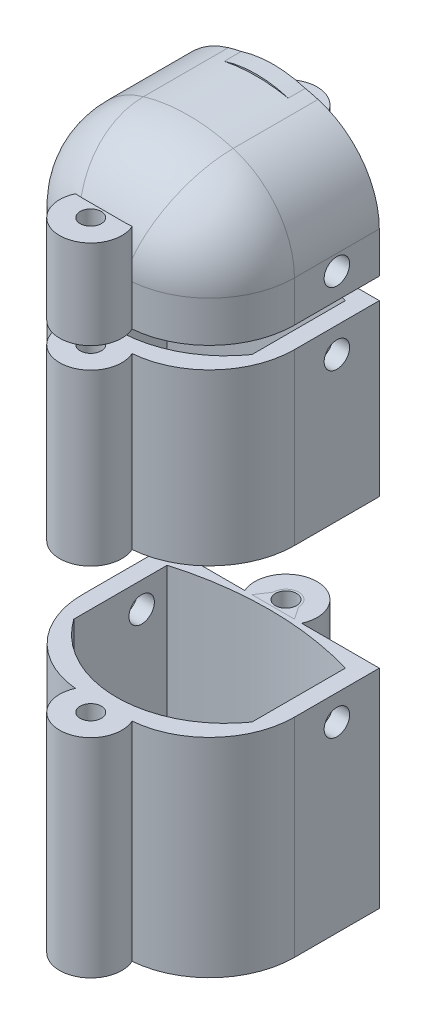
ISO-10303-21;
HEADER;
FILE_DESCRIPTION(('STEP AP214'),'2;1');
FILE_NAME('part.step','',(''),(''),'','','');
FILE_SCHEMA(('AUTOMOTIVE_DESIGN { 1 0 10303 214 1 1 1 1 }'));
ENDSEC;
DATA;
#1=APPLICATION_CONTEXT('core data for automotive mechanical design processes');
#2=APPLICATION_PROTOCOL_DEFINITION('international standard','automotive_design',2000,#1);
#3=PRODUCT_CONTEXT('',#1,'mechanical');
#4=PRODUCT('Part','Part','',(#3));
#5=PRODUCT_RELATED_PRODUCT_CATEGORY('part','',(#4));
#6=PRODUCT_DEFINITION_FORMATION('','',#4);
#7=PRODUCT_DEFINITION_CONTEXT('part definition',#1,'design');
#8=PRODUCT_DEFINITION('design','',#6,#7);
#9=PRODUCT_DEFINITION_SHAPE('','',#8);
#10=(LENGTH_UNIT() NAMED_UNIT(*) SI_UNIT(.MILLI.,.METRE.));
#11=(NAMED_UNIT(*) PLANE_ANGLE_UNIT() SI_UNIT($,.RADIAN.));
#12=(NAMED_UNIT(*) SI_UNIT($,.STERADIAN.) SOLID_ANGLE_UNIT());
#13=UNCERTAINTY_MEASURE_WITH_UNIT(LENGTH_MEASURE(1.E-05),#10,'distance_accuracy_value','');
#14=(GEOMETRIC_REPRESENTATION_CONTEXT(3) GLOBAL_UNCERTAINTY_ASSIGNED_CONTEXT((#13)) GLOBAL_UNIT_ASSIGNED_CONTEXT((#10,
#11,#12)) REPRESENTATION_CONTEXT('',''));
#15=CARTESIAN_POINT('',(0.,0.,0.));
#16=DIRECTION('',(0.,0.,1.));
#17=DIRECTION('',(1.,0.,0.));
#18=AXIS2_PLACEMENT_3D('',#15,#16,#17);
#19=CARTESIAN_POINT('',(-8.66812227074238,42.5,0.));
#20=DIRECTION('',(0.832050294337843,0.,0.55470019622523));
#21=DIRECTION('',(0.55470019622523,0.,-0.832050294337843));
#22=AXIS2_PLACEMENT_3D('',#19,#20,#21);
#23=PLANE('',#22);
#24=DIRECTION('',(-0.55470019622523,0.,0.832050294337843));
#25=VECTOR('',#24,1.);
#26=CARTESIAN_POINT('',(-8.66812227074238,32.023539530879,0.));
#27=LINE('',#26,#25);
#28=CARTESIAN_POINT('',(-7.66812227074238,32.023539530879,-1.5));
#29=VERTEX_POINT('',#28);
#30=CARTESIAN_POINT('',(-8.66812227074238,32.023539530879,0.));
#31=VERTEX_POINT('',#30);
#32=EDGE_CURVE('E63',#29,#31,#27,.T.);
#33=ORIENTED_EDGE('',*,*,#32,.F.);
#34=DIRECTION('',(0.,-1.,0.));
#35=VECTOR('',#34,1.);
#36=CARTESIAN_POINT('',(-7.66812227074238,42.5,-1.5));
#37=LINE('',#36,#35);
#38=CARTESIAN_POINT('',(-7.66812227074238,42.5,-1.5));
#39=VERTEX_POINT('',#38);
#40=EDGE_CURVE('E116',#39,#29,#37,.T.);
#41=ORIENTED_EDGE('',*,*,#40,.F.);
#42=DIRECTION('',(-0.55470019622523,0.,0.832050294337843));
#43=VECTOR('',#42,1.);
#44=CARTESIAN_POINT('',(-8.66812227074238,42.5,0.));
#45=LINE('',#44,#43);
#46=CARTESIAN_POINT('',(-8.66812227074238,42.5,0.));
#47=VERTEX_POINT('',#46);
#48=EDGE_CURVE('E119',#39,#47,#45,.T.);
#49=ORIENTED_EDGE('',*,*,#48,.T.);
#50=DIRECTION('',(0.,-1.,0.));
#51=VECTOR('',#50,1.);
#52=CARTESIAN_POINT('',(-8.66812227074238,42.5,0.));
#53=LINE('',#52,#51);
#54=EDGE_CURVE('E135',#47,#31,#53,.T.);
#55=ORIENTED_EDGE('',*,*,#54,.T.);
#56=EDGE_LOOP('',(#33,#41,#49,#55));
#57=FACE_BOUND('',#56,.T.);
#58=ADVANCED_FACE('F54',(#57),#23,.T.);
#59=CARTESIAN_POINT('',(-6.16812227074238,42.5,-1.5));
#60=DIRECTION('',(0.,-1.,0.));
#61=DIRECTION('',(0.,0.,-1.));
#62=AXIS2_PLACEMENT_3D('',#59,#60,#61);
#63=CYLINDRICAL_SURFACE('',#62,1.5);
#64=CARTESIAN_POINT('',(-6.16812227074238,32.023539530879,-1.5));
#65=DIRECTION('',(0.,1.,0.));
#66=DIRECTION('',(0.,0.,1.));
#67=AXIS2_PLACEMENT_3D('',#64,#65,#66);
#68=CIRCLE('',#67,1.5);
#69=CARTESIAN_POINT('',(-4.66812227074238,32.023539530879,-1.5));
#70=VERTEX_POINT('',#69);
#71=EDGE_CURVE('E92',#70,#29,#68,.T.);
#72=ORIENTED_EDGE('',*,*,#71,.F.);
#73=DIRECTION('',(0.,-1.,0.));
#74=VECTOR('',#73,1.);
#75=CARTESIAN_POINT('',(-4.66812227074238,42.5,-1.5));
#76=LINE('',#75,#74);
#77=CARTESIAN_POINT('',(-4.66812227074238,42.5,-1.5));
#78=VERTEX_POINT('',#77);
#79=EDGE_CURVE('E138',#78,#70,#76,.T.);
#80=ORIENTED_EDGE('',*,*,#79,.F.);
#81=CARTESIAN_POINT('',(-6.16812227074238,42.5,-1.5));
#82=DIRECTION('',(0.,1.,0.));
#83=DIRECTION('',(0.,0.,-1.));
#84=AXIS2_PLACEMENT_3D('',#81,#82,#83);
#85=CIRCLE('',#84,1.5);
#86=EDGE_CURVE('E124',#78,#39,#85,.T.);
#87=ORIENTED_EDGE('',*,*,#86,.T.);
#88=ORIENTED_EDGE('',*,*,#40,.T.);
#89=EDGE_LOOP('',(#72,#80,#87,#88));
#90=FACE_BOUND('',#89,.T.);
#91=ADVANCED_FACE('F137',(#90),#63,.F.);
#92=CARTESIAN_POINT('',(-4.66812227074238,42.5,-1.5));
#93=DIRECTION('',(-0.832050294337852,0.,0.554700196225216));
#94=DIRECTION('',(0.554700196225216,0.,0.832050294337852));
#95=AXIS2_PLACEMENT_3D('',#92,#93,#94);
#96=PLANE('',#95);
#97=DIRECTION('',(-0.554700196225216,0.,-0.832050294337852));
#98=VECTOR('',#97,1.);
#99=CARTESIAN_POINT('',(-4.66812227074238,32.023539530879,-1.5));
#100=LINE('',#99,#98);
#101=CARTESIAN_POINT('',(-3.66812227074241,32.023539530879,0.));
#102=VERTEX_POINT('',#101);
#103=EDGE_CURVE('E96',#102,#70,#100,.T.);
#104=ORIENTED_EDGE('',*,*,#103,.F.);
#105=DIRECTION('',(0.,-1.,0.));
#106=VECTOR('',#105,1.);
#107=CARTESIAN_POINT('',(-3.66812227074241,42.5,0.));
#108=LINE('',#107,#106);
#109=CARTESIAN_POINT('',(-3.66812227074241,42.5,0.));
#110=VERTEX_POINT('',#109);
#111=EDGE_CURVE('E151',#110,#102,#108,.T.);
#112=ORIENTED_EDGE('',*,*,#111,.F.);
#113=DIRECTION('',(-0.554700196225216,0.,-0.832050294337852));
#114=VECTOR('',#113,1.);
#115=CARTESIAN_POINT('',(-4.66812227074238,42.5,-1.5));
#116=LINE('',#115,#114);
#117=EDGE_CURVE('E123',#110,#78,#116,.T.);
#118=ORIENTED_EDGE('',*,*,#117,.T.);
#119=ORIENTED_EDGE('',*,*,#79,.T.);
#120=EDGE_LOOP('',(#104,#112,#118,#119));
#121=FACE_BOUND('',#120,.T.);
#122=ADVANCED_FACE('F306',(#121),#96,.T.);
#123=CARTESIAN_POINT('',(-9.50179501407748,42.5,19.9651888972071));
#124=DIRECTION('',(0.0417199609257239,0.,-0.999129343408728));
#125=DIRECTION('',(-0.999129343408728,0.,-0.0417199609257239));
#126=AXIS2_PLACEMENT_3D('',#123,#124,#125);
#127=PLANE('',#126);
#128=CARTESIAN_POINT('',(-9.50199501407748,37.4480184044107,19.9651805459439));
#129=CARTESIAN_POINT('',(-9.45154070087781,37.439426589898,19.9672873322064));
#130=CARTESIAN_POINT('',(-9.4012601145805,37.4294080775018,19.9693868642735));
#131=CARTESIAN_POINT('',(-9.3004074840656,37.4054697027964,19.9735980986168));
#132=CARTESIAN_POINT('',(-9.2498559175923,37.3914644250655,19.9757089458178));
#133=CARTESIAN_POINT('',(-9.13564209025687,37.3540538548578,19.9804780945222));
#134=CARTESIAN_POINT('',(-9.0724727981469,37.3290970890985,19.9831158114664));
#135=CARTESIAN_POINT('',(-8.95179270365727,37.268444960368,19.9881549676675));
#136=CARTESIAN_POINT('',(-8.89422422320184,37.2328789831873,19.9905588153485));
#137=CARTESIAN_POINT('',(-8.8230406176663,37.1729330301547,19.9935311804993));
#138=CARTESIAN_POINT('',(-8.80406736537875,37.1550030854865,19.9943234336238));
#139=CARTESIAN_POINT('',(-8.76885069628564,37.1166120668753,19.9957939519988));
#140=CARTESIAN_POINT('',(-8.75260501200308,37.0961531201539,19.9964723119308));
#141=CARTESIAN_POINT('',(-8.72363635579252,37.0524977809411,19.9976819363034));
#142=CARTESIAN_POINT('',(-8.7109548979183,37.0292732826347,19.9982114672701));
#143=CARTESIAN_POINT('',(-8.6903193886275,36.9807843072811,19.9990731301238));
#144=CARTESIAN_POINT('',(-8.68236251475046,36.9555210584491,19.9994053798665));
#145=CARTESIAN_POINT('',(-8.67395377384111,36.915445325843,19.9997564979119));
#146=CARTESIAN_POINT('',(-8.67173806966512,36.9009785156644,19.9998490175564));
#147=CARTESIAN_POINT('',(-8.66881692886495,36.8719080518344,19.9999709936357));
#148=CARTESIAN_POINT('',(-8.66810979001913,36.8573045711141,20.000000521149));
#149=CARTESIAN_POINT('',(-8.66812231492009,36.8427020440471,19.9999999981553));
#150=B_SPLINE_CURVE_WITH_KNOTS('',3,(#128,#129,#130,#131,#132,#133,#134,#135,#136,#137,#138,
#139,#140,#141,#142,#143,#144,#145,#146,#147,#148,#149),.UNSPECIFIED.,.F.,.F.,(4,2,2,2,2,2,2,2,
2,2,4),(0.,0.153755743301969,0.311091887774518,0.514476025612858,0.715474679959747,
0.793618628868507,0.871697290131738,0.950650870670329,1.02955723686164,1.0733928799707,
1.11717903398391),.UNSPECIFIED.);
#151=CARTESIAN_POINT('',(-8.73286147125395,37.0662111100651,19.997296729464));
#152=VERTEX_POINT('',#151);
#153=CARTESIAN_POINT('',(-8.66812227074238,36.8429020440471,20.));
#154=VERTEX_POINT('',#153);
#155=EDGE_CURVE('E182',#152,#154,#150,.T.);
#156=ORIENTED_EDGE('',*,*,#155,.F.);
#157=CARTESIAN_POINT('',(-9.08495864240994,36.8429020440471,19.9825944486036));
#158=DIRECTION('',(0.0417199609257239,0.,-0.999129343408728));
#159=DIRECTION('',(-0.999129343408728,0.,-0.0417199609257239));
#160=AXIS2_PLACEMENT_3D('',#157,#158,#159);
#161=CIRCLE('',#160,0.417199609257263);
#162=CARTESIAN_POINT('',(-9.50179501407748,36.8429020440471,19.9651888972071));
#163=VERTEX_POINT('',#162);
#164=EDGE_CURVE('E939',#163,#152,#161,.T.);
#165=ORIENTED_EDGE('',*,*,#164,.F.);
#166=DIRECTION('',(0.,-1.,0.));
#167=VECTOR('',#166,1.);
#168=CARTESIAN_POINT('',(-9.50179501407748,42.5,19.9651888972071));
#169=LINE('',#168,#167);
#170=CARTESIAN_POINT('',(-9.50179501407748,42.5,19.9651888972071));
#171=VERTEX_POINT('',#170);
#172=EDGE_CURVE('E154',#171,#163,#169,.T.);
#173=ORIENTED_EDGE('',*,*,#172,.F.);
#174=DIRECTION('',(0.999129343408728,0.,0.0417199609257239));
#175=VECTOR('',#174,1.);
#176=CARTESIAN_POINT('',(-9.50179501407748,42.5,19.9651888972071));
#177=LINE('',#176,#175);
#178=CARTESIAN_POINT('',(-8.66812227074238,42.5,20.));
#179=VERTEX_POINT('',#178);
#180=EDGE_CURVE('E150',#171,#179,#177,.T.);
#181=ORIENTED_EDGE('',*,*,#180,.T.);
#182=DIRECTION('',(0.,-1.,0.));
#183=VECTOR('',#182,1.);
#184=CARTESIAN_POINT('',(-8.66812227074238,42.5,20.));
#185=LINE('',#184,#183);
#186=EDGE_CURVE('E176',#179,#154,#185,.T.);
#187=ORIENTED_EDGE('',*,*,#186,.T.);
#188=EDGE_LOOP('',(#156,#165,#173,#181,#187));
#189=FACE_BOUND('',#188,.T.);
#190=ADVANCED_FACE('F198',(#189),#127,.T.);
#191=CARTESIAN_POINT('',(-3.66812227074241,42.5,20.));
#192=DIRECTION('',(-0.0417199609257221,0.,-0.999129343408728));
#193=DIRECTION('',(-0.999129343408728,0.,0.0417199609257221));
#194=AXIS2_PLACEMENT_3D('',#191,#192,#193);
#195=PLANE('',#194);
#196=CARTESIAN_POINT('',(-3.25128589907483,36.8429020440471,19.9825944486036));
#197=DIRECTION('',(-0.0417199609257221,0.,-0.999129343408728));
#198=DIRECTION('',(-0.999129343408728,0.,0.0417199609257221));
#199=AXIS2_PLACEMENT_3D('',#196,#197,#198);
#200=CIRCLE('',#199,0.417199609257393);
#201=CARTESIAN_POINT('',(-3.60338307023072,37.0662111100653,19.997296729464));
#202=VERTEX_POINT('',#201);
#203=CARTESIAN_POINT('',(-2.83444952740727,36.8429020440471,19.9651888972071));
#204=VERTEX_POINT('',#203);
#205=EDGE_CURVE('E177',#202,#204,#200,.T.);
#206=ORIENTED_EDGE('',*,*,#205,.F.);
#207=CARTESIAN_POINT('',(-3.6681222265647,36.8427020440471,19.9999999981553));
#208=CARTESIAN_POINT('',(-3.66821335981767,36.8660263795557,20.0000038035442));
#209=CARTESIAN_POINT('',(-3.66634757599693,36.8893798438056,19.9999258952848));
#210=CARTESIAN_POINT('',(-3.65873893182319,36.9353046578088,19.9996081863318));
#211=CARTESIAN_POINT('',(-3.65301831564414,36.9578797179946,19.999369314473));
#212=CARTESIAN_POINT('',(-3.63771985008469,37.001740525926,19.9987305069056));
#213=CARTESIAN_POINT('',(-3.62813320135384,37.0230232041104,19.9983302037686));
#214=CARTESIAN_POINT('',(-3.60566010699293,37.0637502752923,19.9973918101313));
#215=CARTESIAN_POINT('',(-3.59277127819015,37.0831933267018,19.9968536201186));
#216=CARTESIAN_POINT('',(-3.55848136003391,37.1277241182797,19.9954217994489));
#217=CARTESIAN_POINT('',(-3.53576978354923,37.1517947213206,19.9944734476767));
#218=CARTESIAN_POINT('',(-3.48687713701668,37.1961226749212,19.9924318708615));
#219=CARTESIAN_POINT('',(-3.46068479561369,37.2163670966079,19.9913381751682));
#220=CARTESIAN_POINT('',(-3.38520377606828,37.2678274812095,19.9881863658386));
#221=CARTESIAN_POINT('',(-3.33358595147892,37.2955760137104,19.9860309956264));
#222=CARTESIAN_POINT('',(-3.22701060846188,37.3436915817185,19.9815808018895));
#223=CARTESIAN_POINT('',(-3.1720409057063,37.3640295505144,19.9792854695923));
#224=CARTESIAN_POINT('',(-3.0698528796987,37.3961195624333,19.9750184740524));
#225=CARTESIAN_POINT('',(-3.02289985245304,37.4087425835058,19.9730578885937));
#226=CARTESIAN_POINT('',(-2.92876378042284,37.4306458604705,19.9691271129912));
#227=CARTESIAN_POINT('',(-2.8815890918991,37.4399617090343,19.9671572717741));
#228=CARTESIAN_POINT('',(-2.83424952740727,37.4480184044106,19.9651805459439));
#229=B_SPLINE_CURVE_WITH_KNOTS('',3,(#207,#208,#209,#210,#211,#212,#213,#214,#215,#216,#217,
#218,#219,#220,#221,#222,#223,#224,#225,#226,#227,#228),.UNSPECIFIED.,.F.,.F.,(4,2,2,2,2,2,2,2,
2,2,4),(0.,0.0699302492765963,0.139460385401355,0.20914967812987,0.278889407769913,
0.37764477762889,0.476728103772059,0.651675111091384,0.827301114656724,0.97316074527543,
1.11739927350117),.UNSPECIFIED.);
#230=CARTESIAN_POINT('',(-3.66812227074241,36.8429020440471,20.));
#231=VERTEX_POINT('',#230);
#232=EDGE_CURVE('E191',#231,#202,#229,.T.);
#233=ORIENTED_EDGE('',*,*,#232,.F.);
#234=DIRECTION('',(0.,-1.,0.));
#235=VECTOR('',#234,1.);
#236=CARTESIAN_POINT('',(-3.66812227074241,42.5,20.));
#237=LINE('',#236,#235);
#238=CARTESIAN_POINT('',(-3.66812227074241,42.5,20.));
#239=VERTEX_POINT('',#238);
#240=EDGE_CURVE('E546',#239,#231,#237,.T.);
#241=ORIENTED_EDGE('',*,*,#240,.F.);
#242=DIRECTION('',(0.999129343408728,0.,-0.0417199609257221));
#243=VECTOR('',#242,1.);
#244=CARTESIAN_POINT('',(-3.66812227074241,42.5,20.));
#245=LINE('',#244,#243);
#246=CARTESIAN_POINT('',(-2.83444952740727,42.5,19.9651888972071));
#247=VERTEX_POINT('',#246);
#248=EDGE_CURVE('E169',#239,#247,#245,.T.);
#249=ORIENTED_EDGE('',*,*,#248,.T.);
#250=DIRECTION('',(0.,-1.,0.));
#251=VECTOR('',#250,1.);
#252=CARTESIAN_POINT('',(-2.83444952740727,42.5,19.9651888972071));
#253=LINE('',#252,#251);
#254=EDGE_CURVE('E57',#247,#204,#253,.T.);
#255=ORIENTED_EDGE('',*,*,#254,.T.);
#256=EDGE_LOOP('',(#206,#233,#241,#249,#255));
#257=FACE_BOUND('',#256,.T.);
#258=ADVANCED_FACE('F298',(#257),#195,.T.);
#259=CARTESIAN_POINT('',(-6.16812227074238,42.5,21.5));
#260=DIRECTION('',(0.,-1.,0.));
#261=DIRECTION('',(0.,0.,-1.));
#262=AXIS2_PLACEMENT_3D('',#259,#260,#261);
#263=CYLINDRICAL_SURFACE('',#262,3.67001622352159);
#264=CARTESIAN_POINT('',(-9.50179501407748,32.023539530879,19.9651888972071));
#265=VERTEX_POINT('',#264);
#266=EDGE_CURVE('E156',#163,#265,#169,.T.);
#267=ORIENTED_EDGE('',*,*,#266,.T.);
#268=CARTESIAN_POINT('',(-6.16812227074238,32.023539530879,21.5));
#269=DIRECTION('',(0.,1.,0.));
#270=DIRECTION('',(0.,0.,1.));
#271=AXIS2_PLACEMENT_3D('',#268,#269,#270);
#272=CIRCLE('',#271,3.67001622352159);
#273=CARTESIAN_POINT('',(-2.83444952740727,32.023539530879,19.9651888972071));
#274=VERTEX_POINT('',#273);
#275=EDGE_CURVE('E12',#274,#265,#272,.F.);
#276=ORIENTED_EDGE('',*,*,#275,.F.);
#277=EDGE_CURVE('E170',#204,#274,#253,.T.);
#278=ORIENTED_EDGE('',*,*,#277,.F.);
#279=ORIENTED_EDGE('',*,*,#254,.F.);
#280=CARTESIAN_POINT('',(-6.16812227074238,42.5,21.5));
#281=DIRECTION('',(0.,-1.,0.));
#282=DIRECTION('',(0.,0.,-1.));
#283=AXIS2_PLACEMENT_3D('',#280,#281,#282);
#284=CIRCLE('',#283,3.67001622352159);
#285=EDGE_CURVE('E157',#247,#171,#284,.T.);
#286=ORIENTED_EDGE('',*,*,#285,.T.);
#287=ORIENTED_EDGE('',*,*,#172,.T.);
#288=EDGE_LOOP('',(#267,#276,#278,#279,#286,#287));
#289=FACE_BOUND('',#288,.T.);
#290=ADVANCED_FACE('F290',(#289),#263,.T.);
#291=CARTESIAN_POINT('',(-6.16812227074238,42.5,21.5));
#292=DIRECTION('',(0.,1.,0.));
#293=DIRECTION('',(0.,0.,1.));
#294=AXIS2_PLACEMENT_3D('',#291,#292,#293);
#295=PLANE('',#294);
#296=ORIENTED_EDGE('',*,*,#248,.F.);
#297=DIRECTION('',(1.,0.,0.));
#298=VECTOR('',#297,1.);
#299=CARTESIAN_POINT('',(-3.66812227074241,42.5,20.));
#300=LINE('',#299,#298);
#301=EDGE_CURVE('E510',#179,#239,#300,.T.);
#302=ORIENTED_EDGE('',*,*,#301,.F.);
#303=ORIENTED_EDGE('',*,*,#180,.F.);
#304=ORIENTED_EDGE('',*,*,#285,.F.);
#305=EDGE_LOOP('',(#296,#302,#303,#304));
#306=FACE_BOUND('',#305,.T.);
#307=CARTESIAN_POINT('',(-6.16812227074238,42.5,21.5));
#308=DIRECTION('',(0.,-1.,0.));
#309=DIRECTION('',(0.,0.,-1.));
#310=AXIS2_PLACEMENT_3D('',#307,#308,#309);
#311=CIRCLE('',#310,1.25);
#312=CARTESIAN_POINT('',(-6.16812227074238,42.5,20.25));
#313=VERTEX_POINT('',#312);
#314=EDGE_CURVE('E163',#313,#313,#311,.T.);
#315=ORIENTED_EDGE('',*,*,#314,.T.);
#316=EDGE_LOOP('',(#315));
#317=FACE_BOUND('',#316,.T.);
#318=ADVANCED_FACE('F288',(#306,#317),#295,.T.);
#319=CARTESIAN_POINT('',(-6.16812227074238,35.,13.));
#320=DIRECTION('',(0.,0.,-1.));
#321=DIRECTION('',(-1.,0.,0.));
#322=AXIS2_PLACEMENT_3D('',#319,#320,#321);
#323=CYLINDRICAL_SURFACE('',#322,10.7935165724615);
#324=CARTESIAN_POINT('',(-16.9616131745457,35.023539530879,3.50000000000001));
#325=CARTESIAN_POINT('',(-16.9617946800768,34.9397326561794,3.50000350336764));
#326=CARTESIAN_POINT('',(-16.9609924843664,34.8558733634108,3.507047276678));
#327=CARTESIAN_POINT('',(-16.9575182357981,34.6904895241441,3.53503397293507));
#328=CARTESIAN_POINT('',(-16.9548443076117,34.6089674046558,3.55599083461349));
#329=CARTESIAN_POINT('',(-16.9479421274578,34.4506758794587,3.61117126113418));
#330=CARTESIAN_POINT('',(-16.9437149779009,34.3739031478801,3.64538541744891));
#331=CARTESIAN_POINT('',(-16.9341889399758,34.2272003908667,3.72608746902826));
#332=CARTESIAN_POINT('',(-16.9288902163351,34.1572693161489,3.77257347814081));
#333=CARTESIAN_POINT('',(-16.9177846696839,34.0257588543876,3.87682776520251));
#334=CARTESIAN_POINT('',(-16.9119750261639,33.9642313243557,3.9346611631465));
#335=CARTESIAN_POINT('',(-16.9005339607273,33.8517207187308,4.05982837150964));
#336=CARTESIAN_POINT('',(-16.8949025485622,33.800738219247,4.12716270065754));
#337=CARTESIAN_POINT('',(-16.8844376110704,33.7105572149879,4.26977725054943));
#338=CARTESIAN_POINT('',(-16.8796076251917,33.6714103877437,4.34509043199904));
#339=CARTESIAN_POINT('',(-16.8713364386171,33.6063397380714,4.501299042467));
#340=CARTESIAN_POINT('',(-16.867895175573,33.580415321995,4.58219422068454));
#341=CARTESIAN_POINT('',(-16.8628212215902,33.5426811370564,4.74674243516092));
#342=CARTESIAN_POINT('',(-16.8611775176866,33.5307853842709,4.83037540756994));
#343=CARTESIAN_POINT('',(-16.8598535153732,33.5211802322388,4.99846545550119));
#344=CARTESIAN_POINT('',(-16.8601731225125,33.5234701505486,5.08292249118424));
#345=CARTESIAN_POINT('',(-16.862728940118,33.5420997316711,5.24964831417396));
#346=CARTESIAN_POINT('',(-16.8649519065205,33.5583423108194,5.33192818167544));
#347=CARTESIAN_POINT('',(-16.8710402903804,33.6042644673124,5.49258357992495));
#348=CARTESIAN_POINT('',(-16.8749057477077,33.6339443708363,5.57095901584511));
#349=CARTESIAN_POINT('',(-16.8838529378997,33.7060015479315,5.72187903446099));
#350=CARTESIAN_POINT('',(-16.8889386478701,33.7484204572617,5.79440349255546));
#351=CARTESIAN_POINT('',(-16.8997425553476,33.8447224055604,5.93134189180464));
#352=CARTESIAN_POINT('',(-16.9054607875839,33.8986060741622,5.99575538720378));
#353=CARTESIAN_POINT('',(-16.9169336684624,34.0168407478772,6.11520279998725));
#354=CARTESIAN_POINT('',(-16.9226882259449,34.081274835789,6.17015452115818));
#355=CARTESIAN_POINT('',(-16.9335289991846,34.2184970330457,6.26847574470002));
#356=CARTESIAN_POINT('',(-16.9386152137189,34.2912851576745,6.31184522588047));
#357=CARTESIAN_POINT('',(-16.9475359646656,34.4432015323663,6.38576506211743));
#358=CARTESIAN_POINT('',(-16.9513701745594,34.5223314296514,6.4163120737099));
#359=CARTESIAN_POINT('',(-16.9573369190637,34.6846619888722,6.46366294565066));
#360=CARTESIAN_POINT('',(-16.9594695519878,34.7678624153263,6.48046760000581));
#361=CARTESIAN_POINT('',(-16.9617664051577,34.93524354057,6.4997476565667));
#362=CARTESIAN_POINT('',(-16.9619465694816,35.019410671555,6.50233903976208));
#363=CARTESIAN_POINT('',(-16.9603445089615,35.1869746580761,6.49342822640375));
#364=CARTESIAN_POINT('',(-16.9585623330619,35.2703715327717,6.48192638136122));
#365=CARTESIAN_POINT('',(-16.9532304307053,35.4337015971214,6.44524954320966));
#366=CARTESIAN_POINT('',(-16.9496875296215,35.5136468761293,6.42012731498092));
#367=CARTESIAN_POINT('',(-16.9412146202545,35.6681887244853,6.35698046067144));
#368=CARTESIAN_POINT('',(-16.9362845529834,35.7427850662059,6.31895528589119));
#369=CARTESIAN_POINT('',(-16.9255299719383,35.8850469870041,6.23079377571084));
#370=CARTESIAN_POINT('',(-16.9196998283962,35.9526641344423,6.18057998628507));
#371=CARTESIAN_POINT('',(-16.9078024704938,36.0785522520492,6.06957535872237));
#372=CARTESIAN_POINT('',(-16.9017352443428,36.1368227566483,6.00878399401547));
#373=CARTESIAN_POINT('',(-16.8899859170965,36.2427829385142,5.8778319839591));
#374=CARTESIAN_POINT('',(-16.8843068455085,36.2903948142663,5.80760807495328));
#375=CARTESIAN_POINT('',(-16.8740186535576,36.3731455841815,5.66008742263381));
#376=CARTESIAN_POINT('',(-16.8694095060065,36.4082847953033,5.58279085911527));
#377=CARTESIAN_POINT('',(-16.8617984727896,36.4649606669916,5.42358062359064));
#378=CARTESIAN_POINT('',(-16.8587911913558,36.4865430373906,5.34168349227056));
#379=CARTESIAN_POINT('',(-16.8547051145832,36.5156406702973,5.1753818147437));
#380=CARTESIAN_POINT('',(-16.8536262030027,36.5231567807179,5.09097741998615));
#381=CARTESIAN_POINT('',(-16.8535215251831,36.5238904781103,4.92285609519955));
#382=CARTESIAN_POINT('',(-16.8544776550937,36.5172341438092,4.83913969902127));
#383=CARTESIAN_POINT('',(-16.8582974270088,36.4900806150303,4.6740291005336));
#384=CARTESIAN_POINT('',(-16.861161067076,36.4695834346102,4.59263489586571));
#385=CARTESIAN_POINT('',(-16.8684710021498,36.4153723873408,4.4345056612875));
#386=CARTESIAN_POINT('',(-16.8729163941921,36.3816660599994,4.35776800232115));
#387=CARTESIAN_POINT('',(-16.8828963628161,36.3020063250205,4.21101725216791));
#388=CARTESIAN_POINT('',(-16.8884309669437,36.2560526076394,4.14100433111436));
#389=CARTESIAN_POINT('',(-16.9000328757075,36.1527410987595,4.00904852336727));
#390=CARTESIAN_POINT('',(-16.9061043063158,36.0952897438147,3.94717924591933));
#391=CARTESIAN_POINT('',(-16.918072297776,35.9708118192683,3.83391378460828));
#392=CARTESIAN_POINT('',(-16.9239688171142,35.9037829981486,3.78252007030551));
#393=CARTESIAN_POINT('',(-16.9349680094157,35.7616649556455,3.69143908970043));
#394=CARTESIAN_POINT('',(-16.9400665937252,35.6865373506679,3.65181123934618));
#395=CARTESIAN_POINT('',(-16.9488675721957,35.5306602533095,3.58579439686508));
#396=CARTESIAN_POINT('',(-16.9525714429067,35.4499168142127,3.55939139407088));
#397=CARTESIAN_POINT('',(-16.9572981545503,35.3112450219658,3.52671152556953));
#398=CARTESIAN_POINT('',(-16.9587984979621,35.2541824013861,3.5167097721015));
#399=CARTESIAN_POINT('',(-16.9608933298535,35.1392680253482,3.50335283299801));
#400=CARTESIAN_POINT('',(-16.961487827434,35.0814162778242,3.49999758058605));
#401=CARTESIAN_POINT('',(-16.9616131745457,35.023539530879,3.50000000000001));
#402=B_SPLINE_CURVE_WITH_KNOTS('',3,(#324,#325,#326,#327,#328,#329,#330,#331,#332,#333,#334,
#335,#336,#337,#338,#339,#340,#341,#342,#343,#344,#345,#346,#347,#348,#349,#350,#351,#352,#353,
#354,#355,#356,#357,#358,#359,#360,#361,#362,#363,#364,#365,#366,#367,#368,#369,#370,#371,#372,
#373,#374,#375,#376,#377,#378,#379,#380,#381,#382,#383,#384,#385,#386,#387,#388,#389,#390,#391,
#392,#393,#394,#395,#396,#397,#398,#399,#400,#401),.UNSPECIFIED.,.T.,.F.,(4,2,2,2,2,2,2,2,2,2,2,
2,2,2,2,2,2,2,2,2,2,2,2,2,2,2,2,2,2,2,2,2,2,2,2,2,2,2,4),(0.,0.251209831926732,
0.502671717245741,0.753955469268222,1.00520062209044,1.25793216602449,1.51067751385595,
1.76451098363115,2.0183330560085,2.27059119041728,2.5228371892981,2.77334212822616,
3.02385314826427,3.27519200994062,3.52654467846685,3.77998136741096,4.03341852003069,
4.28692171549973,4.54041026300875,4.79182721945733,5.04323790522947,5.29368152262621,
5.54413579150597,5.79622530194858,6.04832736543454,6.30221361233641,6.55609340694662,
6.80911252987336,7.06211640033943,7.31287894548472,7.56364123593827,7.81426060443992,
8.0648863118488,8.31764113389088,8.57045547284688,8.82452558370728,9.0783259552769,
9.25181236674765,9.42529703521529),.UNSPECIFIED.);
#403=CARTESIAN_POINT('',(-16.9616131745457,35.023539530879,3.50000000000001));
#404=VERTEX_POINT('',#403);
#405=EDGE_CURVE('E263',#404,#404,#402,.T.);
#406=ORIENTED_EDGE('',*,*,#405,.T.);
#407=EDGE_LOOP('',(#406));
#408=FACE_BOUND('',#407,.T.);
#409=CARTESIAN_POINT('',(-6.16812227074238,35.,2.));
#410=DIRECTION('',(0.,0.,1.));
#411=DIRECTION('',(1.,0.,0.));
#412=AXIS2_PLACEMENT_3D('',#409,#410,#411);
#413=CIRCLE('',#412,10.7935165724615);
#414=CARTESIAN_POINT('',(-16.6681222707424,32.5,2.));
#415=VERTEX_POINT('',#414);
#416=CARTESIAN_POINT('',(-16.6681222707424,37.5,2.));
#417=VERTEX_POINT('',#416);
#418=EDGE_CURVE('E270',#415,#417,#413,.F.);
#419=ORIENTED_EDGE('',*,*,#418,.T.);
#420=DIRECTION('',(0.,0.,-1.));
#421=VECTOR('',#420,1.);
#422=CARTESIAN_POINT('',(-16.6681222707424,37.5,13.));
#423=LINE('',#422,#421);
#424=CARTESIAN_POINT('',(-16.6681222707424,37.5,13.));
#425=VERTEX_POINT('',#424);
#426=EDGE_CURVE('E398',#417,#425,#423,.F.);
#427=ORIENTED_EDGE('',*,*,#426,.T.);
#428=CARTESIAN_POINT('',(-6.16812227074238,35.,13.));
#429=DIRECTION('',(0.,0.,-1.));
#430=DIRECTION('',(1.,0.,0.));
#431=AXIS2_PLACEMENT_3D('',#428,#429,#430);
#432=CIRCLE('',#431,10.7935165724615);
#433=CARTESIAN_POINT('',(-16.6681222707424,32.5,13.));
#434=VERTEX_POINT('',#433);
#435=EDGE_CURVE('E667',#434,#425,#432,.T.);
#436=ORIENTED_EDGE('',*,*,#435,.F.);
#437=DIRECTION('',(0.,0.,-1.));
#438=VECTOR('',#437,1.);
#439=CARTESIAN_POINT('',(-16.6681222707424,32.5,13.));
#440=LINE('',#439,#438);
#441=EDGE_CURVE('E401',#434,#415,#440,.T.);
#442=ORIENTED_EDGE('',*,*,#441,.T.);
#443=EDGE_LOOP('',(#419,#427,#436,#442));
#444=FACE_BOUND('',#443,.T.);
#445=ADVANCED_FACE('F280',(#408,#444),#323,.F.);
#446=CARTESIAN_POINT('',(-6.16812227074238,34.7132673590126,2.));
#447=DIRECTION('',(0.,0.,1.));
#448=DIRECTION('',(1.,0.,0.));
#449=AXIS2_PLACEMENT_3D('',#446,#447,#448);
#450=PLANE('',#449);
#451=DIRECTION('',(0.,-1.,0.));
#452=VECTOR('',#451,1.);
#453=CARTESIAN_POINT('',(-16.6681222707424,42.023539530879,2.));
#454=LINE('',#453,#452);
#455=EDGE_CURVE('E407',#417,#415,#454,.T.);
#456=ORIENTED_EDGE('',*,*,#455,.F.);
#457=ORIENTED_EDGE('',*,*,#418,.F.);
#458=EDGE_LOOP('',(#456,#457));
#459=FACE_BOUND('',#458,.T.);
#460=ADVANCED_FACE('F296',(#459),#450,.T.);
#461=CARTESIAN_POINT('',(-6.16812227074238,35.,13.));
#462=DIRECTION('',(0.,0.,1.));
#463=DIRECTION('',(1.,0.,0.));
#464=AXIS2_PLACEMENT_3D('',#461,#462,#463);
#465=PLANE('',#464);
#466=ORIENTED_EDGE('',*,*,#435,.T.);
#467=DIRECTION('',(0.,-1.,0.));
#468=VECTOR('',#467,1.);
#469=CARTESIAN_POINT('',(-16.6681222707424,40.5,13.));
#470=LINE('',#469,#468);
#471=EDGE_CURVE('E390',#425,#434,#470,.T.);
#472=ORIENTED_EDGE('',*,*,#471,.T.);
#473=EDGE_LOOP('',(#466,#472));
#474=FACE_BOUND('',#473,.T.);
#475=ADVANCED_FACE('F285',(#474),#465,.F.);
#476=CARTESIAN_POINT('',(-6.16812227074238,42.5,21.5));
#477=DIRECTION('',(0.,-1.,0.));
#478=DIRECTION('',(0.,0.,-1.));
#479=AXIS2_PLACEMENT_3D('',#476,#477,#478);
#480=CYLINDRICAL_SURFACE('',#479,1.25);
#481=CARTESIAN_POINT('',(-6.16812227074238,32.023539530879,21.5));
#482=DIRECTION('',(0.,1.,0.));
#483=DIRECTION('',(0.,0.,1.));
#484=AXIS2_PLACEMENT_3D('',#481,#482,#483);
#485=CIRCLE('',#484,1.25);
#486=CARTESIAN_POINT('',(-6.16812227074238,32.023539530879,22.75));
#487=VERTEX_POINT('',#486);
#488=EDGE_CURVE('E511',#487,#487,#485,.F.);
#489=ORIENTED_EDGE('',*,*,#488,.T.);
#490=EDGE_LOOP('',(#489));
#491=FACE_BOUND('',#490,.T.);
#492=ORIENTED_EDGE('',*,*,#314,.F.);
#493=EDGE_LOOP('',(#492));
#494=FACE_BOUND('',#493,.T.);
#495=ADVANCED_FACE('F253',(#491,#494),#480,.F.);
#496=CARTESIAN_POINT('',(-3.66812227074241,42.5,20.));
#497=DIRECTION('',(0.,0.,-1.));
#498=DIRECTION('',(-1.,0.,0.));
#499=AXIS2_PLACEMENT_3D('',#496,#497,#498);
#500=PLANE('',#499);
#501=CARTESIAN_POINT('',(-6.16812227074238,28.2194921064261,20.));
#502=DIRECTION('',(0.,0.,-1.));
#503=DIRECTION('',(-1.,0.,0.));
#504=AXIS2_PLACEMENT_3D('',#501,#502,#503);
#505=CIRCLE('',#504,8.97848533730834);
#506=EDGE_CURVE('E507',#231,#154,#505,.F.);
#507=ORIENTED_EDGE('',*,*,#506,.T.);
#508=ORIENTED_EDGE('',*,*,#186,.F.);
#509=ORIENTED_EDGE('',*,*,#301,.T.);
#510=ORIENTED_EDGE('',*,*,#240,.T.);
#511=EDGE_LOOP('',(#507,#508,#509,#510));
#512=FACE_BOUND('',#511,.T.);
#513=ADVANCED_FACE('F249',(#512),#500,.T.);
#514=CARTESIAN_POINT('',(-18.6681222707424,-47.5,20.));
#515=DIRECTION('',(1.,0.,0.));
#516=DIRECTION('',(0.,0.,-1.));
#517=AXIS2_PLACEMENT_3D('',#514,#515,#516);
#518=PLANE('',#517);
#519=CARTESIAN_POINT('',(-18.6681222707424,35.023539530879,5.00000000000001));
#520=DIRECTION('',(1.,0.,0.));
#521=DIRECTION('',(0.,0.,-1.));
#522=AXIS2_PLACEMENT_3D('',#519,#520,#521);
#523=CIRCLE('',#522,1.5);
#524=CARTESIAN_POINT('',(-18.6681222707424,35.023539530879,3.50000000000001));
#525=VERTEX_POINT('',#524);
#526=EDGE_CURVE('E523',#525,#525,#523,.T.);
#527=ORIENTED_EDGE('',*,*,#526,.T.);
#528=EDGE_LOOP('',(#527));
#529=FACE_BOUND('',#528,.T.);
#530=DIRECTION('',(0.,0.,-1.));
#531=VECTOR('',#530,1.);
#532=CARTESIAN_POINT('',(-18.6681222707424,36.8429020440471,20.));
#533=LINE('',#532,#531);
#534=CARTESIAN_POINT('',(-18.6681222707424,36.8429020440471,10.));
#535=VERTEX_POINT('',#534);
#536=CARTESIAN_POINT('',(-18.6681222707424,36.842902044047,0.));
#537=VERTEX_POINT('',#536);
#538=EDGE_CURVE('E520',#535,#537,#533,.T.);
#539=ORIENTED_EDGE('',*,*,#538,.T.);
#540=DIRECTION('',(0.,-1.,0.));
#541=VECTOR('',#540,1.);
#542=CARTESIAN_POINT('',(-18.6681222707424,-47.5,0.));
#543=LINE('',#542,#541);
#544=CARTESIAN_POINT('',(-18.6681222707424,32.023539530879,0.));
#545=VERTEX_POINT('',#544);
#546=EDGE_CURVE('E522',#537,#545,#543,.T.);
#547=ORIENTED_EDGE('',*,*,#546,.T.);
#548=DIRECTION('',(0.,0.,1.));
#549=VECTOR('',#548,1.);
#550=CARTESIAN_POINT('',(-18.6681222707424,32.023539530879,0.));
#551=LINE('',#550,#549);
#552=CARTESIAN_POINT('',(-18.6681222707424,32.023539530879,10.));
#553=VERTEX_POINT('',#552);
#554=EDGE_CURVE('E529',#545,#553,#551,.T.);
#555=ORIENTED_EDGE('',*,*,#554,.T.);
#556=DIRECTION('',(0.,-1.,0.));
#557=VECTOR('',#556,1.);
#558=CARTESIAN_POINT('',(-18.6681222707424,-47.5,10.));
#559=LINE('',#558,#557);
#560=EDGE_CURVE('E531',#553,#535,#559,.F.);
#561=ORIENTED_EDGE('',*,*,#560,.T.);
#562=EDGE_LOOP('',(#539,#547,#555,#561));
#563=FACE_BOUND('',#562,.T.);
#564=ADVANCED_FACE('F245',(#529,#563),#518,.F.);
#565=CARTESIAN_POINT('',(6.33187772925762,-47.5,20.));
#566=DIRECTION('',(-1.,0.,0.));
#567=DIRECTION('',(0.,0.,1.));
#568=AXIS2_PLACEMENT_3D('',#565,#566,#567);
#569=PLANE('',#568);
#570=CARTESIAN_POINT('',(6.33187772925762,35.023539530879,5.00000000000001));
#571=DIRECTION('',(1.,0.,0.));
#572=DIRECTION('',(0.,0.,-1.));
#573=AXIS2_PLACEMENT_3D('',#570,#571,#572);
#574=CIRCLE('',#573,1.5);
#575=CARTESIAN_POINT('',(6.33187772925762,35.023539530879,3.50000000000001));
#576=VERTEX_POINT('',#575);
#577=EDGE_CURVE('E551',#576,#576,#574,.T.);
#578=ORIENTED_EDGE('',*,*,#577,.F.);
#579=EDGE_LOOP('',(#578));
#580=FACE_BOUND('',#579,.T.);
#581=DIRECTION('',(0.,1.,0.));
#582=VECTOR('',#581,1.);
#583=CARTESIAN_POINT('',(6.33187772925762,-47.5,10.));
#584=LINE('',#583,#582);
#585=CARTESIAN_POINT('',(6.33187772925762,36.8429020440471,10.));
#586=VERTEX_POINT('',#585);
#587=CARTESIAN_POINT('',(6.33187772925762,32.023539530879,10.));
#588=VERTEX_POINT('',#587);
#589=EDGE_CURVE('E536',#586,#588,#584,.F.);
#590=ORIENTED_EDGE('',*,*,#589,.T.);
#591=DIRECTION('',(0.,0.,1.));
#592=VECTOR('',#591,1.);
#593=CARTESIAN_POINT('',(6.33187772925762,32.023539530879,0.));
#594=LINE('',#593,#592);
#595=CARTESIAN_POINT('',(6.33187772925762,32.023539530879,0.));
#596=VERTEX_POINT('',#595);
#597=EDGE_CURVE('E528',#596,#588,#594,.T.);
#598=ORIENTED_EDGE('',*,*,#597,.F.);
#599=DIRECTION('',(0.,1.,0.));
#600=VECTOR('',#599,1.);
#601=CARTESIAN_POINT('',(6.33187772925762,-47.5,0.));
#602=LINE('',#601,#600);
#603=CARTESIAN_POINT('',(6.33187772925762,36.842902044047,0.));
#604=VERTEX_POINT('',#603);
#605=EDGE_CURVE('E463',#596,#604,#602,.T.);
#606=ORIENTED_EDGE('',*,*,#605,.T.);
#607=DIRECTION('',(0.,0.,-1.));
#608=VECTOR('',#607,1.);
#609=CARTESIAN_POINT('',(6.33187772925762,36.8429020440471,20.));
#610=LINE('',#609,#608);
#611=EDGE_CURVE('E475',#604,#586,#610,.F.);
#612=ORIENTED_EDGE('',*,*,#611,.T.);
#613=EDGE_LOOP('',(#590,#598,#606,#612));
#614=FACE_BOUND('',#613,.T.);
#615=ADVANCED_FACE('F241',(#580,#614),#569,.F.);
#616=CARTESIAN_POINT('',(-6.16812227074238,28.2194921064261,0.));
#617=DIRECTION('',(0.,0.,-1.));
#618=DIRECTION('',(-1.,0.,0.));
#619=AXIS2_PLACEMENT_3D('',#616,#617,#618);
#620=PLANE('',#619);
#621=DIRECTION('',(0.,-1.,0.));
#622=VECTOR('',#621,1.);
#623=CARTESIAN_POINT('',(-9.51760269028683,42.5,0.));
#624=LINE('',#623,#622);
#625=CARTESIAN_POINT('',(-9.51760269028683,32.023539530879,0.));
#626=VERTEX_POINT('',#625);
#627=CARTESIAN_POINT('',(-9.51760269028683,42.5,0.));
#628=VERTEX_POINT('',#627);
#629=EDGE_CURVE('E395',#626,#628,#624,.F.);
#630=ORIENTED_EDGE('',*,*,#629,.F.);
#631=DIRECTION('',(-1.,0.,0.));
#632=VECTOR('',#631,1.);
#633=CARTESIAN_POINT('',(-18.6681222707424,32.023539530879,0.));
#634=LINE('',#633,#632);
#635=EDGE_CURVE('E468',#626,#545,#634,.T.);
#636=ORIENTED_EDGE('',*,*,#635,.T.);
#637=ORIENTED_EDGE('',*,*,#546,.F.);
#638=CARTESIAN_POINT('',(-8.66812227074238,36.8429020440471,0.));
#639=DIRECTION('',(0.,0.,-1.));
#640=DIRECTION('',(-1.,0.,0.));
#641=AXIS2_PLACEMENT_3D('',#638,#639,#640);
#642=CIRCLE('',#641,10.);
#643=CARTESIAN_POINT('',(-11.4525562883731,46.4474284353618,0.));
#644=VERTEX_POINT('',#643);
#645=EDGE_CURVE('E474',#537,#644,#642,.T.);
#646=ORIENTED_EDGE('',*,*,#645,.T.);
#647=CARTESIAN_POINT('',(-6.16812227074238,28.2194921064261,0.));
#648=DIRECTION('',(0.,0.,1.));
#649=DIRECTION('',(-1.,0.,0.));
#650=AXIS2_PLACEMENT_3D('',#647,#648,#649);
#651=CIRCLE('',#650,18.9784853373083);
#652=CARTESIAN_POINT('',(-9.94011755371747,46.8193565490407,0.));
#653=VERTEX_POINT('',#652);
#654=EDGE_CURVE('E492',#653,#644,#651,.T.);
#655=ORIENTED_EDGE('',*,*,#654,.F.);
#656=CARTESIAN_POINT('',(-6.16812227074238,34.7132673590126,0.));
#657=DIRECTION('',(0.,0.,-1.));
#658=DIRECTION('',(1.,0.,0.));
#659=AXIS2_PLACEMENT_3D('',#656,#657,#658);
#660=CIRCLE('',#659,12.6801160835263);
#661=CARTESIAN_POINT('',(-2.39612698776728,46.8193565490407,0.));
#662=VERTEX_POINT('',#661);
#663=EDGE_CURVE('E469',#653,#662,#660,.T.);
#664=ORIENTED_EDGE('',*,*,#663,.T.);
#665=CARTESIAN_POINT('',(-0.883688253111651,46.4474284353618,0.));
#666=VERTEX_POINT('',#665);
#667=EDGE_CURVE('E483',#666,#662,#651,.T.);
#668=ORIENTED_EDGE('',*,*,#667,.F.);
#669=CARTESIAN_POINT('',(-3.66812227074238,36.8429020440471,0.));
#670=DIRECTION('',(0.,0.,-1.));
#671=DIRECTION('',(-1.,0.,0.));
#672=AXIS2_PLACEMENT_3D('',#669,#670,#671);
#673=CIRCLE('',#672,10.);
#674=EDGE_CURVE('E466',#666,#604,#673,.T.);
#675=ORIENTED_EDGE('',*,*,#674,.T.);
#676=ORIENTED_EDGE('',*,*,#605,.F.);
#677=CARTESIAN_POINT('',(-2.81864185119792,32.023539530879,0.));
#678=VERTEX_POINT('',#677);
#679=EDGE_CURVE('E153',#596,#678,#634,.T.);
#680=ORIENTED_EDGE('',*,*,#679,.T.);
#681=DIRECTION('',(0.,-1.,0.));
#682=VECTOR('',#681,1.);
#683=CARTESIAN_POINT('',(-2.81864185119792,42.5,0.));
#684=LINE('',#683,#682);
#685=CARTESIAN_POINT('',(-2.81864185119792,42.5,0.));
#686=VERTEX_POINT('',#685);
#687=EDGE_CURVE('E447',#686,#678,#684,.T.);
#688=ORIENTED_EDGE('',*,*,#687,.F.);
#689=DIRECTION('',(1.,0.,0.));
#690=VECTOR('',#689,1.);
#691=CARTESIAN_POINT('',(-6.16812227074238,42.5,0.));
#692=LINE('',#691,#690);
#693=EDGE_CURVE('E146',#110,#686,#692,.T.);
#694=ORIENTED_EDGE('',*,*,#693,.F.);
#695=ORIENTED_EDGE('',*,*,#111,.T.);
#696=EDGE_CURVE('E152',#102,#31,#634,.T.);
#697=ORIENTED_EDGE('',*,*,#696,.T.);
#698=ORIENTED_EDGE('',*,*,#54,.F.);
#699=EDGE_CURVE('E134',#628,#47,#692,.T.);
#700=ORIENTED_EDGE('',*,*,#699,.F.);
#701=EDGE_LOOP('',(#630,#636,#637,#646,#655,#664,#668,#675,#676,#680,#688,#694,#695,#697,#698,#700));
#702=FACE_BOUND('',#701,.T.);
#703=ADVANCED_FACE('F237',(#702),#620,.T.);
#704=CARTESIAN_POINT('',(-3.66812227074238,28.2194921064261,10.));
#705=DIRECTION('',(0.,1.,0.));
#706=DIRECTION('',(0.,0.,1.));
#707=AXIS2_PLACEMENT_3D('',#704,#705,#706);
#708=CYLINDRICAL_SURFACE('',#707,10.);
#709=CARTESIAN_POINT('',(-3.66812227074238,36.8429020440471,10.));
#710=DIRECTION('',(0.,1.,0.));
#711=DIRECTION('',(0.,0.,1.));
#712=AXIS2_PLACEMENT_3D('',#709,#710,#711);
#713=CIRCLE('',#712,10.);
#714=EDGE_CURVE('E180',#204,#586,#713,.T.);
#715=ORIENTED_EDGE('',*,*,#714,.F.);
#716=ORIENTED_EDGE('',*,*,#277,.T.);
#717=CARTESIAN_POINT('',(-3.66812227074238,32.023539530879,10.));
#718=DIRECTION('',(0.,1.,0.));
#719=DIRECTION('',(0.,0.,1.));
#720=AXIS2_PLACEMENT_3D('',#717,#718,#719);
#721=CIRCLE('',#720,10.);
#722=EDGE_CURVE('E525',#588,#274,#721,.F.);
#723=ORIENTED_EDGE('',*,*,#722,.F.);
#724=ORIENTED_EDGE('',*,*,#589,.F.);
#725=EDGE_LOOP('',(#715,#716,#723,#724));
#726=FACE_BOUND('',#725,.T.);
#727=ADVANCED_FACE('F233',(#726),#708,.T.);
#728=CARTESIAN_POINT('',(-8.66812227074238,28.2194921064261,10.));
#729=DIRECTION('',(0.,-1.,0.));
#730=DIRECTION('',(0.,0.,-1.));
#731=AXIS2_PLACEMENT_3D('',#728,#729,#730);
#732=CYLINDRICAL_SURFACE('',#731,10.);
#733=CARTESIAN_POINT('',(-8.66812227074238,32.023539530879,10.));
#734=DIRECTION('',(0.,1.,0.));
#735=DIRECTION('',(0.,0.,1.));
#736=AXIS2_PLACEMENT_3D('',#733,#734,#735);
#737=CIRCLE('',#736,10.);
#738=EDGE_CURVE('E527',#265,#553,#737,.F.);
#739=ORIENTED_EDGE('',*,*,#738,.F.);
#740=ORIENTED_EDGE('',*,*,#266,.F.);
#741=CARTESIAN_POINT('',(-8.66812227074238,36.8429020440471,10.));
#742=DIRECTION('',(0.,-1.,0.));
#743=DIRECTION('',(0.,0.,-1.));
#744=AXIS2_PLACEMENT_3D('',#741,#742,#743);
#745=CIRCLE('',#744,10.);
#746=EDGE_CURVE('E478',#163,#535,#745,.T.);
#747=ORIENTED_EDGE('',*,*,#746,.T.);
#748=ORIENTED_EDGE('',*,*,#560,.F.);
#749=EDGE_LOOP('',(#739,#740,#747,#748));
#750=FACE_BOUND('',#749,.T.);
#751=ADVANCED_FACE('F226',(#750),#732,.T.);
#752=CARTESIAN_POINT('',(-6.16812227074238,28.2194921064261,20.));
#753=DIRECTION('',(0.,0.,-1.));
#754=DIRECTION('',(-1.,0.,0.));
#755=AXIS2_PLACEMENT_3D('',#752,#753,#754);
#756=CYLINDRICAL_SURFACE('',#755,18.9784853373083);
#757=ORIENTED_EDGE('',*,*,#667,.T.);
#758=DIRECTION('',(0.,0.,-1.));
#759=VECTOR('',#758,1.);
#760=CARTESIAN_POINT('',(-2.39612698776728,46.8193565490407,1.));
#761=LINE('',#760,#759);
#762=CARTESIAN_POINT('',(-2.39612698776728,46.8193565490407,2.));
#763=VERTEX_POINT('',#762);
#764=EDGE_CURVE('E490',#662,#763,#761,.F.);
#765=ORIENTED_EDGE('',*,*,#764,.T.);
#766=CARTESIAN_POINT('',(-6.16812227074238,28.2194921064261,2.));
#767=DIRECTION('',(0.,0.,1.));
#768=DIRECTION('',(1.,0.,0.));
#769=AXIS2_PLACEMENT_3D('',#766,#767,#768);
#770=CIRCLE('',#769,18.9784853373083);
#771=CARTESIAN_POINT('',(-9.94011755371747,46.8193565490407,2.));
#772=VERTEX_POINT('',#771);
#773=EDGE_CURVE('E556',#763,#772,#770,.T.);
#774=ORIENTED_EDGE('',*,*,#773,.T.);
#775=DIRECTION('',(0.,0.,-1.));
#776=VECTOR('',#775,1.);
#777=CARTESIAN_POINT('',(-9.94011755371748,46.8193565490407,1.));
#778=LINE('',#777,#776);
#779=EDGE_CURVE('E557',#772,#653,#778,.T.);
#780=ORIENTED_EDGE('',*,*,#779,.T.);
#781=ORIENTED_EDGE('',*,*,#654,.T.);
#782=DIRECTION('',(0.,0.,-1.));
#783=VECTOR('',#782,1.);
#784=CARTESIAN_POINT('',(-11.4525562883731,46.4474284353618,20.));
#785=LINE('',#784,#783);
#786=CARTESIAN_POINT('',(-11.4525562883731,46.4474284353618,10.));
#787=VERTEX_POINT('',#786);
#788=EDGE_CURVE('E504',#644,#787,#785,.F.);
#789=ORIENTED_EDGE('',*,*,#788,.T.);
#790=CARTESIAN_POINT('',(-6.16812227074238,28.2194921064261,10.));
#791=DIRECTION('',(0.,0.,-1.));
#792=DIRECTION('',(-1.,0.,0.));
#793=AXIS2_PLACEMENT_3D('',#790,#791,#792);
#794=CIRCLE('',#793,18.9784853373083);
#795=CARTESIAN_POINT('',(-0.883688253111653,46.4474284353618,10.));
#796=VERTEX_POINT('',#795);
#797=EDGE_CURVE('E500',#787,#796,#794,.T.);
#798=ORIENTED_EDGE('',*,*,#797,.T.);
#799=DIRECTION('',(0.,0.,-1.));
#800=VECTOR('',#799,1.);
#801=CARTESIAN_POINT('',(-0.883688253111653,46.4474284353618,20.));
#802=LINE('',#801,#800);
#803=EDGE_CURVE('E503',#796,#666,#802,.T.);
#804=ORIENTED_EDGE('',*,*,#803,.T.);
#805=EDGE_LOOP('',(#757,#765,#774,#780,#781,#789,#798,#804));
#806=FACE_BOUND('',#805,.T.);
#807=ADVANCED_FACE('F222',(#806),#756,.T.);
#808=CARTESIAN_POINT('',(-8.66812227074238,36.8429020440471,20.));
#809=DIRECTION('',(0.,0.,-1.));
#810=DIRECTION('',(-1.,0.,0.));
#811=AXIS2_PLACEMENT_3D('',#808,#809,#810);
#812=CYLINDRICAL_SURFACE('',#811,10.);
#813=ORIENTED_EDGE('',*,*,#538,.F.);
#814=CARTESIAN_POINT('',(-8.66812227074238,36.8429020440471,10.));
#815=DIRECTION('',(0.,0.,-1.));
#816=DIRECTION('',(-1.,0.,0.));
#817=AXIS2_PLACEMENT_3D('',#814,#815,#816);
#818=CIRCLE('',#817,10.);
#819=EDGE_CURVE('E499',#535,#787,#818,.T.);
#820=ORIENTED_EDGE('',*,*,#819,.T.);
#821=ORIENTED_EDGE('',*,*,#788,.F.);
#822=ORIENTED_EDGE('',*,*,#645,.F.);
#823=EDGE_LOOP('',(#813,#820,#821,#822));
#824=FACE_BOUND('',#823,.T.);
#825=ADVANCED_FACE('F218',(#824),#812,.T.);
#826=CARTESIAN_POINT('',(-3.66812227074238,36.8429020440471,20.));
#827=DIRECTION('',(0.,0.,-1.));
#828=DIRECTION('',(-1.,0.,0.));
#829=AXIS2_PLACEMENT_3D('',#826,#827,#828);
#830=CYLINDRICAL_SURFACE('',#829,10.);
#831=ORIENTED_EDGE('',*,*,#803,.F.);
#832=CARTESIAN_POINT('',(-3.66812227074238,36.8429020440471,10.));
#833=DIRECTION('',(0.,0.,-1.));
#834=DIRECTION('',(-1.,0.,0.));
#835=AXIS2_PLACEMENT_3D('',#832,#833,#834);
#836=CIRCLE('',#835,10.);
#837=EDGE_CURVE('E181',#796,#586,#836,.T.);
#838=ORIENTED_EDGE('',*,*,#837,.T.);
#839=ORIENTED_EDGE('',*,*,#611,.F.);
#840=ORIENTED_EDGE('',*,*,#674,.F.);
#841=EDGE_LOOP('',(#831,#838,#839,#840));
#842=FACE_BOUND('',#841,.T.);
#843=ADVANCED_FACE('F215',(#842),#830,.T.);
#844=CARTESIAN_POINT('',(-3.66812227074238,36.8429020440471,10.));
#845=DIRECTION('',(0.,0.,-1.));
#846=DIRECTION('',(-1.,0.,0.));
#847=AXIS2_PLACEMENT_3D('',#844,#845,#846);
#848=SPHERICAL_SURFACE('',#847,10.);
#849=CARTESIAN_POINT('',(-3.66812227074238,36.8429020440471,10.));
#850=DIRECTION('',(-0.960452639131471,0.278443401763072,0.));
#851=DIRECTION('',(-0.278443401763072,-0.960452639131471,0.));
#852=AXIS2_PLACEMENT_3D('',#849,#850,#851);
#853=CIRCLE('',#852,10.);
#854=EDGE_CURVE('E947',#202,#796,#853,.T.);
#855=ORIENTED_EDGE('',*,*,#854,.F.);
#856=ORIENTED_EDGE('',*,*,#205,.T.);
#857=ORIENTED_EDGE('',*,*,#714,.T.);
#858=ORIENTED_EDGE('',*,*,#837,.F.);
#859=EDGE_LOOP('',(#855,#856,#857,#858));
#860=FACE_BOUND('',#859,.T.);
#861=ADVANCED_FACE('F207',(#860),#848,.T.);
#862=CARTESIAN_POINT('',(-6.16812227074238,28.2194921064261,10.));
#863=DIRECTION('',(0.,0.,-1.));
#864=DIRECTION('',(-1.,0.,0.));
#865=AXIS2_PLACEMENT_3D('',#862,#863,#864);
#866=DEGENERATE_TOROIDAL_SURFACE('',#865,8.97848533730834,10.,.T.);
#867=CARTESIAN_POINT('',(-8.66812227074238,36.8429020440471,10.));
#868=DIRECTION('',(-0.960452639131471,-0.278443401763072,0.));
#869=DIRECTION('',(0.278443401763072,-0.960452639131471,0.));
#870=AXIS2_PLACEMENT_3D('',#867,#868,#869);
#871=CIRCLE('',#870,10.);
#872=EDGE_CURVE('E495',#152,#787,#871,.T.);
#873=ORIENTED_EDGE('',*,*,#872,.F.);
#874=ORIENTED_EDGE('',*,*,#155,.T.);
#875=ORIENTED_EDGE('',*,*,#506,.F.);
#876=ORIENTED_EDGE('',*,*,#232,.T.);
#877=ORIENTED_EDGE('',*,*,#854,.T.);
#878=ORIENTED_EDGE('',*,*,#797,.F.);
#879=EDGE_LOOP('',(#873,#874,#875,#876,#877,#878));
#880=FACE_BOUND('',#879,.T.);
#881=ADVANCED_FACE('F201',(#880),#866,.T.);
#882=CARTESIAN_POINT('',(-8.66812227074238,36.8429020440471,10.));
#883=DIRECTION('',(0.,0.,-1.));
#884=DIRECTION('',(-1.,0.,0.));
#885=AXIS2_PLACEMENT_3D('',#882,#883,#884);
#886=SPHERICAL_SURFACE('',#885,10.);
#887=ORIENTED_EDGE('',*,*,#746,.F.);
#888=ORIENTED_EDGE('',*,*,#164,.T.);
#889=ORIENTED_EDGE('',*,*,#872,.T.);
#890=ORIENTED_EDGE('',*,*,#819,.F.);
#891=EDGE_LOOP('',(#887,#888,#889,#890));
#892=FACE_BOUND('',#891,.T.);
#893=ADVANCED_FACE('F206',(#892),#886,.T.);
#894=CARTESIAN_POINT('',(-18.6681222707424,32.023539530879,0.));
#895=DIRECTION('',(0.,1.,0.));
#896=DIRECTION('',(0.,0.,1.));
#897=AXIS2_PLACEMENT_3D('',#894,#895,#896);
#898=PLANE('',#897);
#899=ORIENTED_EDGE('',*,*,#722,.T.);
#900=ORIENTED_EDGE('',*,*,#275,.T.);
#901=ORIENTED_EDGE('',*,*,#738,.T.);
#902=ORIENTED_EDGE('',*,*,#554,.F.);
#903=ORIENTED_EDGE('',*,*,#635,.F.);
#904=CARTESIAN_POINT('',(-6.16812227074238,32.023539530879,-1.5));
#905=DIRECTION('',(0.,1.,0.));
#906=DIRECTION('',(0.,0.,1.));
#907=AXIS2_PLACEMENT_3D('',#904,#905,#906);
#908=CIRCLE('',#907,3.67001622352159);
#909=EDGE_CURVE('E144',#626,#678,#908,.F.);
#910=ORIENTED_EDGE('',*,*,#909,.T.);
#911=ORIENTED_EDGE('',*,*,#679,.F.);
#912=ORIENTED_EDGE('',*,*,#597,.T.);
#913=EDGE_LOOP('',(#899,#900,#901,#902,#903,#910,#911,#912));
#914=FACE_BOUND('',#913,.T.);
#915=ORIENTED_EDGE('',*,*,#32,.T.);
#916=ORIENTED_EDGE('',*,*,#696,.F.);
#917=ORIENTED_EDGE('',*,*,#103,.T.);
#918=ORIENTED_EDGE('',*,*,#71,.T.);
#919=EDGE_LOOP('',(#915,#916,#917,#918));
#920=FACE_BOUND('',#919,.T.);
#921=ORIENTED_EDGE('',*,*,#488,.F.);
#922=EDGE_LOOP('',(#921));
#923=FACE_BOUND('',#922,.T.);
#924=DIRECTION('',(1.,0.,0.));
#925=VECTOR('',#924,1.);
#926=CARTESIAN_POINT('',(-14.6681222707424,32.023539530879,3.));
#927=LINE('',#926,#925);
#928=CARTESIAN_POINT('',(-14.6681222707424,32.023539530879,3.));
#929=VERTEX_POINT('',#928);
#930=CARTESIAN_POINT('',(2.33187772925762,32.023539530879,3.));
#931=VERTEX_POINT('',#930);
#932=EDGE_CURVE('E373',#929,#931,#927,.T.);
#933=ORIENTED_EDGE('',*,*,#932,.F.);
#934=DIRECTION('',(0.,0.,-1.));
#935=VECTOR('',#934,1.);
#936=CARTESIAN_POINT('',(-14.6681222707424,32.023539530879,12.));
#937=LINE('',#936,#935);
#938=CARTESIAN_POINT('',(-14.6681222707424,32.023539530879,12.));
#939=VERTEX_POINT('',#938);
#940=EDGE_CURVE('E426',#939,#929,#937,.T.);
#941=ORIENTED_EDGE('',*,*,#940,.F.);
#942=DIRECTION('',(-1.,0.,0.));
#943=VECTOR('',#942,1.);
#944=CARTESIAN_POINT('',(-14.6681222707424,32.023539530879,12.));
#945=LINE('',#944,#943);
#946=CARTESIAN_POINT('',(2.33187772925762,32.023539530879,12.));
#947=VERTEX_POINT('',#946);
#948=EDGE_CURVE('E406',#947,#939,#945,.T.);
#949=ORIENTED_EDGE('',*,*,#948,.F.);
#950=DIRECTION('',(0.,0.,1.));
#951=VECTOR('',#950,1.);
#952=CARTESIAN_POINT('',(2.33187772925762,32.023539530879,12.));
#953=LINE('',#952,#951);
#954=EDGE_CURVE('E418',#931,#947,#953,.T.);
#955=ORIENTED_EDGE('',*,*,#954,.F.);
#956=EDGE_LOOP('',(#933,#941,#949,#955));
#957=FACE_BOUND('',#956,.T.);
#958=ADVANCED_FACE('F213',(#914,#920,#923,#957),#898,.F.);
#959=CARTESIAN_POINT('',(-26.6681222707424,35.023539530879,5.00000000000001));
#960=DIRECTION('',(1.,0.,0.));
#961=DIRECTION('',(0.,0.,-1.));
#962=AXIS2_PLACEMENT_3D('',#959,#960,#961);
#963=CYLINDRICAL_SURFACE('',#962,1.5);
#964=ORIENTED_EDGE('',*,*,#405,.F.);
#965=EDGE_LOOP('',(#964));
#966=FACE_BOUND('',#965,.T.);
#967=ORIENTED_EDGE('',*,*,#526,.F.);
#968=EDGE_LOOP('',(#967));
#969=FACE_BOUND('',#968,.T.);
#970=ADVANCED_FACE('F230',(#966,#969),#963,.F.);
#971=ORIENTED_EDGE('',*,*,#577,.T.);
#972=EDGE_LOOP('',(#971));
#973=FACE_BOUND('',#972,.T.);
#974=CARTESIAN_POINT('',(2.33187772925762,35.023539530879,5.00000000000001));
#975=DIRECTION('',(1.,0.,0.));
#976=DIRECTION('',(0.,0.,-1.));
#977=AXIS2_PLACEMENT_3D('',#974,#975,#976);
#978=CIRCLE('',#977,1.5);
#979=CARTESIAN_POINT('',(2.33187772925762,35.023539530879,3.50000000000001));
#980=VERTEX_POINT('',#979);
#981=EDGE_CURVE('E402',#980,#980,#978,.T.);
#982=ORIENTED_EDGE('',*,*,#981,.F.);
#983=EDGE_LOOP('',(#982));
#984=FACE_BOUND('',#983,.T.);
#985=ADVANCED_FACE('F258',(#973,#984),#963,.F.);
#986=CARTESIAN_POINT('',(-6.16812227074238,34.7132673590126,2.));
#987=DIRECTION('',(0.,0.,-1.));
#988=DIRECTION('',(-1.,0.,0.));
#989=AXIS2_PLACEMENT_3D('',#986,#987,#988);
#990=CYLINDRICAL_SURFACE('',#989,12.6801160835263);
#991=ORIENTED_EDGE('',*,*,#764,.F.);
#992=ORIENTED_EDGE('',*,*,#663,.F.);
#993=ORIENTED_EDGE('',*,*,#779,.F.);
#994=CARTESIAN_POINT('',(-6.16812227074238,34.7132673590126,2.));
#995=DIRECTION('',(0.,0.,-1.));
#996=DIRECTION('',(1.,0.,0.));
#997=AXIS2_PLACEMENT_3D('',#994,#995,#996);
#998=CIRCLE('',#997,12.6801160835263);
#999=EDGE_CURVE('E446',#772,#763,#998,.T.);
#1000=ORIENTED_EDGE('',*,*,#999,.T.);
#1001=EDGE_LOOP('',(#991,#992,#993,#1000));
#1002=FACE_BOUND('',#1001,.T.);
#1003=ADVANCED_FACE('F260',(#1002),#990,.T.);
#1004=ORIENTED_EDGE('',*,*,#773,.F.);
#1005=ORIENTED_EDGE('',*,*,#999,.F.);
#1006=EDGE_LOOP('',(#1004,#1005));
#1007=FACE_BOUND('',#1006,.T.);
#1008=ADVANCED_FACE('F338',(#1007),#450,.T.);
#1009=CARTESIAN_POINT('',(-14.6681222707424,42.023539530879,12.));
#1010=DIRECTION('',(-1.,0.,0.));
#1011=DIRECTION('',(0.,0.,1.));
#1012=AXIS2_PLACEMENT_3D('',#1009,#1010,#1011);
#1013=PLANE('',#1012);
#1014=CARTESIAN_POINT('',(-14.6681222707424,35.023539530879,5.00000000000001));
#1015=DIRECTION('',(-1.,0.,0.));
#1016=DIRECTION('',(0.,0.,1.));
#1017=AXIS2_PLACEMENT_3D('',#1014,#1015,#1016);
#1018=CIRCLE('',#1017,1.5);
#1019=CARTESIAN_POINT('',(-14.6681222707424,35.023539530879,6.50000000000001));
#1020=VERTEX_POINT('',#1019);
#1021=EDGE_CURVE('E443',#1020,#1020,#1018,.T.);
#1022=ORIENTED_EDGE('',*,*,#1021,.T.);
#1023=EDGE_LOOP('',(#1022));
#1024=FACE_BOUND('',#1023,.T.);
#1025=DIRECTION('',(0.,-1.,0.));
#1026=VECTOR('',#1025,1.);
#1027=CARTESIAN_POINT('',(-14.6681222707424,42.023539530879,3.));
#1028=LINE('',#1027,#1026);
#1029=CARTESIAN_POINT('',(-14.6681222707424,41.652067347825,3.));
#1030=VERTEX_POINT('',#1029);
#1031=EDGE_CURVE('E411',#1030,#929,#1028,.T.);
#1032=ORIENTED_EDGE('',*,*,#1031,.F.);
#1033=DIRECTION('',(0.,0.,-1.));
#1034=VECTOR('',#1033,1.);
#1035=CARTESIAN_POINT('',(-14.6681222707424,41.652067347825,13.));
#1036=LINE('',#1035,#1034);
#1037=CARTESIAN_POINT('',(-14.6681222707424,41.652067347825,12.));
#1038=VERTEX_POINT('',#1037);
#1039=EDGE_CURVE('E427',#1030,#1038,#1036,.F.);
#1040=ORIENTED_EDGE('',*,*,#1039,.T.);
#1041=DIRECTION('',(0.,-1.,0.));
#1042=VECTOR('',#1041,1.);
#1043=CARTESIAN_POINT('',(-14.6681222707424,42.023539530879,12.));
#1044=LINE('',#1043,#1042);
#1045=EDGE_CURVE('E423',#1038,#939,#1044,.T.);
#1046=ORIENTED_EDGE('',*,*,#1045,.T.);
#1047=ORIENTED_EDGE('',*,*,#940,.T.);
#1048=EDGE_LOOP('',(#1032,#1040,#1046,#1047));
#1049=FACE_BOUND('',#1048,.T.);
#1050=ADVANCED_FACE('F326',(#1024,#1049),#1013,.F.);
#1051=CARTESIAN_POINT('',(-14.6681222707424,42.023539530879,12.));
#1052=DIRECTION('',(0.,0.,1.));
#1053=DIRECTION('',(1.,0.,0.));
#1054=AXIS2_PLACEMENT_3D('',#1051,#1052,#1053);
#1055=PLANE('',#1054);
#1056=ORIENTED_EDGE('',*,*,#1045,.F.);
#1057=CARTESIAN_POINT('',(-6.16812227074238,35.,12.));
#1058=DIRECTION('',(0.,0.,1.));
#1059=DIRECTION('',(1.,0.,0.));
#1060=AXIS2_PLACEMENT_3D('',#1057,#1058,#1059);
#1061=CIRCLE('',#1060,10.7935165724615);
#1062=CARTESIAN_POINT('',(-14.3638463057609,42.023539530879,12.));
#1063=VERTEX_POINT('',#1062);
#1064=EDGE_CURVE('E437',#1038,#1063,#1061,.F.);
#1065=ORIENTED_EDGE('',*,*,#1064,.T.);
#1066=DIRECTION('',(-1.,0.,0.));
#1067=VECTOR('',#1066,1.);
#1068=CARTESIAN_POINT('',(-14.6681222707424,42.023539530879,12.));
#1069=LINE('',#1068,#1067);
#1070=CARTESIAN_POINT('',(2.0276017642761,42.023539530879,12.));
#1071=VERTEX_POINT('',#1070);
#1072=EDGE_CURVE('E410',#1071,#1063,#1069,.T.);
#1073=ORIENTED_EDGE('',*,*,#1072,.F.);
#1074=CARTESIAN_POINT('',(2.33187772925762,41.652067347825,12.));
#1075=VERTEX_POINT('',#1074);
#1076=EDGE_CURVE('E422',#1071,#1075,#1061,.F.);
#1077=ORIENTED_EDGE('',*,*,#1076,.T.);
#1078=DIRECTION('',(0.,-1.,0.));
#1079=VECTOR('',#1078,1.);
#1080=CARTESIAN_POINT('',(2.33187772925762,42.023539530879,12.));
#1081=LINE('',#1080,#1079);
#1082=EDGE_CURVE('E419',#1075,#947,#1081,.T.);
#1083=ORIENTED_EDGE('',*,*,#1082,.T.);
#1084=ORIENTED_EDGE('',*,*,#948,.T.);
#1085=EDGE_LOOP('',(#1056,#1065,#1073,#1077,#1083,#1084));
#1086=FACE_BOUND('',#1085,.T.);
#1087=ADVANCED_FACE('F322',(#1086),#1055,.F.);
#1088=CARTESIAN_POINT('',(2.33187772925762,42.023539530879,12.));
#1089=DIRECTION('',(1.,0.,0.));
#1090=DIRECTION('',(0.,0.,-1.));
#1091=AXIS2_PLACEMENT_3D('',#1088,#1089,#1090);
#1092=PLANE('',#1091);
#1093=ORIENTED_EDGE('',*,*,#981,.T.);
#1094=EDGE_LOOP('',(#1093));
#1095=FACE_BOUND('',#1094,.T.);
#1096=ORIENTED_EDGE('',*,*,#1082,.F.);
#1097=DIRECTION('',(0.,0.,-1.));
#1098=VECTOR('',#1097,1.);
#1099=CARTESIAN_POINT('',(2.33187772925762,41.652067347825,13.));
#1100=LINE('',#1099,#1098);
#1101=CARTESIAN_POINT('',(2.33187772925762,41.652067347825,3.));
#1102=VERTEX_POINT('',#1101);
#1103=EDGE_CURVE('E405',#1075,#1102,#1100,.T.);
#1104=ORIENTED_EDGE('',*,*,#1103,.T.);
#1105=DIRECTION('',(0.,-1.,0.));
#1106=VECTOR('',#1105,1.);
#1107=CARTESIAN_POINT('',(2.33187772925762,42.023539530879,3.));
#1108=LINE('',#1107,#1106);
#1109=EDGE_CURVE('E415',#1102,#931,#1108,.T.);
#1110=ORIENTED_EDGE('',*,*,#1109,.T.);
#1111=ORIENTED_EDGE('',*,*,#954,.T.);
#1112=EDGE_LOOP('',(#1096,#1104,#1110,#1111));
#1113=FACE_BOUND('',#1112,.T.);
#1114=ADVANCED_FACE('F325',(#1095,#1113),#1092,.F.);
#1115=CARTESIAN_POINT('',(-14.6681222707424,42.023539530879,3.));
#1116=DIRECTION('',(0.,0.,-1.));
#1117=DIRECTION('',(-1.,0.,0.));
#1118=AXIS2_PLACEMENT_3D('',#1115,#1116,#1117);
#1119=PLANE('',#1118);
#1120=ORIENTED_EDGE('',*,*,#1109,.F.);
#1121=CARTESIAN_POINT('',(-6.16812227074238,35.,3.));
#1122=DIRECTION('',(0.,0.,-1.));
#1123=DIRECTION('',(-1.,0.,0.));
#1124=AXIS2_PLACEMENT_3D('',#1121,#1122,#1123);
#1125=CIRCLE('',#1124,10.7935165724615);
#1126=CARTESIAN_POINT('',(2.0276017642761,42.023539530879,3.));
#1127=VERTEX_POINT('',#1126);
#1128=EDGE_CURVE('E432',#1102,#1127,#1125,.F.);
#1129=ORIENTED_EDGE('',*,*,#1128,.T.);
#1130=DIRECTION('',(1.,0.,0.));
#1131=VECTOR('',#1130,1.);
#1132=CARTESIAN_POINT('',(-14.6681222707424,42.023539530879,3.));
#1133=LINE('',#1132,#1131);
#1134=CARTESIAN_POINT('',(-14.3638463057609,42.023539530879,3.));
#1135=VERTEX_POINT('',#1134);
#1136=EDGE_CURVE('E372',#1135,#1127,#1133,.T.);
#1137=ORIENTED_EDGE('',*,*,#1136,.F.);
#1138=EDGE_CURVE('E414',#1135,#1030,#1125,.F.);
#1139=ORIENTED_EDGE('',*,*,#1138,.T.);
#1140=ORIENTED_EDGE('',*,*,#1031,.T.);
#1141=ORIENTED_EDGE('',*,*,#932,.T.);
#1142=EDGE_LOOP('',(#1120,#1129,#1137,#1139,#1140,#1141));
#1143=FACE_BOUND('',#1142,.T.);
#1144=ADVANCED_FACE('F330',(#1143),#1119,.F.);
#1145=CARTESIAN_POINT('',(-6.16812227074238,42.023539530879,5.62425043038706));
#1146=DIRECTION('',(0.,1.,0.));
#1147=DIRECTION('',(0.,0.,1.));
#1148=AXIS2_PLACEMENT_3D('',#1145,#1146,#1147);
#1149=PLANE('',#1148);
#1150=DIRECTION('',(0.,0.,-1.));
#1151=VECTOR('',#1150,1.);
#1152=CARTESIAN_POINT('',(2.0276017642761,42.023539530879,13.));
#1153=LINE('',#1152,#1151);
#1154=CARTESIAN_POINT('',(2.0276017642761,42.023539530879,2.));
#1155=VERTEX_POINT('',#1154);
#1156=EDGE_CURVE('E377',#1155,#1127,#1153,.F.);
#1157=ORIENTED_EDGE('',*,*,#1156,.F.);
#1158=DIRECTION('',(-1.,0.,0.));
#1159=VECTOR('',#1158,1.);
#1160=CARTESIAN_POINT('',(-6.16812227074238,42.023539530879,2.));
#1161=LINE('',#1160,#1159);
#1162=CARTESIAN_POINT('',(-14.3638463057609,42.023539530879,2.));
#1163=VERTEX_POINT('',#1162);
#1164=EDGE_CURVE('E363',#1155,#1163,#1161,.T.);
#1165=ORIENTED_EDGE('',*,*,#1164,.T.);
#1166=DIRECTION('',(0.,0.,-1.));
#1167=VECTOR('',#1166,1.);
#1168=CARTESIAN_POINT('',(-14.3638463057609,42.023539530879,13.));
#1169=LINE('',#1168,#1167);
#1170=EDGE_CURVE('E380',#1135,#1163,#1169,.T.);
#1171=ORIENTED_EDGE('',*,*,#1170,.F.);
#1172=ORIENTED_EDGE('',*,*,#1136,.T.);
#1173=EDGE_LOOP('',(#1157,#1165,#1171,#1172));
#1174=FACE_BOUND('',#1173,.T.);
#1175=ADVANCED_FACE('F334',(#1174),#1149,.T.);
#1176=CARTESIAN_POINT('',(2.0276017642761,42.023539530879,13.));
#1177=VERTEX_POINT('',#1176);
#1178=EDGE_CURVE('E384',#1071,#1177,#1153,.F.);
#1179=ORIENTED_EDGE('',*,*,#1178,.F.);
#1180=ORIENTED_EDGE('',*,*,#1072,.T.);
#1181=CARTESIAN_POINT('',(-14.3638463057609,42.023539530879,13.));
#1182=VERTEX_POINT('',#1181);
#1183=EDGE_CURVE('E387',#1182,#1063,#1169,.T.);
#1184=ORIENTED_EDGE('',*,*,#1183,.F.);
#1185=DIRECTION('',(-1.,0.,0.));
#1186=VECTOR('',#1185,1.);
#1187=CARTESIAN_POINT('',(-6.16812227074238,42.023539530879,13.));
#1188=LINE('',#1187,#1186);
#1189=EDGE_CURVE('E392',#1177,#1182,#1188,.T.);
#1190=ORIENTED_EDGE('',*,*,#1189,.F.);
#1191=EDGE_LOOP('',(#1179,#1180,#1184,#1190));
#1192=FACE_BOUND('',#1191,.T.);
#1193=ADVANCED_FACE('F342',(#1192),#1149,.T.);
#1194=CARTESIAN_POINT('',(-16.6681222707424,42.023539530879,13.));
#1195=DIRECTION('',(-1.,0.,0.));
#1196=DIRECTION('',(0.,0.,1.));
#1197=AXIS2_PLACEMENT_3D('',#1194,#1195,#1196);
#1198=PLANE('',#1197);
#1199=CARTESIAN_POINT('',(-16.6681222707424,35.023539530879,5.00000000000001));
#1200=DIRECTION('',(-1.,0.,0.));
#1201=DIRECTION('',(0.,0.,1.));
#1202=AXIS2_PLACEMENT_3D('',#1199,#1200,#1201);
#1203=CIRCLE('',#1202,1.5);
#1204=CARTESIAN_POINT('',(-16.6681222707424,35.023539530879,6.50000000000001));
#1205=VERTEX_POINT('',#1204);
#1206=EDGE_CURVE('E381',#1205,#1205,#1203,.T.);
#1207=ORIENTED_EDGE('',*,*,#1206,.F.);
#1208=EDGE_LOOP('',(#1207));
#1209=FACE_BOUND('',#1208,.T.);
#1210=ORIENTED_EDGE('',*,*,#426,.F.);
#1211=ORIENTED_EDGE('',*,*,#455,.T.);
#1212=ORIENTED_EDGE('',*,*,#441,.F.);
#1213=ORIENTED_EDGE('',*,*,#471,.F.);
#1214=EDGE_LOOP('',(#1210,#1211,#1212,#1213));
#1215=FACE_BOUND('',#1214,.T.);
#1216=ADVANCED_FACE('F320',(#1209,#1215),#1198,.T.);
#1217=CARTESIAN_POINT('',(-18.6681222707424,35.023539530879,5.00000000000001));
#1218=DIRECTION('',(1.,0.,0.));
#1219=DIRECTION('',(0.,0.,-1.));
#1220=AXIS2_PLACEMENT_3D('',#1217,#1218,#1219);
#1221=CYLINDRICAL_SURFACE('',#1220,1.5);
#1222=ORIENTED_EDGE('',*,*,#1206,.T.);
#1223=EDGE_LOOP('',(#1222));
#1224=FACE_BOUND('',#1223,.T.);
#1225=ORIENTED_EDGE('',*,*,#1021,.F.);
#1226=EDGE_LOOP('',(#1225));
#1227=FACE_BOUND('',#1226,.T.);
#1228=ADVANCED_FACE('F317',(#1224,#1227),#1221,.F.);
#1229=ORIENTED_EDGE('',*,*,#1164,.F.);
#1230=EDGE_CURVE('E366',#1163,#1155,#413,.F.);
#1231=ORIENTED_EDGE('',*,*,#1230,.F.);
#1232=EDGE_LOOP('',(#1229,#1231));
#1233=FACE_BOUND('',#1232,.T.);
#1234=ADVANCED_FACE('F278',(#1233),#450,.T.);
#1235=ORIENTED_EDGE('',*,*,#1230,.T.);
#1236=ORIENTED_EDGE('',*,*,#1156,.T.);
#1237=ORIENTED_EDGE('',*,*,#1128,.F.);
#1238=ORIENTED_EDGE('',*,*,#1103,.F.);
#1239=ORIENTED_EDGE('',*,*,#1076,.F.);
#1240=ORIENTED_EDGE('',*,*,#1178,.T.);
#1241=EDGE_CURVE('E396',#1182,#1177,#432,.T.);
#1242=ORIENTED_EDGE('',*,*,#1241,.F.);
#1243=ORIENTED_EDGE('',*,*,#1183,.T.);
#1244=ORIENTED_EDGE('',*,*,#1064,.F.);
#1245=ORIENTED_EDGE('',*,*,#1039,.F.);
#1246=ORIENTED_EDGE('',*,*,#1138,.F.);
#1247=ORIENTED_EDGE('',*,*,#1170,.T.);
#1248=EDGE_LOOP('',(#1235,#1236,#1237,#1238,#1239,#1240,#1242,#1243,#1244,#1245,#1246,#1247));
#1249=FACE_BOUND('',#1248,.T.);
#1250=ADVANCED_FACE('F273',(#1249),#323,.F.);
#1251=ORIENTED_EDGE('',*,*,#1241,.T.);
#1252=ORIENTED_EDGE('',*,*,#1189,.T.);
#1253=EDGE_LOOP('',(#1251,#1252));
#1254=FACE_BOUND('',#1253,.T.);
#1255=ADVANCED_FACE('F277',(#1254),#465,.F.);
#1256=CARTESIAN_POINT('',(-6.16812227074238,42.5,-1.5));
#1257=DIRECTION('',(0.,-1.,0.));
#1258=DIRECTION('',(0.,0.,-1.));
#1259=AXIS2_PLACEMENT_3D('',#1256,#1257,#1258);
#1260=CYLINDRICAL_SURFACE('',#1259,3.67001622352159);
#1261=ORIENTED_EDGE('',*,*,#687,.T.);
#1262=ORIENTED_EDGE('',*,*,#909,.F.);
#1263=ORIENTED_EDGE('',*,*,#629,.T.);
#1264=CARTESIAN_POINT('',(-6.16812227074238,42.5,-1.5));
#1265=DIRECTION('',(0.,-1.,0.));
#1266=DIRECTION('',(0.,0.,1.));
#1267=AXIS2_PLACEMENT_3D('',#1264,#1265,#1266);
#1268=CIRCLE('',#1267,3.67001622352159);
#1269=EDGE_CURVE('E450',#628,#686,#1268,.T.);
#1270=ORIENTED_EDGE('',*,*,#1269,.T.);
#1271=EDGE_LOOP('',(#1261,#1262,#1263,#1270));
#1272=FACE_BOUND('',#1271,.T.);
#1273=ADVANCED_FACE('F283',(#1272),#1260,.T.);
#1274=CARTESIAN_POINT('',(-6.16812227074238,42.5,-1.5));
#1275=DIRECTION('',(0.,1.,0.));
#1276=DIRECTION('',(0.,0.,1.));
#1277=AXIS2_PLACEMENT_3D('',#1274,#1275,#1276);
#1278=PLANE('',#1277);
#1279=ORIENTED_EDGE('',*,*,#1269,.F.);
#1280=ORIENTED_EDGE('',*,*,#699,.T.);
#1281=ORIENTED_EDGE('',*,*,#48,.F.);
#1282=ORIENTED_EDGE('',*,*,#86,.F.);
#1283=ORIENTED_EDGE('',*,*,#117,.F.);
#1284=ORIENTED_EDGE('',*,*,#693,.T.);
#1285=EDGE_LOOP('',(#1279,#1280,#1281,#1282,#1283,#1284));
#1286=FACE_BOUND('',#1285,.T.);
#1287=ADVANCED_FACE('F130',(#1286),#1278,.T.);
#1288=CLOSED_SHELL('',(#58,#91,#122,#190,#258,#290,#318,#445,#460,#475,#495,#513,#564,#615,#703,
#727,#751,#807,#825,#843,#861,#881,#893,#958,#970,#985,#1003,#1008,#1050,#1087,#1114,#1144,
#1175,#1193,#1216,#1228,#1234,#1250,#1255,#1273,#1287));
#1289=MANIFOLD_SOLID_BREP('B2',#1288);
#1290=CARTESIAN_POINT('',(-26.6681222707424,26.523539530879,5.00000000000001));
#1291=DIRECTION('',(1.,0.,0.));
#1292=DIRECTION('',(0.,0.,-1.));
#1293=AXIS2_PLACEMENT_3D('',#1290,#1291,#1292);
#1294=CYLINDRICAL_SURFACE('',#1293,1.5);
#1295=CARTESIAN_POINT('',(6.33187772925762,26.523539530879,5.00000000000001));
#1296=DIRECTION('',(1.,0.,0.));
#1297=DIRECTION('',(0.,0.,-1.));
#1298=AXIS2_PLACEMENT_3D('',#1295,#1296,#1297);
#1299=CIRCLE('',#1298,1.5);
#1300=CARTESIAN_POINT('',(6.33187772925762,26.523539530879,3.50000000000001));
#1301=VERTEX_POINT('',#1300);
#1302=EDGE_CURVE('E1223',#1301,#1301,#1299,.T.);
#1303=ORIENTED_EDGE('',*,*,#1302,.T.);
#1304=EDGE_LOOP('',(#1303));
#1305=FACE_BOUND('',#1304,.T.);
#1306=CARTESIAN_POINT('',(4.33187772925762,26.523539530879,5.00000000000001));
#1307=DIRECTION('',(1.,0.,0.));
#1308=DIRECTION('',(0.,1.,0.));
#1309=AXIS2_PLACEMENT_3D('',#1306,#1307,#1308);
#1310=CIRCLE('',#1309,1.5);
#1311=CARTESIAN_POINT('',(4.33187772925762,28.023539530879,5.00000000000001));
#1312=VERTEX_POINT('',#1311);
#1313=EDGE_CURVE('E1211',#1312,#1312,#1310,.T.);
#1314=ORIENTED_EDGE('',*,*,#1313,.F.);
#1315=EDGE_LOOP('',(#1314));
#1316=FACE_BOUND('',#1315,.T.);
#1317=ADVANCED_FACE('F1042',(#1305,#1316),#1294,.F.);
#1318=CARTESIAN_POINT('',(-16.6681222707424,26.523539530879,5.00000000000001));
#1319=DIRECTION('',(-1.,0.,0.));
#1320=DIRECTION('',(0.,-1.,0.));
#1321=AXIS2_PLACEMENT_3D('',#1318,#1319,#1320);
#1322=CIRCLE('',#1321,1.5);
#1323=CARTESIAN_POINT('',(-16.6681222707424,25.023539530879,5.00000000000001));
#1324=VERTEX_POINT('',#1323);
#1325=EDGE_CURVE('E1245',#1324,#1324,#1322,.T.);
#1326=ORIENTED_EDGE('',*,*,#1325,.F.);
#1327=EDGE_LOOP('',(#1326));
#1328=FACE_BOUND('',#1327,.T.);
#1329=CARTESIAN_POINT('',(-18.6681222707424,26.523539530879,5.00000000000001));
#1330=DIRECTION('',(1.,0.,0.));
#1331=DIRECTION('',(0.,0.,-1.));
#1332=AXIS2_PLACEMENT_3D('',#1329,#1330,#1331);
#1333=CIRCLE('',#1332,1.5);
#1334=CARTESIAN_POINT('',(-18.6681222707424,26.523539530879,3.50000000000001));
#1335=VERTEX_POINT('',#1334);
#1336=EDGE_CURVE('E1197',#1335,#1335,#1333,.T.);
#1337=ORIENTED_EDGE('',*,*,#1336,.F.);
#1338=EDGE_LOOP('',(#1337));
#1339=FACE_BOUND('',#1338,.T.);
#1340=ADVANCED_FACE('F1356',(#1328,#1339),#1294,.F.);
#1341=CARTESIAN_POINT('',(-6.16812227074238,42.5,21.5));
#1342=DIRECTION('',(0.,-1.,0.));
#1343=DIRECTION('',(0.,0.,-1.));
#1344=AXIS2_PLACEMENT_3D('',#1341,#1342,#1343);
#1345=CYLINDRICAL_SURFACE('',#1344,1.25);
#1346=CARTESIAN_POINT('',(-6.16812227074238,9.52353953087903,21.5));
#1347=DIRECTION('',(0.,1.,0.));
#1348=DIRECTION('',(0.,0.,1.));
#1349=AXIS2_PLACEMENT_3D('',#1346,#1347,#1348);
#1350=CIRCLE('',#1349,1.25);
#1351=CARTESIAN_POINT('',(-6.16812227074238,9.52353953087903,22.75));
#1352=VERTEX_POINT('',#1351);
#1353=EDGE_CURVE('E1226',#1352,#1352,#1350,.F.);
#1354=ORIENTED_EDGE('',*,*,#1353,.T.);
#1355=EDGE_LOOP('',(#1354));
#1356=FACE_BOUND('',#1355,.T.);
#1357=CARTESIAN_POINT('',(-6.16812227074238,29.523539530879,21.5));
#1358=DIRECTION('',(0.,-1.,0.));
#1359=DIRECTION('',(0.,0.,-1.));
#1360=AXIS2_PLACEMENT_3D('',#1357,#1358,#1359);
#1361=CIRCLE('',#1360,1.25);
#1362=CARTESIAN_POINT('',(-6.16812227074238,29.523539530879,20.25));
#1363=VERTEX_POINT('',#1362);
#1364=EDGE_CURVE('E1237',#1363,#1363,#1361,.F.);
#1365=ORIENTED_EDGE('',*,*,#1364,.T.);
#1366=EDGE_LOOP('',(#1365));
#1367=FACE_BOUND('',#1366,.T.);
#1368=ADVANCED_FACE('F1353',(#1356,#1367),#1345,.F.);
#1369=CARTESIAN_POINT('',(-6.16812227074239,42.4999999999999,37.7609391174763));
#1370=DIRECTION('',(0.,-1.,0.));
#1371=DIRECTION('',(0.,0.,-1.));
#1372=AXIS2_PLACEMENT_3D('',#1369,#1370,#1371);
#1373=CYLINDRICAL_SURFACE('',#1372,37.2705616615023);
#1374=DIRECTION('',(0.,1.,0.));
#1375=VECTOR('',#1374,1.);
#1376=CARTESIAN_POINT('',(-16.6681222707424,32.5,2.));
#1377=LINE('',#1376,#1375);
#1378=CARTESIAN_POINT('',(-16.6681222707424,9.52353953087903,2.));
#1379=VERTEX_POINT('',#1378);
#1380=CARTESIAN_POINT('',(-16.6681222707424,29.523539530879,2.));
#1381=VERTEX_POINT('',#1380);
#1382=EDGE_CURVE('E1216',#1379,#1381,#1377,.T.);
#1383=ORIENTED_EDGE('',*,*,#1382,.F.);
#1384=CARTESIAN_POINT('',(-6.16812227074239,9.52353953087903,37.7609391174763));
#1385=DIRECTION('',(0.,1.,0.));
#1386=DIRECTION('',(0.,0.,1.));
#1387=AXIS2_PLACEMENT_3D('',#1384,#1385,#1386);
#1388=CIRCLE('',#1387,37.2705616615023);
#1389=CARTESIAN_POINT('',(4.33187772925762,9.52353953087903,2.));
#1390=VERTEX_POINT('',#1389);
#1391=EDGE_CURVE('E1242',#1379,#1390,#1388,.F.);
#1392=ORIENTED_EDGE('',*,*,#1391,.T.);
#1393=DIRECTION('',(0.,-1.,0.));
#1394=VECTOR('',#1393,1.);
#1395=CARTESIAN_POINT('',(4.33187772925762,37.5,2.));
#1396=LINE('',#1395,#1394);
#1397=CARTESIAN_POINT('',(4.33187772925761,29.523539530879,2.));
#1398=VERTEX_POINT('',#1397);
#1399=EDGE_CURVE('E1222',#1398,#1390,#1396,.T.);
#1400=ORIENTED_EDGE('',*,*,#1399,.F.);
#1401=CARTESIAN_POINT('',(-6.16812227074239,29.523539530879,37.7609391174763));
#1402=DIRECTION('',(0.,-1.,0.));
#1403=DIRECTION('',(1.,0.,0.));
#1404=AXIS2_PLACEMENT_3D('',#1401,#1402,#1403);
#1405=CIRCLE('',#1404,37.2705616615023);
#1406=EDGE_CURVE('E1231',#1381,#1398,#1405,.T.);
#1407=ORIENTED_EDGE('',*,*,#1406,.F.);
#1408=EDGE_LOOP('',(#1383,#1392,#1400,#1407));
#1409=FACE_BOUND('',#1408,.T.);
#1410=ADVANCED_FACE('F1347',(#1409),#1373,.F.);
#1411=CARTESIAN_POINT('',(-16.6681222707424,32.5,13.));
#1412=DIRECTION('',(-1.,0.,0.));
#1413=DIRECTION('',(0.,-1.,0.));
#1414=AXIS2_PLACEMENT_3D('',#1411,#1412,#1413);
#1415=PLANE('',#1414);
#1416=ORIENTED_EDGE('',*,*,#1325,.T.);
#1417=EDGE_LOOP('',(#1416));
#1418=FACE_BOUND('',#1417,.T.);
#1419=DIRECTION('',(0.,1.,0.));
#1420=VECTOR('',#1419,1.);
#1421=CARTESIAN_POINT('',(-16.6681222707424,32.5,13.));
#1422=LINE('',#1421,#1420);
#1423=CARTESIAN_POINT('',(-16.6681222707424,9.52353953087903,13.));
#1424=VERTEX_POINT('',#1423);
#1425=CARTESIAN_POINT('',(-16.6681222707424,29.523539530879,13.));
#1426=VERTEX_POINT('',#1425);
#1427=EDGE_CURVE('E1209',#1424,#1426,#1422,.T.);
#1428=ORIENTED_EDGE('',*,*,#1427,.F.);
#1429=DIRECTION('',(0.,0.,-1.));
#1430=VECTOR('',#1429,1.);
#1431=CARTESIAN_POINT('',(-16.6681222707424,9.52353953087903,13.));
#1432=LINE('',#1431,#1430);
#1433=EDGE_CURVE('E1230',#1424,#1379,#1432,.T.);
#1434=ORIENTED_EDGE('',*,*,#1433,.T.);
#1435=ORIENTED_EDGE('',*,*,#1382,.T.);
#1436=DIRECTION('',(0.,0.,-1.));
#1437=VECTOR('',#1436,1.);
#1438=CARTESIAN_POINT('',(-16.6681222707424,29.523539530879,0.));
#1439=LINE('',#1438,#1437);
#1440=EDGE_CURVE('E1234',#1426,#1381,#1439,.T.);
#1441=ORIENTED_EDGE('',*,*,#1440,.F.);
#1442=EDGE_LOOP('',(#1428,#1434,#1435,#1441));
#1443=FACE_BOUND('',#1442,.T.);
#1444=ADVANCED_FACE('F1344',(#1418,#1443),#1415,.F.);
#1445=CARTESIAN_POINT('',(-6.16812227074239,40.5,5.62425043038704));
#1446=DIRECTION('',(0.,-1.,0.));
#1447=DIRECTION('',(0.,0.,-1.));
#1448=AXIS2_PLACEMENT_3D('',#1445,#1446,#1447);
#1449=CYLINDRICAL_SURFACE('',#1448,12.8316671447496);
#1450=DIRECTION('',(0.,-1.,0.));
#1451=VECTOR('',#1450,1.);
#1452=CARTESIAN_POINT('',(4.33187772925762,37.5,13.));
#1453=LINE('',#1452,#1451);
#1454=CARTESIAN_POINT('',(4.33187772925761,29.523539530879,13.));
#1455=VERTEX_POINT('',#1454);
#1456=CARTESIAN_POINT('',(4.33187772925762,9.52353953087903,13.));
#1457=VERTEX_POINT('',#1456);
#1458=EDGE_CURVE('E1213',#1455,#1457,#1453,.T.);
#1459=ORIENTED_EDGE('',*,*,#1458,.T.);
#1460=CARTESIAN_POINT('',(-6.16812227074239,9.52353953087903,5.62425043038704));
#1461=DIRECTION('',(0.,1.,0.));
#1462=DIRECTION('',(0.,0.,1.));
#1463=AXIS2_PLACEMENT_3D('',#1460,#1461,#1462);
#1464=CIRCLE('',#1463,12.8316671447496);
#1465=EDGE_CURVE('E1212',#1457,#1424,#1464,.F.);
#1466=ORIENTED_EDGE('',*,*,#1465,.T.);
#1467=ORIENTED_EDGE('',*,*,#1427,.T.);
#1468=CARTESIAN_POINT('',(-6.16812227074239,29.523539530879,5.62425043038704));
#1469=DIRECTION('',(0.,-1.,0.));
#1470=DIRECTION('',(1.,0.,0.));
#1471=AXIS2_PLACEMENT_3D('',#1468,#1469,#1470);
#1472=CIRCLE('',#1471,12.8316671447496);
#1473=EDGE_CURVE('E1323',#1455,#1426,#1472,.T.);
#1474=ORIENTED_EDGE('',*,*,#1473,.F.);
#1475=EDGE_LOOP('',(#1459,#1466,#1467,#1474));
#1476=FACE_BOUND('',#1475,.T.);
#1477=ADVANCED_FACE('F1341',(#1476),#1449,.F.);
#1478=CARTESIAN_POINT('',(4.33187772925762,37.5,13.));
#1479=DIRECTION('',(1.,0.,0.));
#1480=DIRECTION('',(0.,1.,0.));
#1481=AXIS2_PLACEMENT_3D('',#1478,#1479,#1480);
#1482=PLANE('',#1481);
#1483=ORIENTED_EDGE('',*,*,#1313,.T.);
#1484=EDGE_LOOP('',(#1483));
#1485=FACE_BOUND('',#1484,.T.);
#1486=ORIENTED_EDGE('',*,*,#1399,.T.);
#1487=DIRECTION('',(0.,0.,1.));
#1488=VECTOR('',#1487,1.);
#1489=CARTESIAN_POINT('',(4.33187772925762,9.52353953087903,13.));
#1490=LINE('',#1489,#1488);
#1491=EDGE_CURVE('E1182',#1390,#1457,#1490,.T.);
#1492=ORIENTED_EDGE('',*,*,#1491,.T.);
#1493=ORIENTED_EDGE('',*,*,#1458,.F.);
#1494=DIRECTION('',(0.,0.,1.));
#1495=VECTOR('',#1494,1.);
#1496=CARTESIAN_POINT('',(4.33187772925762,29.523539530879,0.));
#1497=LINE('',#1496,#1495);
#1498=EDGE_CURVE('E1200',#1398,#1455,#1497,.T.);
#1499=ORIENTED_EDGE('',*,*,#1498,.F.);
#1500=EDGE_LOOP('',(#1486,#1492,#1493,#1499));
#1501=FACE_BOUND('',#1500,.T.);
#1502=ADVANCED_FACE('F1339',(#1485,#1501),#1482,.F.);
#1503=CARTESIAN_POINT('',(-6.16812227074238,28.2194921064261,0.));
#1504=DIRECTION('',(0.,0.,-1.));
#1505=DIRECTION('',(-1.,0.,0.));
#1506=AXIS2_PLACEMENT_3D('',#1503,#1504,#1505);
#1507=PLANE('',#1506);
#1508=DIRECTION('',(0.,-1.,0.));
#1509=VECTOR('',#1508,1.);
#1510=CARTESIAN_POINT('',(-2.81864185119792,42.5,0.));
#1511=LINE('',#1510,#1509);
#1512=CARTESIAN_POINT('',(-2.81864185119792,29.523539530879,0.));
#1513=VERTEX_POINT('',#1512);
#1514=CARTESIAN_POINT('',(-2.81864185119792,9.52353953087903,0.));
#1515=VERTEX_POINT('',#1514);
#1516=EDGE_CURVE('E1208',#1513,#1515,#1511,.T.);
#1517=ORIENTED_EDGE('',*,*,#1516,.F.);
#1518=DIRECTION('',(1.,0.,0.));
#1519=VECTOR('',#1518,1.);
#1520=CARTESIAN_POINT('',(6.33187772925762,29.523539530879,0.));
#1521=LINE('',#1520,#1519);
#1522=CARTESIAN_POINT('',(6.33187772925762,29.523539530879,0.));
#1523=VERTEX_POINT('',#1522);
#1524=EDGE_CURVE('E1180',#1513,#1523,#1521,.T.);
#1525=ORIENTED_EDGE('',*,*,#1524,.T.);
#1526=DIRECTION('',(0.,1.,0.));
#1527=VECTOR('',#1526,1.);
#1528=CARTESIAN_POINT('',(6.33187772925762,-47.5,0.));
#1529=LINE('',#1528,#1527);
#1530=CARTESIAN_POINT('',(6.33187772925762,9.52353953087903,0.));
#1531=VERTEX_POINT('',#1530);
#1532=EDGE_CURVE('E1165',#1531,#1523,#1529,.T.);
#1533=ORIENTED_EDGE('',*,*,#1532,.F.);
#1534=DIRECTION('',(1.,0.,0.));
#1535=VECTOR('',#1534,1.);
#1536=CARTESIAN_POINT('',(-6.16812227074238,9.52353953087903,0.));
#1537=LINE('',#1536,#1535);
#1538=EDGE_CURVE('E1160',#1515,#1531,#1537,.T.);
#1539=ORIENTED_EDGE('',*,*,#1538,.F.);
#1540=EDGE_LOOP('',(#1517,#1525,#1533,#1539));
#1541=FACE_BOUND('',#1540,.T.);
#1542=ADVANCED_FACE('F1303',(#1541),#1507,.T.);
#1543=CARTESIAN_POINT('',(6.33187772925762,-47.5,20.));
#1544=DIRECTION('',(-1.,0.,0.));
#1545=DIRECTION('',(0.,0.,1.));
#1546=AXIS2_PLACEMENT_3D('',#1543,#1544,#1545);
#1547=PLANE('',#1546);
#1548=ORIENTED_EDGE('',*,*,#1302,.F.);
#1549=EDGE_LOOP('',(#1548));
#1550=FACE_BOUND('',#1549,.T.);
#1551=DIRECTION('',(0.,1.,0.));
#1552=VECTOR('',#1551,1.);
#1553=CARTESIAN_POINT('',(6.33187772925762,-47.5,10.));
#1554=LINE('',#1553,#1552);
#1555=CARTESIAN_POINT('',(6.33187772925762,29.523539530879,10.));
#1556=VERTEX_POINT('',#1555);
#1557=CARTESIAN_POINT('',(6.33187772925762,9.52353953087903,10.));
#1558=VERTEX_POINT('',#1557);
#1559=EDGE_CURVE('E1166',#1556,#1558,#1554,.F.);
#1560=ORIENTED_EDGE('',*,*,#1559,.T.);
#1561=DIRECTION('',(0.,0.,-1.));
#1562=VECTOR('',#1561,1.);
#1563=CARTESIAN_POINT('',(6.33187772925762,9.52353953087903,23.));
#1564=LINE('',#1563,#1562);
#1565=EDGE_CURVE('E1154',#1558,#1531,#1564,.T.);
#1566=ORIENTED_EDGE('',*,*,#1565,.T.);
#1567=ORIENTED_EDGE('',*,*,#1532,.T.);
#1568=DIRECTION('',(0.,0.,1.));
#1569=VECTOR('',#1568,1.);
#1570=CARTESIAN_POINT('',(6.33187772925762,29.523539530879,0.));
#1571=LINE('',#1570,#1569);
#1572=EDGE_CURVE('E1179',#1523,#1556,#1571,.T.);
#1573=ORIENTED_EDGE('',*,*,#1572,.T.);
#1574=EDGE_LOOP('',(#1560,#1566,#1567,#1573));
#1575=FACE_BOUND('',#1574,.T.);
#1576=ADVANCED_FACE('F1177',(#1550,#1575),#1547,.F.);
#1577=CARTESIAN_POINT('',(-3.66812227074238,28.2194921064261,10.));
#1578=DIRECTION('',(0.,1.,0.));
#1579=DIRECTION('',(0.,0.,1.));
#1580=AXIS2_PLACEMENT_3D('',#1577,#1578,#1579);
#1581=CYLINDRICAL_SURFACE('',#1580,10.);
#1582=CARTESIAN_POINT('',(-3.66812227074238,29.523539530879,10.));
#1583=DIRECTION('',(0.,-1.,0.));
#1584=DIRECTION('',(1.,0.,0.));
#1585=AXIS2_PLACEMENT_3D('',#1582,#1583,#1584);
#1586=CIRCLE('',#1585,10.);
#1587=CARTESIAN_POINT('',(-2.83444952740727,29.523539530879,19.9651888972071));
#1588=VERTEX_POINT('',#1587);
#1589=EDGE_CURVE('E1198',#1588,#1556,#1586,.F.);
#1590=ORIENTED_EDGE('',*,*,#1589,.F.);
#1591=DIRECTION('',(0.,-1.,0.));
#1592=VECTOR('',#1591,1.);
#1593=CARTESIAN_POINT('',(-2.83444952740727,42.5,19.9651888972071));
#1594=LINE('',#1593,#1592);
#1595=CARTESIAN_POINT('',(-2.83444952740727,9.52353953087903,19.9651888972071));
#1596=VERTEX_POINT('',#1595);
#1597=EDGE_CURVE('E1046',#1588,#1596,#1594,.T.);
#1598=ORIENTED_EDGE('',*,*,#1597,.T.);
#1599=CARTESIAN_POINT('',(-3.66812227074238,9.52353953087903,10.));
#1600=DIRECTION('',(0.,1.,0.));
#1601=DIRECTION('',(0.,0.,1.));
#1602=AXIS2_PLACEMENT_3D('',#1599,#1600,#1601);
#1603=CIRCLE('',#1602,10.);
#1604=EDGE_CURVE('E1158',#1558,#1596,#1603,.F.);
#1605=ORIENTED_EDGE('',*,*,#1604,.F.);
#1606=ORIENTED_EDGE('',*,*,#1559,.F.);
#1607=EDGE_LOOP('',(#1590,#1598,#1605,#1606));
#1608=FACE_BOUND('',#1607,.T.);
#1609=ADVANCED_FACE('F1172',(#1608),#1581,.T.);
#1610=CARTESIAN_POINT('',(-6.16812227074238,42.5,21.5));
#1611=DIRECTION('',(0.,-1.,0.));
#1612=DIRECTION('',(0.,0.,-1.));
#1613=AXIS2_PLACEMENT_3D('',#1610,#1611,#1612);
#1614=CYLINDRICAL_SURFACE('',#1613,3.67001622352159);
#1615=DIRECTION('',(0.,-1.,0.));
#1616=VECTOR('',#1615,1.);
#1617=CARTESIAN_POINT('',(-9.50179501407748,42.5,19.9651888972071));
#1618=LINE('',#1617,#1616);
#1619=CARTESIAN_POINT('',(-9.50179501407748,29.523539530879,19.9651888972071));
#1620=VERTEX_POINT('',#1619);
#1621=CARTESIAN_POINT('',(-9.50179501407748,9.52353953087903,19.9651888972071));
#1622=VERTEX_POINT('',#1621);
#1623=EDGE_CURVE('E1219',#1620,#1622,#1618,.T.);
#1624=ORIENTED_EDGE('',*,*,#1623,.T.);
#1625=CARTESIAN_POINT('',(-6.16812227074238,9.52353953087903,21.5));
#1626=DIRECTION('',(0.,1.,0.));
#1627=DIRECTION('',(0.,0.,1.));
#1628=AXIS2_PLACEMENT_3D('',#1625,#1626,#1627);
#1629=CIRCLE('',#1628,3.67001622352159);
#1630=EDGE_CURVE('E52',#1596,#1622,#1629,.F.);
#1631=ORIENTED_EDGE('',*,*,#1630,.F.);
#1632=ORIENTED_EDGE('',*,*,#1597,.F.);
#1633=CARTESIAN_POINT('',(-6.16812227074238,29.523539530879,21.5));
#1634=DIRECTION('',(0.,-1.,0.));
#1635=DIRECTION('',(0.,0.,-1.));
#1636=AXIS2_PLACEMENT_3D('',#1633,#1634,#1635);
#1637=CIRCLE('',#1636,3.67001622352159);
#1638=EDGE_CURVE('E1052',#1620,#1588,#1637,.F.);
#1639=ORIENTED_EDGE('',*,*,#1638,.F.);
#1640=EDGE_LOOP('',(#1624,#1631,#1632,#1639));
#1641=FACE_BOUND('',#1640,.T.);
#1642=ADVANCED_FACE('F1282',(#1641),#1614,.T.);
#1643=CARTESIAN_POINT('',(-8.66812227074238,28.2194921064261,10.));
#1644=DIRECTION('',(0.,-1.,0.));
#1645=DIRECTION('',(0.,0.,-1.));
#1646=AXIS2_PLACEMENT_3D('',#1643,#1644,#1645);
#1647=CYLINDRICAL_SURFACE('',#1646,10.);
#1648=CARTESIAN_POINT('',(-8.66812227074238,9.52353953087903,10.));
#1649=DIRECTION('',(0.,1.,0.));
#1650=DIRECTION('',(0.,0.,1.));
#1651=AXIS2_PLACEMENT_3D('',#1648,#1649,#1650);
#1652=CIRCLE('',#1651,10.);
#1653=CARTESIAN_POINT('',(-18.6681222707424,9.52353953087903,10.));
#1654=VERTEX_POINT('',#1653);
#1655=EDGE_CURVE('E1174',#1622,#1654,#1652,.F.);
#1656=ORIENTED_EDGE('',*,*,#1655,.F.);
#1657=ORIENTED_EDGE('',*,*,#1623,.F.);
#1658=CARTESIAN_POINT('',(-8.66812227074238,29.523539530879,10.));
#1659=DIRECTION('',(0.,-1.,0.));
#1660=DIRECTION('',(1.,0.,0.));
#1661=AXIS2_PLACEMENT_3D('',#1658,#1659,#1660);
#1662=CIRCLE('',#1661,10.);
#1663=CARTESIAN_POINT('',(-18.6681222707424,29.523539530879,10.));
#1664=VERTEX_POINT('',#1663);
#1665=EDGE_CURVE('E1188',#1664,#1620,#1662,.F.);
#1666=ORIENTED_EDGE('',*,*,#1665,.F.);
#1667=DIRECTION('',(0.,-1.,0.));
#1668=VECTOR('',#1667,1.);
#1669=CARTESIAN_POINT('',(-18.6681222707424,-47.5,10.));
#1670=LINE('',#1669,#1668);
#1671=EDGE_CURVE('E1190',#1654,#1664,#1670,.F.);
#1672=ORIENTED_EDGE('',*,*,#1671,.F.);
#1673=EDGE_LOOP('',(#1656,#1657,#1666,#1672));
#1674=FACE_BOUND('',#1673,.T.);
#1675=ADVANCED_FACE('F1286',(#1674),#1647,.T.);
#1676=CARTESIAN_POINT('',(-18.6681222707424,-47.5,20.));
#1677=DIRECTION('',(1.,0.,0.));
#1678=DIRECTION('',(0.,0.,-1.));
#1679=AXIS2_PLACEMENT_3D('',#1676,#1677,#1678);
#1680=PLANE('',#1679);
#1681=ORIENTED_EDGE('',*,*,#1336,.T.);
#1682=EDGE_LOOP('',(#1681));
#1683=FACE_BOUND('',#1682,.T.);
#1684=DIRECTION('',(0.,-1.,0.));
#1685=VECTOR('',#1684,1.);
#1686=CARTESIAN_POINT('',(-18.6681222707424,-47.5,0.));
#1687=LINE('',#1686,#1685);
#1688=CARTESIAN_POINT('',(-18.6681222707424,29.523539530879,0.));
#1689=VERTEX_POINT('',#1688);
#1690=CARTESIAN_POINT('',(-18.6681222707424,9.52353953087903,0.));
#1691=VERTEX_POINT('',#1690);
#1692=EDGE_CURVE('E1193',#1689,#1691,#1687,.T.);
#1693=ORIENTED_EDGE('',*,*,#1692,.T.);
#1694=DIRECTION('',(0.,0.,-1.));
#1695=VECTOR('',#1694,1.);
#1696=CARTESIAN_POINT('',(-18.6681222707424,9.52353953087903,23.));
#1697=LINE('',#1696,#1695);
#1698=EDGE_CURVE('E1204',#1654,#1691,#1697,.T.);
#1699=ORIENTED_EDGE('',*,*,#1698,.F.);
#1700=ORIENTED_EDGE('',*,*,#1671,.T.);
#1701=DIRECTION('',(0.,0.,1.));
#1702=VECTOR('',#1701,1.);
#1703=CARTESIAN_POINT('',(-18.6681222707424,29.523539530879,0.));
#1704=LINE('',#1703,#1702);
#1705=EDGE_CURVE('E1201',#1689,#1664,#1704,.T.);
#1706=ORIENTED_EDGE('',*,*,#1705,.F.);
#1707=EDGE_LOOP('',(#1693,#1699,#1700,#1706));
#1708=FACE_BOUND('',#1707,.T.);
#1709=ADVANCED_FACE('F1293',(#1683,#1708),#1680,.F.);
#1710=CARTESIAN_POINT('',(-6.16812227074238,42.5,-1.5));
#1711=DIRECTION('',(0.,-1.,0.));
#1712=DIRECTION('',(0.,0.,-1.));
#1713=AXIS2_PLACEMENT_3D('',#1710,#1711,#1712);
#1714=CYLINDRICAL_SURFACE('',#1713,3.67001622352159);
#1715=ORIENTED_EDGE('',*,*,#1516,.T.);
#1716=CARTESIAN_POINT('',(-6.16812227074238,9.52353953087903,-1.5));
#1717=DIRECTION('',(0.,1.,0.));
#1718=DIRECTION('',(0.,0.,1.));
#1719=AXIS2_PLACEMENT_3D('',#1716,#1717,#1718);
#1720=CIRCLE('',#1719,3.67001622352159);
#1721=CARTESIAN_POINT('',(-9.51760269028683,9.52353953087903,0.));
#1722=VERTEX_POINT('',#1721);
#1723=EDGE_CURVE('E1255',#1722,#1515,#1720,.F.);
#1724=ORIENTED_EDGE('',*,*,#1723,.F.);
#1725=DIRECTION('',(0.,-1.,0.));
#1726=VECTOR('',#1725,1.);
#1727=CARTESIAN_POINT('',(-9.51760269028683,42.5,0.));
#1728=LINE('',#1727,#1726);
#1729=CARTESIAN_POINT('',(-9.51760269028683,29.523539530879,0.));
#1730=VERTEX_POINT('',#1729);
#1731=EDGE_CURVE('E1192',#1722,#1730,#1728,.F.);
#1732=ORIENTED_EDGE('',*,*,#1731,.T.);
#1733=CARTESIAN_POINT('',(-6.16812227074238,29.523539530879,-1.5));
#1734=DIRECTION('',(0.,-1.,0.));
#1735=DIRECTION('',(0.,0.,-1.));
#1736=AXIS2_PLACEMENT_3D('',#1733,#1734,#1735);
#1737=CIRCLE('',#1736,3.67001622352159);
#1738=EDGE_CURVE('E1264',#1513,#1730,#1737,.F.);
#1739=ORIENTED_EDGE('',*,*,#1738,.F.);
#1740=EDGE_LOOP('',(#1715,#1724,#1732,#1739));
#1741=FACE_BOUND('',#1740,.T.);
#1742=ADVANCED_FACE('F1044',(#1741),#1714,.T.);
#1743=ORIENTED_EDGE('',*,*,#1731,.F.);
#1744=EDGE_CURVE('E1207',#1691,#1722,#1537,.T.);
#1745=ORIENTED_EDGE('',*,*,#1744,.F.);
#1746=ORIENTED_EDGE('',*,*,#1692,.F.);
#1747=EDGE_CURVE('E1185',#1689,#1730,#1521,.T.);
#1748=ORIENTED_EDGE('',*,*,#1747,.T.);
#1749=EDGE_LOOP('',(#1743,#1745,#1746,#1748));
#1750=FACE_BOUND('',#1749,.T.);
#1751=ADVANCED_FACE('F1298',(#1750),#1507,.T.);
#1752=CARTESIAN_POINT('',(6.33187772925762,9.52353953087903,23.));
#1753=DIRECTION('',(0.,1.,0.));
#1754=DIRECTION('',(0.,0.,1.));
#1755=AXIS2_PLACEMENT_3D('',#1752,#1753,#1754);
#1756=PLANE('',#1755);
#1757=ORIENTED_EDGE('',*,*,#1604,.T.);
#1758=ORIENTED_EDGE('',*,*,#1630,.T.);
#1759=ORIENTED_EDGE('',*,*,#1655,.T.);
#1760=ORIENTED_EDGE('',*,*,#1698,.T.);
#1761=ORIENTED_EDGE('',*,*,#1744,.T.);
#1762=ORIENTED_EDGE('',*,*,#1723,.T.);
#1763=ORIENTED_EDGE('',*,*,#1538,.T.);
#1764=ORIENTED_EDGE('',*,*,#1565,.F.);
#1765=EDGE_LOOP('',(#1757,#1758,#1759,#1760,#1761,#1762,#1763,#1764));
#1766=FACE_BOUND('',#1765,.T.);
#1767=DIRECTION('',(-0.55470019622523,0.,0.832050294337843));
#1768=VECTOR('',#1767,1.);
#1769=CARTESIAN_POINT('',(-8.66812227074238,9.52353953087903,0.));
#1770=LINE('',#1769,#1768);
#1771=CARTESIAN_POINT('',(-7.66812227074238,9.52353953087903,-1.5));
#1772=VERTEX_POINT('',#1771);
#1773=CARTESIAN_POINT('',(-8.66812227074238,9.52353953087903,0.));
#1774=VERTEX_POINT('',#1773);
#1775=EDGE_CURVE('E1259',#1772,#1774,#1770,.T.);
#1776=ORIENTED_EDGE('',*,*,#1775,.T.);
#1777=CARTESIAN_POINT('',(-3.66812227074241,9.52353953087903,0.));
#1778=VERTEX_POINT('',#1777);
#1779=EDGE_CURVE('E1239',#1774,#1778,#1537,.T.);
#1780=ORIENTED_EDGE('',*,*,#1779,.T.);
#1781=DIRECTION('',(-0.554700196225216,0.,-0.832050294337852));
#1782=VECTOR('',#1781,1.);
#1783=CARTESIAN_POINT('',(-4.66812227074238,9.52353953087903,-1.5));
#1784=LINE('',#1783,#1782);
#1785=CARTESIAN_POINT('',(-4.66812227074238,9.52353953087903,-1.5));
#1786=VERTEX_POINT('',#1785);
#1787=EDGE_CURVE('E1257',#1778,#1786,#1784,.T.);
#1788=ORIENTED_EDGE('',*,*,#1787,.T.);
#1789=CARTESIAN_POINT('',(-6.16812227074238,9.52353953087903,-1.5));
#1790=DIRECTION('',(0.,1.,0.));
#1791=DIRECTION('',(0.,0.,1.));
#1792=AXIS2_PLACEMENT_3D('',#1789,#1790,#1791);
#1793=CIRCLE('',#1792,1.5);
#1794=EDGE_CURVE('E1261',#1786,#1772,#1793,.T.);
#1795=ORIENTED_EDGE('',*,*,#1794,.T.);
#1796=EDGE_LOOP('',(#1776,#1780,#1788,#1795));
#1797=FACE_BOUND('',#1796,.T.);
#1798=ORIENTED_EDGE('',*,*,#1433,.F.);
#1799=ORIENTED_EDGE('',*,*,#1465,.F.);
#1800=ORIENTED_EDGE('',*,*,#1491,.F.);
#1801=ORIENTED_EDGE('',*,*,#1391,.F.);
#1802=EDGE_LOOP('',(#1798,#1799,#1800,#1801));
#1803=FACE_BOUND('',#1802,.T.);
#1804=ORIENTED_EDGE('',*,*,#1353,.F.);
#1805=EDGE_LOOP('',(#1804));
#1806=FACE_BOUND('',#1805,.T.);
#1807=ADVANCED_FACE('F1156',(#1766,#1797,#1803,#1806),#1756,.F.);
#1808=CARTESIAN_POINT('',(6.33187772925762,29.523539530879,0.));
#1809=DIRECTION('',(0.,-1.,0.));
#1810=DIRECTION('',(1.,0.,0.));
#1811=AXIS2_PLACEMENT_3D('',#1808,#1809,#1810);
#1812=PLANE('',#1811);
#1813=ORIENTED_EDGE('',*,*,#1665,.T.);
#1814=ORIENTED_EDGE('',*,*,#1638,.T.);
#1815=ORIENTED_EDGE('',*,*,#1589,.T.);
#1816=ORIENTED_EDGE('',*,*,#1572,.F.);
#1817=ORIENTED_EDGE('',*,*,#1524,.F.);
#1818=ORIENTED_EDGE('',*,*,#1738,.T.);
#1819=ORIENTED_EDGE('',*,*,#1747,.F.);
#1820=ORIENTED_EDGE('',*,*,#1705,.T.);
#1821=EDGE_LOOP('',(#1813,#1814,#1815,#1816,#1817,#1818,#1819,#1820));
#1822=FACE_BOUND('',#1821,.T.);
#1823=CARTESIAN_POINT('',(-8.66812227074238,29.523539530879,0.));
#1824=VERTEX_POINT('',#1823);
#1825=CARTESIAN_POINT('',(-3.66812227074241,29.523539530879,0.));
#1826=VERTEX_POINT('',#1825);
#1827=EDGE_CURVE('E1184',#1824,#1826,#1521,.T.);
#1828=ORIENTED_EDGE('',*,*,#1827,.F.);
#1829=DIRECTION('',(0.55470019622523,0.,-0.832050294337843));
#1830=VECTOR('',#1829,1.);
#1831=CARTESIAN_POINT('',(-8.66812227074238,29.523539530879,0.));
#1832=LINE('',#1831,#1830);
#1833=CARTESIAN_POINT('',(-7.66812227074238,29.523539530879,-1.5));
#1834=VERTEX_POINT('',#1833);
#1835=EDGE_CURVE('E1100',#1824,#1834,#1832,.T.);
#1836=ORIENTED_EDGE('',*,*,#1835,.T.);
#1837=CARTESIAN_POINT('',(-6.16812227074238,29.523539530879,-1.5));
#1838=DIRECTION('',(0.,-1.,0.));
#1839=DIRECTION('',(0.,0.,-1.));
#1840=AXIS2_PLACEMENT_3D('',#1837,#1838,#1839);
#1841=CIRCLE('',#1840,1.5);
#1842=CARTESIAN_POINT('',(-4.66812227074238,29.523539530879,-1.5));
#1843=VERTEX_POINT('',#1842);
#1844=EDGE_CURVE('E1104',#1834,#1843,#1841,.T.);
#1845=ORIENTED_EDGE('',*,*,#1844,.T.);
#1846=DIRECTION('',(0.554700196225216,0.,0.832050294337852));
#1847=VECTOR('',#1846,1.);
#1848=CARTESIAN_POINT('',(-4.66812227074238,29.523539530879,-1.5));
#1849=LINE('',#1848,#1847);
#1850=EDGE_CURVE('E1258',#1843,#1826,#1849,.T.);
#1851=ORIENTED_EDGE('',*,*,#1850,.T.);
#1852=EDGE_LOOP('',(#1828,#1836,#1845,#1851));
#1853=FACE_BOUND('',#1852,.T.);
#1854=ORIENTED_EDGE('',*,*,#1498,.T.);
#1855=ORIENTED_EDGE('',*,*,#1473,.T.);
#1856=ORIENTED_EDGE('',*,*,#1440,.T.);
#1857=ORIENTED_EDGE('',*,*,#1406,.T.);
#1858=EDGE_LOOP('',(#1854,#1855,#1856,#1857));
#1859=FACE_BOUND('',#1858,.T.);
#1860=ORIENTED_EDGE('',*,*,#1364,.F.);
#1861=EDGE_LOOP('',(#1860));
#1862=FACE_BOUND('',#1861,.T.);
#1863=ADVANCED_FACE('F1289',(#1822,#1853,#1859,#1862),#1812,.F.);
#1864=DIRECTION('',(0.,-1.,0.));
#1865=VECTOR('',#1864,1.);
#1866=CARTESIAN_POINT('',(-8.66812227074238,42.5,0.));
#1867=LINE('',#1866,#1865);
#1868=EDGE_CURVE('E1266',#1824,#1774,#1867,.T.);
#1869=ORIENTED_EDGE('',*,*,#1868,.F.);
#1870=ORIENTED_EDGE('',*,*,#1827,.T.);
#1871=DIRECTION('',(0.,-1.,0.));
#1872=VECTOR('',#1871,1.);
#1873=CARTESIAN_POINT('',(-3.66812227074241,42.5,0.));
#1874=LINE('',#1873,#1872);
#1875=EDGE_CURVE('E1277',#1826,#1778,#1874,.T.);
#1876=ORIENTED_EDGE('',*,*,#1875,.T.);
#1877=ORIENTED_EDGE('',*,*,#1779,.F.);
#1878=EDGE_LOOP('',(#1869,#1870,#1876,#1877));
#1879=FACE_BOUND('',#1878,.T.);
#1880=ADVANCED_FACE('F1312',(#1879),#1507,.T.);
#1881=CARTESIAN_POINT('',(-4.66812227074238,42.5,-1.5));
#1882=DIRECTION('',(-0.832050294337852,0.,0.554700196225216));
#1883=DIRECTION('',(0.554700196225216,0.,0.832050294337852));
#1884=AXIS2_PLACEMENT_3D('',#1881,#1882,#1883);
#1885=PLANE('',#1884);
#1886=ORIENTED_EDGE('',*,*,#1787,.F.);
#1887=ORIENTED_EDGE('',*,*,#1875,.F.);
#1888=ORIENTED_EDGE('',*,*,#1850,.F.);
#1889=DIRECTION('',(0.,-1.,0.));
#1890=VECTOR('',#1889,1.);
#1891=CARTESIAN_POINT('',(-4.66812227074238,42.5,-1.5));
#1892=LINE('',#1891,#1890);
#1893=EDGE_CURVE('E1274',#1843,#1786,#1892,.T.);
#1894=ORIENTED_EDGE('',*,*,#1893,.T.);
#1895=EDGE_LOOP('',(#1886,#1887,#1888,#1894));
#1896=FACE_BOUND('',#1895,.T.);
#1897=ADVANCED_FACE('F1316',(#1896),#1885,.T.);
#1898=CARTESIAN_POINT('',(-6.16812227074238,42.5,-1.5));
#1899=DIRECTION('',(0.,-1.,0.));
#1900=DIRECTION('',(0.,0.,-1.));
#1901=AXIS2_PLACEMENT_3D('',#1898,#1899,#1900);
#1902=CYLINDRICAL_SURFACE('',#1901,1.5);
#1903=ORIENTED_EDGE('',*,*,#1794,.F.);
#1904=ORIENTED_EDGE('',*,*,#1893,.F.);
#1905=ORIENTED_EDGE('',*,*,#1844,.F.);
#1906=DIRECTION('',(0.,-1.,0.));
#1907=VECTOR('',#1906,1.);
#1908=CARTESIAN_POINT('',(-7.66812227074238,42.5,-1.5));
#1909=LINE('',#1908,#1907);
#1910=EDGE_CURVE('E1271',#1834,#1772,#1909,.T.);
#1911=ORIENTED_EDGE('',*,*,#1910,.T.);
#1912=EDGE_LOOP('',(#1903,#1904,#1905,#1911));
#1913=FACE_BOUND('',#1912,.T.);
#1914=ADVANCED_FACE('F1382',(#1913),#1902,.F.);
#1915=CARTESIAN_POINT('',(-8.66812227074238,42.5,0.));
#1916=DIRECTION('',(0.832050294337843,0.,0.55470019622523));
#1917=DIRECTION('',(0.55470019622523,0.,-0.832050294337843));
#1918=AXIS2_PLACEMENT_3D('',#1915,#1916,#1917);
#1919=PLANE('',#1918);
#1920=ORIENTED_EDGE('',*,*,#1775,.F.);
#1921=ORIENTED_EDGE('',*,*,#1910,.F.);
#1922=ORIENTED_EDGE('',*,*,#1835,.F.);
#1923=ORIENTED_EDGE('',*,*,#1868,.T.);
#1924=EDGE_LOOP('',(#1920,#1921,#1922,#1923));
#1925=FACE_BOUND('',#1924,.T.);
#1926=ADVANCED_FACE('F1385',(#1925),#1919,.T.);
#1927=CLOSED_SHELL('',(#1317,#1340,#1368,#1410,#1444,#1477,#1502,#1542,#1576,#1609,#1642,#1675,
#1709,#1742,#1751,#1807,#1863,#1880,#1897,#1914,#1926));
#1928=MANIFOLD_SOLID_BREP('B6',#1927);
#1929=CARTESIAN_POINT('',(-7.66812227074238,42.5,-1.5));
#1930=DIRECTION('',(-0.832050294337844,0.,-0.554700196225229));
#1931=DIRECTION('',(-0.554700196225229,0.,0.832050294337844));
#1932=AXIS2_PLACEMENT_3D('',#1929,#1930,#1931);
#1933=PLANE('',#1932);
#1934=DIRECTION('',(0.554700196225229,0.,-0.832050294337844));
#1935=VECTOR('',#1934,1.);
#1936=CARTESIAN_POINT('',(-7.66812227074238,32.023539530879,-1.5));
#1937=LINE('',#1936,#1935);
#1938=CARTESIAN_POINT('',(-8.66812227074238,32.023539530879,0.));
#1939=VERTEX_POINT('',#1938);
#1940=CARTESIAN_POINT('',(-7.66812227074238,32.023539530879,-1.5));
#1941=VERTEX_POINT('',#1940);
#1942=EDGE_CURVE('E1040',#1939,#1941,#1937,.T.);
#1943=ORIENTED_EDGE('',*,*,#1942,.F.);
#1944=DIRECTION('',(0.,-1.,0.));
#1945=VECTOR('',#1944,1.);
#1946=CARTESIAN_POINT('',(-8.66812227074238,42.5,0.));
#1947=LINE('',#1946,#1945);
#1948=CARTESIAN_POINT('',(-8.66812227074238,42.5,0.));
#1949=VERTEX_POINT('',#1948);
#1950=EDGE_CURVE('E1619',#1949,#1939,#1947,.T.);
#1951=ORIENTED_EDGE('',*,*,#1950,.F.);
#1952=DIRECTION('',(0.554700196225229,0.,-0.832050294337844));
#1953=VECTOR('',#1952,1.);
#1954=CARTESIAN_POINT('',(-7.66812227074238,42.5,-1.5));
#1955=LINE('',#1954,#1953);
#1956=CARTESIAN_POINT('',(-7.66812227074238,42.5,-1.5));
#1957=VERTEX_POINT('',#1956);
#1958=EDGE_CURVE('E1636',#1949,#1957,#1955,.T.);
#1959=ORIENTED_EDGE('',*,*,#1958,.T.);
#1960=DIRECTION('',(0.,-1.,0.));
#1961=VECTOR('',#1960,1.);
#1962=CARTESIAN_POINT('',(-7.66812227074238,42.5,-1.5));
#1963=LINE('',#1962,#1961);
#1964=EDGE_CURVE('E1633',#1957,#1941,#1963,.T.);
#1965=ORIENTED_EDGE('',*,*,#1964,.T.);
#1966=EDGE_LOOP('',(#1943,#1951,#1959,#1965));
#1967=FACE_BOUND('',#1966,.T.);
#1968=ADVANCED_FACE('F1569',(#1967),#1933,.T.);
#1969=CARTESIAN_POINT('',(-3.66812227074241,42.5,0.));
#1970=DIRECTION('',(0.,0.,1.));
#1971=DIRECTION('',(1.,0.,0.));
#1972=AXIS2_PLACEMENT_3D('',#1969,#1970,#1971);
#1973=PLANE('',#1972);
#1974=DIRECTION('',(-1.,0.,0.));
#1975=VECTOR('',#1974,1.);
#1976=CARTESIAN_POINT('',(-3.66812227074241,32.023539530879,0.));
#1977=LINE('',#1976,#1975);
#1978=CARTESIAN_POINT('',(-3.66812227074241,32.023539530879,0.));
#1979=VERTEX_POINT('',#1978);
#1980=EDGE_CURVE('E1579',#1979,#1939,#1977,.T.);
#1981=ORIENTED_EDGE('',*,*,#1980,.F.);
#1982=DIRECTION('',(0.,-1.,0.));
#1983=VECTOR('',#1982,1.);
#1984=CARTESIAN_POINT('',(-3.66812227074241,42.5,0.));
#1985=LINE('',#1984,#1983);
#1986=CARTESIAN_POINT('',(-3.66812227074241,42.5,0.));
#1987=VERTEX_POINT('',#1986);
#1988=EDGE_CURVE('E1617',#1987,#1979,#1985,.T.);
#1989=ORIENTED_EDGE('',*,*,#1988,.F.);
#1990=DIRECTION('',(-1.,0.,0.));
#1991=VECTOR('',#1990,1.);
#1992=CARTESIAN_POINT('',(-3.66812227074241,42.5,0.));
#1993=LINE('',#1992,#1991);
#1994=EDGE_CURVE('E1632',#1987,#1949,#1993,.T.);
#1995=ORIENTED_EDGE('',*,*,#1994,.T.);
#1996=ORIENTED_EDGE('',*,*,#1950,.T.);
#1997=EDGE_LOOP('',(#1981,#1989,#1995,#1996));
#1998=FACE_BOUND('',#1997,.T.);
#1999=ADVANCED_FACE('F1615',(#1998),#1973,.T.);
#2000=CARTESIAN_POINT('',(-4.66812227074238,42.5,-1.5));
#2001=DIRECTION('',(0.832050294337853,0.,-0.554700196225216));
#2002=DIRECTION('',(-0.554700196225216,0.,-0.832050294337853));
#2003=AXIS2_PLACEMENT_3D('',#2000,#2001,#2002);
#2004=PLANE('',#2003);
#2005=DIRECTION('',(0.554700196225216,0.,0.832050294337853));
#2006=VECTOR('',#2005,1.);
#2007=CARTESIAN_POINT('',(-4.66812227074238,32.023539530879,-1.5));
#2008=LINE('',#2007,#2006);
#2009=CARTESIAN_POINT('',(-4.66812227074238,32.023539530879,-1.5));
#2010=VERTEX_POINT('',#2009);
#2011=EDGE_CURVE('E1606',#2010,#1979,#2008,.T.);
#2012=ORIENTED_EDGE('',*,*,#2011,.F.);
#2013=DIRECTION('',(0.,-1.,0.));
#2014=VECTOR('',#2013,1.);
#2015=CARTESIAN_POINT('',(-4.66812227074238,42.5,-1.5));
#2016=LINE('',#2015,#2014);
#2017=CARTESIAN_POINT('',(-4.66812227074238,42.5,-1.5));
#2018=VERTEX_POINT('',#2017);
#2019=EDGE_CURVE('E1627',#2018,#2010,#2016,.T.);
#2020=ORIENTED_EDGE('',*,*,#2019,.F.);
#2021=DIRECTION('',(0.554700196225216,0.,0.832050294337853));
#2022=VECTOR('',#2021,1.);
#2023=CARTESIAN_POINT('',(-4.66812227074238,42.5,-1.5));
#2024=LINE('',#2023,#2022);
#2025=EDGE_CURVE('E1624',#2018,#1987,#2024,.T.);
#2026=ORIENTED_EDGE('',*,*,#2025,.T.);
#2027=ORIENTED_EDGE('',*,*,#1988,.T.);
#2028=EDGE_LOOP('',(#2012,#2020,#2026,#2027));
#2029=FACE_BOUND('',#2028,.T.);
#2030=ADVANCED_FACE('F1622',(#2029),#2004,.T.);
#2031=CARTESIAN_POINT('',(-6.16812227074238,42.5,-1.5));
#2032=DIRECTION('',(0.,-1.,0.));
#2033=DIRECTION('',(0.,0.,-1.));
#2034=AXIS2_PLACEMENT_3D('',#2031,#2032,#2033);
#2035=CYLINDRICAL_SURFACE('',#2034,1.5);
#2036=CARTESIAN_POINT('',(-6.16812227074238,32.023539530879,-1.5));
#2037=DIRECTION('',(0.,1.,0.));
#2038=DIRECTION('',(0.,0.,1.));
#2039=AXIS2_PLACEMENT_3D('',#2036,#2037,#2038);
#2040=CIRCLE('',#2039,1.5);
#2041=EDGE_CURVE('E1588',#1941,#2010,#2040,.F.);
#2042=ORIENTED_EDGE('',*,*,#2041,.F.);
#2043=ORIENTED_EDGE('',*,*,#1964,.F.);
#2044=CARTESIAN_POINT('',(-6.16812227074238,42.5,-1.5));
#2045=DIRECTION('',(0.,-1.,0.));
#2046=DIRECTION('',(0.,0.,1.));
#2047=AXIS2_PLACEMENT_3D('',#2044,#2045,#2046);
#2048=CIRCLE('',#2047,1.5);
#2049=EDGE_CURVE('E1625',#1957,#2018,#2048,.T.);
#2050=ORIENTED_EDGE('',*,*,#2049,.T.);
#2051=ORIENTED_EDGE('',*,*,#2019,.T.);
#2052=EDGE_LOOP('',(#2042,#2043,#2050,#2051));
#2053=FACE_BOUND('',#2052,.T.);
#2054=ADVANCED_FACE('F1571',(#2053),#2035,.T.);
#2055=CARTESIAN_POINT('',(-6.16812227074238,42.5,-1.5));
#2056=DIRECTION('',(0.,1.,0.));
#2057=DIRECTION('',(0.,0.,1.));
#2058=AXIS2_PLACEMENT_3D('',#2055,#2056,#2057);
#2059=PLANE('',#2058);
#2060=CARTESIAN_POINT('',(-6.16812227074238,42.5,-1.5));
#2061=DIRECTION('',(0.,1.,0.));
#2062=DIRECTION('',(0.,0.,1.));
#2063=AXIS2_PLACEMENT_3D('',#2060,#2061,#2062);
#2064=CIRCLE('',#2063,1.25);
#2065=CARTESIAN_POINT('',(-6.16812227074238,42.5,-0.250000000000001));
#2066=VERTEX_POINT('',#2065);
#2067=EDGE_CURVE('E1642',#2066,#2066,#2064,.T.);
#2068=ORIENTED_EDGE('',*,*,#2067,.F.);
#2069=EDGE_LOOP('',(#2068));
#2070=FACE_BOUND('',#2069,.T.);
#2071=ORIENTED_EDGE('',*,*,#2049,.F.);
#2072=ORIENTED_EDGE('',*,*,#1958,.F.);
#2073=ORIENTED_EDGE('',*,*,#1994,.F.);
#2074=ORIENTED_EDGE('',*,*,#2025,.F.);
#2075=EDGE_LOOP('',(#2071,#2072,#2073,#2074));
#2076=FACE_BOUND('',#2075,.T.);
#2077=ADVANCED_FACE('F1656',(#2070,#2076),#2059,.T.);
#2078=CARTESIAN_POINT('',(6.33187772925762,32.023539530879,23.));
#2079=DIRECTION('',(0.,1.,0.));
#2080=DIRECTION('',(0.,0.,1.));
#2081=AXIS2_PLACEMENT_3D('',#2078,#2079,#2080);
#2082=PLANE('',#2081);
#2083=CARTESIAN_POINT('',(-6.16812227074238,32.023539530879,-1.5));
#2084=DIRECTION('',(0.,1.,0.));
#2085=DIRECTION('',(0.,0.,1.));
#2086=AXIS2_PLACEMENT_3D('',#2083,#2084,#2085);
#2087=CIRCLE('',#2086,1.25);
#2088=CARTESIAN_POINT('',(-6.16812227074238,32.023539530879,-0.250000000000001));
#2089=VERTEX_POINT('',#2088);
#2090=EDGE_CURVE('E1573',#2089,#2089,#2087,.T.);
#2091=ORIENTED_EDGE('',*,*,#2090,.T.);
#2092=EDGE_LOOP('',(#2091));
#2093=FACE_BOUND('',#2092,.T.);
#2094=ORIENTED_EDGE('',*,*,#2041,.T.);
#2095=ORIENTED_EDGE('',*,*,#2011,.T.);
#2096=ORIENTED_EDGE('',*,*,#1980,.T.);
#2097=ORIENTED_EDGE('',*,*,#1942,.T.);
#2098=EDGE_LOOP('',(#2094,#2095,#2096,#2097));
#2099=FACE_BOUND('',#2098,.T.);
#2100=ADVANCED_FACE('F1608',(#2093,#2099),#2082,.F.);
#2101=CARTESIAN_POINT('',(-6.16812227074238,-47.4999999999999,-1.5));
#2102=DIRECTION('',(0.,1.,0.));
#2103=DIRECTION('',(0.,0.,1.));
#2104=AXIS2_PLACEMENT_3D('',#2101,#2102,#2103);
#2105=CYLINDRICAL_SURFACE('',#2104,1.25);
#2106=CARTESIAN_POINT('',(-6.16812227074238,42.5,-0.250000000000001));
#2107=CARTESIAN_POINT('',(-6.16812227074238,42.3908702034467,-0.250000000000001));
#2108=CARTESIAN_POINT('',(-6.16812227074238,42.2817404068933,-0.250000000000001));
#2109=CARTESIAN_POINT('',(-6.16812227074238,42.0634808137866,-0.250000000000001));
#2110=CARTESIAN_POINT('',(-6.16812227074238,41.9543510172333,-0.250000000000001));
#2111=CARTESIAN_POINT('',(-6.16812227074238,41.7360914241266,-0.250000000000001));
#2112=CARTESIAN_POINT('',(-6.16812227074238,41.6269616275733,-0.250000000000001));
#2113=CARTESIAN_POINT('',(-6.16812227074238,41.4087020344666,-0.250000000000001));
#2114=CARTESIAN_POINT('',(-6.16812227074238,41.2995722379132,-0.250000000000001));
#2115=CARTESIAN_POINT('',(-6.16812227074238,41.0813126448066,-0.250000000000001));
#2116=CARTESIAN_POINT('',(-6.16812227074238,40.9721828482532,-0.250000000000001));
#2117=CARTESIAN_POINT('',(-6.16812227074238,40.7539232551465,-0.250000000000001));
#2118=CARTESIAN_POINT('',(-6.16812227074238,40.6447934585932,-0.250000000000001));
#2119=CARTESIAN_POINT('',(-6.16812227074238,40.4265338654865,-0.250000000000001));
#2120=CARTESIAN_POINT('',(-6.16812227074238,40.3174040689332,-0.250000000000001));
#2121=CARTESIAN_POINT('',(-6.16812227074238,40.0991444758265,-0.250000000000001));
#2122=CARTESIAN_POINT('',(-6.16812227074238,39.9900146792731,-0.250000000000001));
#2123=CARTESIAN_POINT('',(-6.16812227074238,39.7717550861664,-0.250000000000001));
#2124=CARTESIAN_POINT('',(-6.16812227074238,39.6626252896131,-0.250000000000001));
#2125=CARTESIAN_POINT('',(-6.16812227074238,39.4443656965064,-0.250000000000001));
#2126=CARTESIAN_POINT('',(-6.16812227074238,39.3352358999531,-0.250000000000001));
#2127=CARTESIAN_POINT('',(-6.16812227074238,39.1169763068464,-0.250000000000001));
#2128=CARTESIAN_POINT('',(-6.16812227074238,39.007846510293,-0.250000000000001));
#2129=CARTESIAN_POINT('',(-6.16812227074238,38.7895869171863,-0.250000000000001));
#2130=CARTESIAN_POINT('',(-6.16812227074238,38.680457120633,-0.250000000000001));
#2131=CARTESIAN_POINT('',(-6.16812227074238,38.4621975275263,-0.250000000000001));
#2132=CARTESIAN_POINT('',(-6.16812227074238,38.353067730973,-0.250000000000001));
#2133=CARTESIAN_POINT('',(-6.16812227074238,38.1348081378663,-0.250000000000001));
#2134=CARTESIAN_POINT('',(-6.16812227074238,38.0256783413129,-0.250000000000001));
#2135=CARTESIAN_POINT('',(-6.16812227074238,37.8074187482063,-0.250000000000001));
#2136=CARTESIAN_POINT('',(-6.16812227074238,37.6982889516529,-0.250000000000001));
#2137=CARTESIAN_POINT('',(-6.16812227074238,37.4800293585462,-0.250000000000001));
#2138=CARTESIAN_POINT('',(-6.16812227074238,37.3708995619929,-0.250000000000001));
#2139=CARTESIAN_POINT('',(-6.16812227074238,37.1526399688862,-0.250000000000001));
#2140=CARTESIAN_POINT('',(-6.16812227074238,37.0435101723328,-0.250000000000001));
#2141=CARTESIAN_POINT('',(-6.16812227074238,36.8252505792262,-0.250000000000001));
#2142=CARTESIAN_POINT('',(-6.16812227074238,36.7161207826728,-0.250000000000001));
#2143=CARTESIAN_POINT('',(-6.16812227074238,36.4978611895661,-0.250000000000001));
#2144=CARTESIAN_POINT('',(-6.16812227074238,36.3887313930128,-0.250000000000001));
#2145=CARTESIAN_POINT('',(-6.16812227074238,36.1704717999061,-0.250000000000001));
#2146=CARTESIAN_POINT('',(-6.16812227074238,36.0613420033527,-0.250000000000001));
#2147=CARTESIAN_POINT('',(-6.16812227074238,35.8430824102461,-0.250000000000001));
#2148=CARTESIAN_POINT('',(-6.16812227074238,35.7339526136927,-0.250000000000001));
#2149=CARTESIAN_POINT('',(-6.16812227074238,35.515693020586,-0.250000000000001));
#2150=CARTESIAN_POINT('',(-6.16812227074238,35.4065632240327,-0.250000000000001));
#2151=CARTESIAN_POINT('',(-6.16812227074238,35.188303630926,-0.250000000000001));
#2152=CARTESIAN_POINT('',(-6.16812227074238,35.0791738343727,-0.250000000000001));
#2153=CARTESIAN_POINT('',(-6.16812227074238,34.860914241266,-0.250000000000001));
#2154=CARTESIAN_POINT('',(-6.16812227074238,34.7517844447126,-0.250000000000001));
#2155=CARTESIAN_POINT('',(-6.16812227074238,34.5335248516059,-0.250000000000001));
#2156=CARTESIAN_POINT('',(-6.16812227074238,34.4243950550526,-0.250000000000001));
#2157=CARTESIAN_POINT('',(-6.16812227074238,34.2061354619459,-0.250000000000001));
#2158=CARTESIAN_POINT('',(-6.16812227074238,34.0970056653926,-0.250000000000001));
#2159=CARTESIAN_POINT('',(-6.16812227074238,33.8787460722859,-0.250000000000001));
#2160=CARTESIAN_POINT('',(-6.16812227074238,33.7696162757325,-0.250000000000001));
#2161=CARTESIAN_POINT('',(-6.16812227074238,33.5513566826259,-0.250000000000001));
#2162=CARTESIAN_POINT('',(-6.16812227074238,33.4422268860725,-0.250000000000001));
#2163=CARTESIAN_POINT('',(-6.16812227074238,33.2239672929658,-0.250000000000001));
#2164=CARTESIAN_POINT('',(-6.16812227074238,33.1148374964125,-0.250000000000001));
#2165=CARTESIAN_POINT('',(-6.16812227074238,32.8965779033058,-0.250000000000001));
#2166=CARTESIAN_POINT('',(-6.16812227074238,32.7874481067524,-0.250000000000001));
#2167=CARTESIAN_POINT('',(-6.16812227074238,32.5691885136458,-0.250000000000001));
#2168=CARTESIAN_POINT('',(-6.16812227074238,32.4600587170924,-0.250000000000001));
#2169=CARTESIAN_POINT('',(-6.16812227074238,32.2417991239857,-0.250000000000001));
#2170=CARTESIAN_POINT('',(-6.16812227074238,32.1326693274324,-0.250000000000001));
#2171=CARTESIAN_POINT('',(-6.16812227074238,32.023539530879,-0.250000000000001));
#2172=B_SPLINE_CURVE_WITH_KNOTS('',3,(#2106,#2107,#2108,#2109,#2110,#2111,#2112,#2113,#2114,
#2115,#2116,#2117,#2118,#2119,#2120,#2121,#2122,#2123,#2124,#2125,#2126,#2127,#2128,#2129,#2130,
#2131,#2132,#2133,#2134,#2135,#2136,#2137,#2138,#2139,#2140,#2141,#2142,#2143,#2144,#2145,#2146,
#2147,#2148,#2149,#2150,#2151,#2152,#2153,#2154,#2155,#2156,#2157,#2158,#2159,#2160,#2161,#2162,
#2163,#2164,#2165,#2166,#2167,#2168,#2169,#2170,#2171),.UNSPECIFIED.,.F.,.F.,(4,2,2,2,2,2,2,2,2,
2,2,2,2,2,2,2,2,2,2,2,2,2,2,2,2,2,2,2,2,2,2,2,4),(0.,0.327389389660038,0.654778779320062,
0.982168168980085,1.30955755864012,1.63694694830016,1.96433633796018,2.29172572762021,
2.61911511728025,2.94650450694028,3.27389389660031,3.60128328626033,3.92867267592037,
4.25606206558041,4.58345145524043,4.91084084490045,5.23823023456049,5.56561962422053,
5.89300901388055,6.22039840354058,6.54778779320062,6.87517718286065,7.20256657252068,
7.5299559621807,7.85734535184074,8.18473474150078,8.5121241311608,8.83951352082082,
9.16690291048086,9.4942923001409,9.82168168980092,10.1490710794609,10.476460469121),.UNSPECIFIED.);
#2173=EDGE_CURVE('BSEAM1650',#2066,#2089,#2172,.T.);
#2174=ORIENTED_EDGE('',*,*,#2067,.T.);
#2175=ORIENTED_EDGE('',*,*,#2090,.F.);
#2176=ORIENTED_EDGE('',*,*,#2173,.T.);
#2177=ORIENTED_EDGE('',*,*,#2173,.F.);
#2178=EDGE_LOOP('',(#2174,#2176,#2175,#2177));
#2179=FACE_BOUND('',#2178,.T.);
#2180=ADVANCED_FACE('F1650',(#2179),#2105,.F.);
#2181=CLOSED_SHELL('',(#1968,#1999,#2030,#2054,#2077,#2100,#2180));
#2182=MANIFOLD_SOLID_BREP('B46',#2181);
#2183=CARTESIAN_POINT('',(-4.66812227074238,42.5,-1.5));
#2184=DIRECTION('',(0.832050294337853,0.,-0.554700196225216));
#2185=DIRECTION('',(-0.554700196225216,0.,-0.832050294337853));
#2186=AXIS2_PLACEMENT_3D('',#2183,#2184,#2185);
#2187=PLANE('',#2186);
#2188=DIRECTION('',(0.554700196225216,0.,0.832050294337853));
#2189=VECTOR('',#2188,1.);
#2190=CARTESIAN_POINT('',(-4.66812227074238,-32.5,-1.5));
#2191=LINE('',#2190,#2189);
#2192=CARTESIAN_POINT('',(-4.66812227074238,-32.5,-1.5));
#2193=VERTEX_POINT('',#2192);
#2194=CARTESIAN_POINT('',(-3.66812227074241,-32.5,0.));
#2195=VERTEX_POINT('',#2194);
#2196=EDGE_CURVE('E1766',#2193,#2195,#2191,.T.);
#2197=ORIENTED_EDGE('',*,*,#2196,.F.);
#2198=DIRECTION('',(0.,-1.,0.));
#2199=VECTOR('',#2198,1.);
#2200=CARTESIAN_POINT('',(-4.66812227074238,42.5,-1.5));
#2201=LINE('',#2200,#2199);
#2202=CARTESIAN_POINT('',(-4.66812227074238,-7.97646046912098,-1.5));
#2203=VERTEX_POINT('',#2202);
#2204=EDGE_CURVE('E1776',#2203,#2193,#2201,.T.);
#2205=ORIENTED_EDGE('',*,*,#2204,.F.);
#2206=DIRECTION('',(-0.554700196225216,0.,-0.832050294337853));
#2207=VECTOR('',#2206,1.);
#2208=CARTESIAN_POINT('',(-4.66812227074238,-7.97646046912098,-1.5));
#2209=LINE('',#2208,#2207);
#2210=CARTESIAN_POINT('',(-3.66812227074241,-7.97646046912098,0.));
#2211=VERTEX_POINT('',#2210);
#2212=EDGE_CURVE('E1567',#2211,#2203,#2209,.T.);
#2213=ORIENTED_EDGE('',*,*,#2212,.F.);
#2214=DIRECTION('',(0.,-1.,0.));
#2215=VECTOR('',#2214,1.);
#2216=CARTESIAN_POINT('',(-3.66812227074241,42.5,0.));
#2217=LINE('',#2216,#2215);
#2218=EDGE_CURVE('E1778',#2211,#2195,#2217,.T.);
#2219=ORIENTED_EDGE('',*,*,#2218,.T.);
#2220=EDGE_LOOP('',(#2197,#2205,#2213,#2219));
#2221=FACE_BOUND('',#2220,.T.);
#2222=ADVANCED_FACE('F1724',(#2221),#2187,.T.);
#2223=CARTESIAN_POINT('',(-3.66812227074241,42.5,0.));
#2224=DIRECTION('',(0.,0.,1.));
#2225=DIRECTION('',(1.,0.,0.));
#2226=AXIS2_PLACEMENT_3D('',#2223,#2224,#2225);
#2227=PLANE('',#2226);
#2228=DIRECTION('',(-1.,0.,0.));
#2229=VECTOR('',#2228,1.);
#2230=CARTESIAN_POINT('',(-3.66812227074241,-32.5,0.));
#2231=LINE('',#2230,#2229);
#2232=CARTESIAN_POINT('',(-8.66812227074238,-32.5,0.));
#2233=VERTEX_POINT('',#2232);
#2234=EDGE_CURVE('E1780',#2195,#2233,#2231,.T.);
#2235=ORIENTED_EDGE('',*,*,#2234,.F.);
#2236=ORIENTED_EDGE('',*,*,#2218,.F.);
#2237=DIRECTION('',(1.,0.,0.));
#2238=VECTOR('',#2237,1.);
#2239=CARTESIAN_POINT('',(-3.66812227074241,-7.97646046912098,0.));
#2240=LINE('',#2239,#2238);
#2241=CARTESIAN_POINT('',(-8.66812227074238,-7.97646046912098,0.));
#2242=VERTEX_POINT('',#2241);
#2243=EDGE_CURVE('E1733',#2242,#2211,#2240,.T.);
#2244=ORIENTED_EDGE('',*,*,#2243,.F.);
#2245=DIRECTION('',(0.,-1.,0.));
#2246=VECTOR('',#2245,1.);
#2247=CARTESIAN_POINT('',(-8.66812227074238,42.5,0.));
#2248=LINE('',#2247,#2246);
#2249=EDGE_CURVE('E1786',#2242,#2233,#2248,.T.);
#2250=ORIENTED_EDGE('',*,*,#2249,.T.);
#2251=EDGE_LOOP('',(#2235,#2236,#2244,#2250));
#2252=FACE_BOUND('',#2251,.T.);
#2253=ADVANCED_FACE('F1812',(#2252),#2227,.T.);
#2254=CARTESIAN_POINT('',(-7.66812227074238,42.5,-1.5));
#2255=DIRECTION('',(-0.832050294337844,0.,-0.554700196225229));
#2256=DIRECTION('',(-0.554700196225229,0.,0.832050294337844));
#2257=AXIS2_PLACEMENT_3D('',#2254,#2255,#2256);
#2258=PLANE('',#2257);
#2259=DIRECTION('',(0.554700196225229,0.,-0.832050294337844));
#2260=VECTOR('',#2259,1.);
#2261=CARTESIAN_POINT('',(-7.66812227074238,-32.5,-1.5));
#2262=LINE('',#2261,#2260);
#2263=CARTESIAN_POINT('',(-7.66812227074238,-32.5,-1.5));
#2264=VERTEX_POINT('',#2263);
#2265=EDGE_CURVE('E1769',#2233,#2264,#2262,.T.);
#2266=ORIENTED_EDGE('',*,*,#2265,.F.);
#2267=ORIENTED_EDGE('',*,*,#2249,.F.);
#2268=DIRECTION('',(-0.554700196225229,0.,0.832050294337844));
#2269=VECTOR('',#2268,1.);
#2270=CARTESIAN_POINT('',(-7.66812227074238,-7.97646046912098,-1.5));
#2271=LINE('',#2270,#2269);
#2272=CARTESIAN_POINT('',(-7.66812227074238,-7.97646046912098,-1.5));
#2273=VERTEX_POINT('',#2272);
#2274=EDGE_CURVE('E1784',#2273,#2242,#2271,.T.);
#2275=ORIENTED_EDGE('',*,*,#2274,.F.);
#2276=DIRECTION('',(0.,-1.,0.));
#2277=VECTOR('',#2276,1.);
#2278=CARTESIAN_POINT('',(-7.66812227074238,42.5,-1.5));
#2279=LINE('',#2278,#2277);
#2280=EDGE_CURVE('E1782',#2273,#2264,#2279,.T.);
#2281=ORIENTED_EDGE('',*,*,#2280,.T.);
#2282=EDGE_LOOP('',(#2266,#2267,#2275,#2281));
#2283=FACE_BOUND('',#2282,.T.);
#2284=ADVANCED_FACE('F1817',(#2283),#2258,.T.);
#2285=CARTESIAN_POINT('',(-6.16812227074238,42.5,-1.5));
#2286=DIRECTION('',(0.,-1.,0.));
#2287=DIRECTION('',(0.,0.,-1.));
#2288=AXIS2_PLACEMENT_3D('',#2285,#2286,#2287);
#2289=CYLINDRICAL_SURFACE('',#2288,1.5);
#2290=CARTESIAN_POINT('',(-6.16812227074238,-32.5,-1.5));
#2291=DIRECTION('',(0.,1.,0.));
#2292=DIRECTION('',(0.,0.,1.));
#2293=AXIS2_PLACEMENT_3D('',#2290,#2291,#2292);
#2294=CIRCLE('',#2293,1.5);
#2295=EDGE_CURVE('E1741',#2264,#2193,#2294,.F.);
#2296=ORIENTED_EDGE('',*,*,#2295,.F.);
#2297=ORIENTED_EDGE('',*,*,#2280,.F.);
#2298=CARTESIAN_POINT('',(-6.16812227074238,-7.97646046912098,-1.5));
#2299=DIRECTION('',(0.,-1.,0.));
#2300=DIRECTION('',(0.,0.,-1.));
#2301=AXIS2_PLACEMENT_3D('',#2298,#2299,#2300);
#2302=CIRCLE('',#2301,1.5);
#2303=EDGE_CURVE('E1746',#2203,#2273,#2302,.F.);
#2304=ORIENTED_EDGE('',*,*,#2303,.F.);
#2305=ORIENTED_EDGE('',*,*,#2204,.T.);
#2306=EDGE_LOOP('',(#2296,#2297,#2304,#2305));
#2307=FACE_BOUND('',#2306,.T.);
#2308=ADVANCED_FACE('F1726',(#2307),#2289,.T.);
#2309=CARTESIAN_POINT('',(6.33187772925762,-7.97646046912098,23.));
#2310=DIRECTION('',(0.,-1.,0.));
#2311=DIRECTION('',(0.,0.,-1.));
#2312=AXIS2_PLACEMENT_3D('',#2309,#2310,#2311);
#2313=PLANE('',#2312);
#2314=CARTESIAN_POINT('',(-6.16812227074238,-7.97646046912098,-1.5));
#2315=DIRECTION('',(0.,-1.,0.));
#2316=DIRECTION('',(0.,0.,-1.));
#2317=AXIS2_PLACEMENT_3D('',#2314,#2315,#2316);
#2318=CIRCLE('',#2317,1.25);
#2319=CARTESIAN_POINT('',(-6.16812227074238,-7.97646046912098,-2.75));
#2320=VERTEX_POINT('',#2319);
#2321=EDGE_CURVE('E1779',#2320,#2320,#2318,.T.);
#2322=ORIENTED_EDGE('',*,*,#2321,.T.);
#2323=EDGE_LOOP('',(#2322));
#2324=FACE_BOUND('',#2323,.T.);
#2325=ORIENTED_EDGE('',*,*,#2303,.T.);
#2326=ORIENTED_EDGE('',*,*,#2274,.T.);
#2327=ORIENTED_EDGE('',*,*,#2243,.T.);
#2328=ORIENTED_EDGE('',*,*,#2212,.T.);
#2329=EDGE_LOOP('',(#2325,#2326,#2327,#2328));
#2330=FACE_BOUND('',#2329,.T.);
#2331=ADVANCED_FACE('F1796',(#2324,#2330),#2313,.F.);
#2332=CARTESIAN_POINT('',(-6.16812227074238,42.5,-1.5));
#2333=DIRECTION('',(0.,-1.,0.));
#2334=DIRECTION('',(0.,0.,-1.));
#2335=AXIS2_PLACEMENT_3D('',#2332,#2333,#2334);
#2336=CYLINDRICAL_SURFACE('',#2335,1.25);
#2337=CARTESIAN_POINT('',(-6.16812227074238,-32.5,-1.5));
#2338=DIRECTION('',(0.,1.,0.));
#2339=DIRECTION('',(0.,0.,1.));
#2340=AXIS2_PLACEMENT_3D('',#2337,#2338,#2339);
#2341=CIRCLE('',#2340,1.25);
#2342=CARTESIAN_POINT('',(-6.16812227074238,-32.5,-2.75));
#2343=VERTEX_POINT('',#2342);
#2344=EDGE_CURVE('E1728',#2343,#2343,#2341,.F.);
#2345=CARTESIAN_POINT('',(-6.16812227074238,-32.5,-2.75));
#2346=CARTESIAN_POINT('',(-6.16812227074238,-32.24454646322,-2.75));
#2347=CARTESIAN_POINT('',(-6.16812227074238,-31.98909292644,-2.75));
#2348=CARTESIAN_POINT('',(-6.16812227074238,-31.47818585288,-2.75));
#2349=CARTESIAN_POINT('',(-6.16812227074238,-31.2227323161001,-2.75));
#2350=CARTESIAN_POINT('',(-6.16812227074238,-30.7118252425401,-2.75));
#2351=CARTESIAN_POINT('',(-6.16812227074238,-30.4563717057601,-2.75));
#2352=CARTESIAN_POINT('',(-6.16812227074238,-29.9454646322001,-2.75));
#2353=CARTESIAN_POINT('',(-6.16812227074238,-29.6900110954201,-2.75));
#2354=CARTESIAN_POINT('',(-6.16812227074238,-29.1791040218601,-2.75));
#2355=CARTESIAN_POINT('',(-6.16812227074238,-28.9236504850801,-2.75));
#2356=CARTESIAN_POINT('',(-6.16812227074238,-28.4127434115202,-2.75));
#2357=CARTESIAN_POINT('',(-6.16812227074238,-28.1572898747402,-2.75));
#2358=CARTESIAN_POINT('',(-6.16812227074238,-27.6463828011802,-2.75));
#2359=CARTESIAN_POINT('',(-6.16812227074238,-27.3909292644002,-2.75));
#2360=CARTESIAN_POINT('',(-6.16812227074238,-26.8800221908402,-2.75));
#2361=CARTESIAN_POINT('',(-6.16812227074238,-26.6245686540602,-2.75));
#2362=CARTESIAN_POINT('',(-6.16812227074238,-26.1136615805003,-2.75));
#2363=CARTESIAN_POINT('',(-6.16812227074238,-25.8582080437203,-2.75));
#2364=CARTESIAN_POINT('',(-6.16812227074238,-25.3473009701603,-2.75));
#2365=CARTESIAN_POINT('',(-6.16812227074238,-25.0918474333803,-2.75));
#2366=CARTESIAN_POINT('',(-6.16812227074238,-24.5809403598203,-2.75));
#2367=CARTESIAN_POINT('',(-6.16812227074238,-24.3254868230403,-2.75));
#2368=CARTESIAN_POINT('',(-6.16812227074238,-23.8145797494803,-2.75));
#2369=CARTESIAN_POINT('',(-6.16812227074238,-23.5591262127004,-2.75));
#2370=CARTESIAN_POINT('',(-6.16812227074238,-23.0482191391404,-2.75));
#2371=CARTESIAN_POINT('',(-6.16812227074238,-22.7927656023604,-2.75));
#2372=CARTESIAN_POINT('',(-6.16812227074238,-22.2818585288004,-2.75));
#2373=CARTESIAN_POINT('',(-6.16812227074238,-22.0264049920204,-2.75));
#2374=CARTESIAN_POINT('',(-6.16812227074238,-21.5154979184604,-2.75));
#2375=CARTESIAN_POINT('',(-6.16812227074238,-21.2600443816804,-2.75));
#2376=CARTESIAN_POINT('',(-6.16812227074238,-20.7491373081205,-2.75));
#2377=CARTESIAN_POINT('',(-6.16812227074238,-20.4936837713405,-2.75));
#2378=CARTESIAN_POINT('',(-6.16812227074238,-19.9827766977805,-2.75));
#2379=CARTESIAN_POINT('',(-6.16812227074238,-19.7273231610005,-2.75));
#2380=CARTESIAN_POINT('',(-6.16812227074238,-19.2164160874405,-2.75));
#2381=CARTESIAN_POINT('',(-6.16812227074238,-18.9609625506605,-2.75));
#2382=CARTESIAN_POINT('',(-6.16812227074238,-18.4500554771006,-2.75));
#2383=CARTESIAN_POINT('',(-6.16812227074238,-18.1946019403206,-2.75));
#2384=CARTESIAN_POINT('',(-6.16812227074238,-17.6836948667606,-2.75));
#2385=CARTESIAN_POINT('',(-6.16812227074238,-17.4282413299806,-2.75));
#2386=CARTESIAN_POINT('',(-6.16812227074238,-16.9173342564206,-2.75));
#2387=CARTESIAN_POINT('',(-6.16812227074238,-16.6618807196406,-2.75));
#2388=CARTESIAN_POINT('',(-6.16812227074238,-16.1509736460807,-2.75));
#2389=CARTESIAN_POINT('',(-6.16812227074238,-15.8955201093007,-2.75));
#2390=CARTESIAN_POINT('',(-6.16812227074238,-15.3846130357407,-2.75));
#2391=CARTESIAN_POINT('',(-6.16812227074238,-15.1291594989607,-2.75));
#2392=CARTESIAN_POINT('',(-6.16812227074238,-14.6182524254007,-2.75));
#2393=CARTESIAN_POINT('',(-6.16812227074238,-14.3627988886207,-2.75));
#2394=CARTESIAN_POINT('',(-6.16812227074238,-13.8518918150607,-2.75));
#2395=CARTESIAN_POINT('',(-6.16812227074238,-13.5964382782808,-2.75));
#2396=CARTESIAN_POINT('',(-6.16812227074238,-13.0855312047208,-2.75));
#2397=CARTESIAN_POINT('',(-6.16812227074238,-12.8300776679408,-2.75));
#2398=CARTESIAN_POINT('',(-6.16812227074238,-12.3191705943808,-2.75));
#2399=CARTESIAN_POINT('',(-6.16812227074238,-12.0637170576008,-2.75));
#2400=CARTESIAN_POINT('',(-6.16812227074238,-11.5528099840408,-2.75));
#2401=CARTESIAN_POINT('',(-6.16812227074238,-11.2973564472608,-2.75));
#2402=CARTESIAN_POINT('',(-6.16812227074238,-10.7864493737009,-2.75));
#2403=CARTESIAN_POINT('',(-6.16812227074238,-10.5309958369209,-2.75));
#2404=CARTESIAN_POINT('',(-6.16812227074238,-10.0200887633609,-2.75));
#2405=CARTESIAN_POINT('',(-6.16812227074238,-9.76463522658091,-2.75));
#2406=CARTESIAN_POINT('',(-6.16812227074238,-9.25372815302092,-2.75));
#2407=CARTESIAN_POINT('',(-6.16812227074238,-8.99827461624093,-2.75));
#2408=CARTESIAN_POINT('',(-6.16812227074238,-8.48736754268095,-2.75));
#2409=CARTESIAN_POINT('',(-6.16812227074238,-8.23191400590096,-2.75));
#2410=CARTESIAN_POINT('',(-6.16812227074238,-7.97646046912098,-2.75));
#2411=B_SPLINE_CURVE_WITH_KNOTS('',3,(#2345,#2346,#2347,#2348,#2349,#2350,#2351,#2352,#2353,
#2354,#2355,#2356,#2357,#2358,#2359,#2360,#2361,#2362,#2363,#2364,#2365,#2366,#2367,#2368,#2369,
#2370,#2371,#2372,#2373,#2374,#2375,#2376,#2377,#2378,#2379,#2380,#2381,#2382,#2383,#2384,#2385,
#2386,#2387,#2388,#2389,#2390,#2391,#2392,#2393,#2394,#2395,#2396,#2397,#2398,#2399,#2400,#2401,
#2402,#2403,#2404,#2405,#2406,#2407,#2408,#2409,#2410),.UNSPECIFIED.,.F.,.F.,(4,2,2,2,2,2,2,2,2,
2,2,2,2,2,2,2,2,2,2,2,2,2,2,2,2,2,2,2,2,2,2,2,4),(0.,0.766360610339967,1.53272122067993,
2.29908183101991,3.06544244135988,3.83180305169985,4.59816366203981,5.36452427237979,
6.13088488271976,6.89724549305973,7.66360610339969,8.42996671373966,9.19632732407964,
9.96268793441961,10.7290485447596,11.4954091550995,12.2617697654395,13.0281303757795,
13.7944909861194,14.5608515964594,15.3272122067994,16.0935728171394,16.8599334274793,
17.6262940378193,18.3926546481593,19.1590152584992,19.9253758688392,20.6917364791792,
21.4580970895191,22.2244576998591,22.9908183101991,23.7571789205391,24.523539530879),.UNSPECIFIED.);
#2412=EDGE_CURVE('BSEAM1799',#2343,#2320,#2411,.T.);
#2413=ORIENTED_EDGE('',*,*,#2344,.T.);
#2414=ORIENTED_EDGE('',*,*,#2321,.F.);
#2415=ORIENTED_EDGE('',*,*,#2412,.T.);
#2416=ORIENTED_EDGE('',*,*,#2412,.F.);
#2417=EDGE_LOOP('',(#2413,#2415,#2414,#2416));
#2418=FACE_BOUND('',#2417,.T.);
#2419=ADVANCED_FACE('F1799',(#2418),#2336,.F.);
#2420=CARTESIAN_POINT('',(6.33187772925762,-32.5,23.));
#2421=DIRECTION('',(0.,1.,0.));
#2422=DIRECTION('',(0.,0.,1.));
#2423=AXIS2_PLACEMENT_3D('',#2420,#2421,#2422);
#2424=PLANE('',#2423);
#2425=ORIENTED_EDGE('',*,*,#2196,.T.);
#2426=ORIENTED_EDGE('',*,*,#2234,.T.);
#2427=ORIENTED_EDGE('',*,*,#2265,.T.);
#2428=ORIENTED_EDGE('',*,*,#2295,.T.);
#2429=EDGE_LOOP('',(#2425,#2426,#2427,#2428));
#2430=FACE_BOUND('',#2429,.T.);
#2431=ORIENTED_EDGE('',*,*,#2344,.F.);
#2432=EDGE_LOOP('',(#2431));
#2433=FACE_BOUND('',#2432,.T.);
#2434=ADVANCED_FACE('F1764',(#2430,#2433),#2424,.F.);
#2435=CLOSED_SHELL('',(#2222,#2253,#2284,#2308,#2331,#2419,#2434));
#2436=MANIFOLD_SOLID_BREP('B1034',#2435);
#2437=CARTESIAN_POINT('',(-26.6681222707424,-10.976460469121,5.));
#2438=DIRECTION('',(1.,0.,0.));
#2439=DIRECTION('',(0.,0.,-1.));
#2440=AXIS2_PLACEMENT_3D('',#2437,#2438,#2439);
#2441=CYLINDRICAL_SURFACE('',#2440,1.5);
#2442=CARTESIAN_POINT('',(-16.6681222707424,-10.976460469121,5.));
#2443=DIRECTION('',(-1.,0.,0.));
#2444=DIRECTION('',(0.,-1.,0.));
#2445=AXIS2_PLACEMENT_3D('',#2442,#2443,#2444);
#2446=CIRCLE('',#2445,1.5);
#2447=CARTESIAN_POINT('',(-16.6681222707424,-12.476460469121,5.));
#2448=VERTEX_POINT('',#2447);
#2449=EDGE_CURVE('E2033',#2448,#2448,#2446,.T.);
#2450=ORIENTED_EDGE('',*,*,#2449,.F.);
#2451=EDGE_LOOP('',(#2450));
#2452=FACE_BOUND('',#2451,.T.);
#2453=CARTESIAN_POINT('',(-18.6681222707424,-10.976460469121,5.));
#2454=DIRECTION('',(1.,0.,0.));
#2455=DIRECTION('',(0.,0.,-1.));
#2456=AXIS2_PLACEMENT_3D('',#2453,#2454,#2455);
#2457=CIRCLE('',#2456,1.5);
#2458=CARTESIAN_POINT('',(-18.6681222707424,-10.976460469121,3.5));
#2459=VERTEX_POINT('',#2458);
#2460=EDGE_CURVE('E2035',#2459,#2459,#2457,.T.);
#2461=ORIENTED_EDGE('',*,*,#2460,.F.);
#2462=EDGE_LOOP('',(#2461));
#2463=FACE_BOUND('',#2462,.T.);
#2464=ADVANCED_FACE('F1878',(#2452,#2463),#2441,.F.);
#2465=CARTESIAN_POINT('',(6.33187772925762,-10.976460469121,5.));
#2466=DIRECTION('',(1.,0.,0.));
#2467=DIRECTION('',(0.,0.,-1.));
#2468=AXIS2_PLACEMENT_3D('',#2465,#2466,#2467);
#2469=CIRCLE('',#2468,1.5);
#2470=CARTESIAN_POINT('',(6.33187772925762,-10.976460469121,3.5));
#2471=VERTEX_POINT('',#2470);
#2472=EDGE_CURVE('E2036',#2471,#2471,#2469,.T.);
#2473=ORIENTED_EDGE('',*,*,#2472,.T.);
#2474=EDGE_LOOP('',(#2473));
#2475=FACE_BOUND('',#2474,.T.);
#2476=CARTESIAN_POINT('',(4.33187772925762,-10.976460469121,5.));
#2477=DIRECTION('',(1.,0.,0.));
#2478=DIRECTION('',(0.,1.,0.));
#2479=AXIS2_PLACEMENT_3D('',#2476,#2477,#2478);
#2480=CIRCLE('',#2479,1.5);
#2481=CARTESIAN_POINT('',(4.33187772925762,-9.47646046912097,5.));
#2482=VERTEX_POINT('',#2481);
#2483=EDGE_CURVE('E2014',#2482,#2482,#2480,.T.);
#2484=ORIENTED_EDGE('',*,*,#2483,.F.);
#2485=EDGE_LOOP('',(#2484));
#2486=FACE_BOUND('',#2485,.T.);
#2487=ADVANCED_FACE('F2128',(#2475,#2486),#2441,.F.);
#2488=CARTESIAN_POINT('',(-6.16812227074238,42.5,21.5));
#2489=DIRECTION('',(0.,-1.,0.));
#2490=DIRECTION('',(0.,0.,-1.));
#2491=AXIS2_PLACEMENT_3D('',#2488,#2489,#2490);
#2492=CYLINDRICAL_SURFACE('',#2491,1.25);
#2493=CARTESIAN_POINT('',(-6.16812227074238,-32.5,21.5));
#2494=DIRECTION('',(0.,1.,0.));
#2495=DIRECTION('',(0.,0.,1.));
#2496=AXIS2_PLACEMENT_3D('',#2493,#2494,#2495);
#2497=CIRCLE('',#2496,1.25);
#2498=CARTESIAN_POINT('',(-6.16812227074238,-32.5,22.75));
#2499=VERTEX_POINT('',#2498);
#2500=EDGE_CURVE('E2095',#2499,#2499,#2497,.F.);
#2501=ORIENTED_EDGE('',*,*,#2500,.T.);
#2502=EDGE_LOOP('',(#2501));
#2503=FACE_BOUND('',#2502,.T.);
#2504=CARTESIAN_POINT('',(-6.16812227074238,-7.97646046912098,21.5));
#2505=DIRECTION('',(0.,-1.,0.));
#2506=DIRECTION('',(0.,0.,-1.));
#2507=AXIS2_PLACEMENT_3D('',#2504,#2505,#2506);
#2508=CIRCLE('',#2507,1.25);
#2509=CARTESIAN_POINT('',(-6.16812227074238,-7.97646046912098,20.25));
#2510=VERTEX_POINT('',#2509);
#2511=EDGE_CURVE('E2037',#2510,#2510,#2508,.F.);
#2512=ORIENTED_EDGE('',*,*,#2511,.T.);
#2513=EDGE_LOOP('',(#2512));
#2514=FACE_BOUND('',#2513,.T.);
#2515=ADVANCED_FACE('F1880',(#2503,#2514),#2492,.F.);
#2516=CARTESIAN_POINT('',(-6.16812227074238,28.2194921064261,0.));
#2517=DIRECTION('',(0.,0.,-1.));
#2518=DIRECTION('',(-1.,0.,0.));
#2519=AXIS2_PLACEMENT_3D('',#2516,#2517,#2518);
#2520=PLANE('',#2519);
#2521=DIRECTION('',(0.,-1.,0.));
#2522=VECTOR('',#2521,1.);
#2523=CARTESIAN_POINT('',(-2.81864185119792,42.5,0.));
#2524=LINE('',#2523,#2522);
#2525=CARTESIAN_POINT('',(-2.81864185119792,-7.97646046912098,0.));
#2526=VERTEX_POINT('',#2525);
#2527=CARTESIAN_POINT('',(-2.81864185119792,-32.5,0.));
#2528=VERTEX_POINT('',#2527);
#2529=EDGE_CURVE('E2229',#2526,#2528,#2524,.T.);
#2530=ORIENTED_EDGE('',*,*,#2529,.F.);
#2531=DIRECTION('',(1.,0.,0.));
#2532=VECTOR('',#2531,1.);
#2533=CARTESIAN_POINT('',(6.33187772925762,-7.97646046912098,0.));
#2534=LINE('',#2533,#2532);
#2535=CARTESIAN_POINT('',(6.33187772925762,-7.97646046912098,0.));
#2536=VERTEX_POINT('',#2535);
#2537=EDGE_CURVE('E2010',#2526,#2536,#2534,.T.);
#2538=ORIENTED_EDGE('',*,*,#2537,.T.);
#2539=DIRECTION('',(0.,1.,0.));
#2540=VECTOR('',#2539,1.);
#2541=CARTESIAN_POINT('',(6.33187772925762,-47.5,0.));
#2542=LINE('',#2541,#2540);
#2543=CARTESIAN_POINT('',(6.33187772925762,-32.5,0.));
#2544=VERTEX_POINT('',#2543);
#2545=EDGE_CURVE('E2013',#2544,#2536,#2542,.T.);
#2546=ORIENTED_EDGE('',*,*,#2545,.F.);
#2547=DIRECTION('',(1.,0.,0.));
#2548=VECTOR('',#2547,1.);
#2549=CARTESIAN_POINT('',(-6.16812227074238,-32.5,0.));
#2550=LINE('',#2549,#2548);
#2551=EDGE_CURVE('E2102',#2528,#2544,#2550,.T.);
#2552=ORIENTED_EDGE('',*,*,#2551,.F.);
#2553=EDGE_LOOP('',(#2530,#2538,#2546,#2552));
#2554=FACE_BOUND('',#2553,.T.);
#2555=ADVANCED_FACE('F2137',(#2554),#2520,.T.);
#2556=CARTESIAN_POINT('',(6.33187772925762,-47.5,20.));
#2557=DIRECTION('',(-1.,0.,0.));
#2558=DIRECTION('',(0.,0.,1.));
#2559=AXIS2_PLACEMENT_3D('',#2556,#2557,#2558);
#2560=PLANE('',#2559);
#2561=ORIENTED_EDGE('',*,*,#2472,.F.);
#2562=EDGE_LOOP('',(#2561));
#2563=FACE_BOUND('',#2562,.T.);
#2564=DIRECTION('',(0.,1.,0.));
#2565=VECTOR('',#2564,1.);
#2566=CARTESIAN_POINT('',(6.33187772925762,-47.5,10.));
#2567=LINE('',#2566,#2565);
#2568=CARTESIAN_POINT('',(6.33187772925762,-7.97646046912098,10.));
#2569=VERTEX_POINT('',#2568);
#2570=CARTESIAN_POINT('',(6.33187772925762,-32.5,10.));
#2571=VERTEX_POINT('',#2570);
#2572=EDGE_CURVE('E2051',#2569,#2571,#2567,.F.);
#2573=ORIENTED_EDGE('',*,*,#2572,.T.);
#2574=DIRECTION('',(0.,0.,-1.));
#2575=VECTOR('',#2574,1.);
#2576=CARTESIAN_POINT('',(6.33187772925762,-32.5,23.));
#2577=LINE('',#2576,#2575);
#2578=EDGE_CURVE('E2075',#2571,#2544,#2577,.T.);
#2579=ORIENTED_EDGE('',*,*,#2578,.T.);
#2580=ORIENTED_EDGE('',*,*,#2545,.T.);
#2581=DIRECTION('',(0.,0.,1.));
#2582=VECTOR('',#2581,1.);
#2583=CARTESIAN_POINT('',(6.33187772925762,-7.97646046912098,0.));
#2584=LINE('',#2583,#2582);
#2585=EDGE_CURVE('E2017',#2536,#2569,#2584,.T.);
#2586=ORIENTED_EDGE('',*,*,#2585,.T.);
#2587=EDGE_LOOP('',(#2573,#2579,#2580,#2586));
#2588=FACE_BOUND('',#2587,.T.);
#2589=ADVANCED_FACE('F2148',(#2563,#2588),#2560,.F.);
#2590=CARTESIAN_POINT('',(-3.66812227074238,28.2194921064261,10.));
#2591=DIRECTION('',(0.,1.,0.));
#2592=DIRECTION('',(0.,0.,1.));
#2593=AXIS2_PLACEMENT_3D('',#2590,#2591,#2592);
#2594=CYLINDRICAL_SURFACE('',#2593,10.);
#2595=DIRECTION('',(0.,-1.,0.));
#2596=VECTOR('',#2595,1.);
#2597=CARTESIAN_POINT('',(-2.83444952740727,42.5,19.9651888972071));
#2598=LINE('',#2597,#2596);
#2599=CARTESIAN_POINT('',(-2.83444952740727,-7.97646046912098,19.9651888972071));
#2600=VERTEX_POINT('',#2599);
#2601=CARTESIAN_POINT('',(-2.83444952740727,-32.5,19.9651888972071));
#2602=VERTEX_POINT('',#2601);
#2603=EDGE_CURVE('E2076',#2600,#2602,#2598,.T.);
#2604=ORIENTED_EDGE('',*,*,#2603,.T.);
#2605=CARTESIAN_POINT('',(-3.66812227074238,-32.5,10.));
#2606=DIRECTION('',(0.,1.,0.));
#2607=DIRECTION('',(0.,0.,1.));
#2608=AXIS2_PLACEMENT_3D('',#2605,#2606,#2607);
#2609=CIRCLE('',#2608,10.);
#2610=EDGE_CURVE('E2099',#2571,#2602,#2609,.F.);
#2611=ORIENTED_EDGE('',*,*,#2610,.F.);
#2612=ORIENTED_EDGE('',*,*,#2572,.F.);
#2613=CARTESIAN_POINT('',(-3.66812227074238,-7.97646046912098,10.));
#2614=DIRECTION('',(0.,-1.,0.));
#2615=DIRECTION('',(1.,0.,0.));
#2616=AXIS2_PLACEMENT_3D('',#2613,#2614,#2615);
#2617=CIRCLE('',#2616,10.);
#2618=EDGE_CURVE('E2019',#2600,#2569,#2617,.F.);
#2619=ORIENTED_EDGE('',*,*,#2618,.F.);
#2620=EDGE_LOOP('',(#2604,#2611,#2612,#2619));
#2621=FACE_BOUND('',#2620,.T.);
#2622=ADVANCED_FACE('F2151',(#2621),#2594,.T.);
#2623=CARTESIAN_POINT('',(-8.66812227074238,28.2194921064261,10.));
#2624=DIRECTION('',(0.,-1.,0.));
#2625=DIRECTION('',(0.,0.,-1.));
#2626=AXIS2_PLACEMENT_3D('',#2623,#2624,#2625);
#2627=CYLINDRICAL_SURFACE('',#2626,10.);
#2628=DIRECTION('',(0.,-1.,0.));
#2629=VECTOR('',#2628,1.);
#2630=CARTESIAN_POINT('',(-9.50179501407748,42.5,19.9651888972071));
#2631=LINE('',#2630,#2629);
#2632=CARTESIAN_POINT('',(-9.50179501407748,-7.97646046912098,19.9651888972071));
#2633=VERTEX_POINT('',#2632);
#2634=CARTESIAN_POINT('',(-9.50179501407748,-32.5,19.9651888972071));
#2635=VERTEX_POINT('',#2634);
#2636=EDGE_CURVE('E2071',#2633,#2635,#2631,.T.);
#2637=ORIENTED_EDGE('',*,*,#2636,.F.);
#2638=CARTESIAN_POINT('',(-8.66812227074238,-7.97646046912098,10.));
#2639=DIRECTION('',(0.,-1.,0.));
#2640=DIRECTION('',(1.,0.,0.));
#2641=AXIS2_PLACEMENT_3D('',#2638,#2639,#2640);
#2642=CIRCLE('',#2641,10.);
#2643=CARTESIAN_POINT('',(-18.6681222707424,-7.97646046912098,10.));
#2644=VERTEX_POINT('',#2643);
#2645=EDGE_CURVE('E2022',#2644,#2633,#2642,.F.);
#2646=ORIENTED_EDGE('',*,*,#2645,.F.);
#2647=DIRECTION('',(0.,-1.,0.));
#2648=VECTOR('',#2647,1.);
#2649=CARTESIAN_POINT('',(-18.6681222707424,-47.5,10.));
#2650=LINE('',#2649,#2648);
#2651=CARTESIAN_POINT('',(-18.6681222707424,-32.5,10.));
#2652=VERTEX_POINT('',#2651);
#2653=EDGE_CURVE('E2054',#2652,#2644,#2650,.F.);
#2654=ORIENTED_EDGE('',*,*,#2653,.F.);
#2655=CARTESIAN_POINT('',(-8.66812227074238,-32.5,10.));
#2656=DIRECTION('',(0.,1.,0.));
#2657=DIRECTION('',(0.,0.,1.));
#2658=AXIS2_PLACEMENT_3D('',#2655,#2656,#2657);
#2659=CIRCLE('',#2658,10.);
#2660=EDGE_CURVE('E2072',#2635,#2652,#2659,.F.);
#2661=ORIENTED_EDGE('',*,*,#2660,.F.);
#2662=EDGE_LOOP('',(#2637,#2646,#2654,#2661));
#2663=FACE_BOUND('',#2662,.T.);
#2664=ADVANCED_FACE('F2069',(#2663),#2627,.T.);
#2665=CARTESIAN_POINT('',(-18.6681222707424,-47.5,20.));
#2666=DIRECTION('',(1.,0.,0.));
#2667=DIRECTION('',(0.,0.,-1.));
#2668=AXIS2_PLACEMENT_3D('',#2665,#2666,#2667);
#2669=PLANE('',#2668);
#2670=ORIENTED_EDGE('',*,*,#2460,.T.);
#2671=EDGE_LOOP('',(#2670));
#2672=FACE_BOUND('',#2671,.T.);
#2673=DIRECTION('',(0.,-1.,0.));
#2674=VECTOR('',#2673,1.);
#2675=CARTESIAN_POINT('',(-18.6681222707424,-47.5,0.));
#2676=LINE('',#2675,#2674);
#2677=CARTESIAN_POINT('',(-18.6681222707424,-7.97646046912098,0.));
#2678=VERTEX_POINT('',#2677);
#2679=CARTESIAN_POINT('',(-18.6681222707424,-32.5,0.));
#2680=VERTEX_POINT('',#2679);
#2681=EDGE_CURVE('E2032',#2678,#2680,#2676,.T.);
#2682=ORIENTED_EDGE('',*,*,#2681,.T.);
#2683=DIRECTION('',(0.,0.,-1.));
#2684=VECTOR('',#2683,1.);
#2685=CARTESIAN_POINT('',(-18.6681222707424,-32.5,23.));
#2686=LINE('',#2685,#2684);
#2687=EDGE_CURVE('E2079',#2652,#2680,#2686,.T.);
#2688=ORIENTED_EDGE('',*,*,#2687,.F.);
#2689=ORIENTED_EDGE('',*,*,#2653,.T.);
#2690=DIRECTION('',(0.,0.,1.));
#2691=VECTOR('',#2690,1.);
#2692=CARTESIAN_POINT('',(-18.6681222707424,-7.97646046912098,0.));
#2693=LINE('',#2692,#2691);
#2694=EDGE_CURVE('E2025',#2678,#2644,#2693,.T.);
#2695=ORIENTED_EDGE('',*,*,#2694,.F.);
#2696=EDGE_LOOP('',(#2682,#2688,#2689,#2695));
#2697=FACE_BOUND('',#2696,.T.);
#2698=ADVANCED_FACE('F2144',(#2672,#2697),#2669,.F.);
#2699=DIRECTION('',(0.,-1.,0.));
#2700=VECTOR('',#2699,1.);
#2701=CARTESIAN_POINT('',(-9.51760269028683,42.5,0.));
#2702=LINE('',#2701,#2700);
#2703=CARTESIAN_POINT('',(-9.51760269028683,-32.5,0.));
#2704=VERTEX_POINT('',#2703);
#2705=CARTESIAN_POINT('',(-9.51760269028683,-7.97646046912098,0.));
#2706=VERTEX_POINT('',#2705);
#2707=EDGE_CURVE('E2227',#2704,#2706,#2702,.F.);
#2708=ORIENTED_EDGE('',*,*,#2707,.F.);
#2709=EDGE_CURVE('E2103',#2680,#2704,#2550,.T.);
#2710=ORIENTED_EDGE('',*,*,#2709,.F.);
#2711=ORIENTED_EDGE('',*,*,#2681,.F.);
#2712=EDGE_CURVE('E2009',#2678,#2706,#2534,.T.);
#2713=ORIENTED_EDGE('',*,*,#2712,.T.);
#2714=EDGE_LOOP('',(#2708,#2710,#2711,#2713));
#2715=FACE_BOUND('',#2714,.T.);
#2716=ADVANCED_FACE('F2147',(#2715),#2520,.T.);
#2717=CARTESIAN_POINT('',(-6.16812227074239,42.4999999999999,37.7609391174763));
#2718=DIRECTION('',(0.,-1.,0.));
#2719=DIRECTION('',(0.,0.,-1.));
#2720=AXIS2_PLACEMENT_3D('',#2717,#2718,#2719);
#2721=CYLINDRICAL_SURFACE('',#2720,37.2705616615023);
#2722=DIRECTION('',(0.,1.,0.));
#2723=VECTOR('',#2722,1.);
#2724=CARTESIAN_POINT('',(-16.6681222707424,32.5,2.));
#2725=LINE('',#2724,#2723);
#2726=CARTESIAN_POINT('',(-16.6681222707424,-32.5,2.));
#2727=VERTEX_POINT('',#2726);
#2728=CARTESIAN_POINT('',(-16.6681222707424,-7.97646046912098,2.));
#2729=VERTEX_POINT('',#2728);
#2730=EDGE_CURVE('E2113',#2727,#2729,#2725,.T.);
#2731=ORIENTED_EDGE('',*,*,#2730,.F.);
#2732=CARTESIAN_POINT('',(-6.16812227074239,-32.5,37.7609391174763));
#2733=DIRECTION('',(0.,1.,0.));
#2734=DIRECTION('',(0.,0.,1.));
#2735=AXIS2_PLACEMENT_3D('',#2732,#2733,#2734);
#2736=CIRCLE('',#2735,37.2705616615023);
#2737=CARTESIAN_POINT('',(4.33187772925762,-32.5,2.));
#2738=VERTEX_POINT('',#2737);
#2739=EDGE_CURVE('E2092',#2727,#2738,#2736,.F.);
#2740=ORIENTED_EDGE('',*,*,#2739,.T.);
#2741=DIRECTION('',(0.,-1.,0.));
#2742=VECTOR('',#2741,1.);
#2743=CARTESIAN_POINT('',(4.33187772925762,37.5,2.));
#2744=LINE('',#2743,#2742);
#2745=CARTESIAN_POINT('',(4.33187772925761,-7.97646046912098,2.));
#2746=VERTEX_POINT('',#2745);
#2747=EDGE_CURVE('E2115',#2746,#2738,#2744,.T.);
#2748=ORIENTED_EDGE('',*,*,#2747,.F.);
#2749=CARTESIAN_POINT('',(-6.16812227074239,-7.97646046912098,37.7609391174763));
#2750=DIRECTION('',(0.,-1.,0.));
#2751=DIRECTION('',(1.,0.,0.));
#2752=AXIS2_PLACEMENT_3D('',#2749,#2750,#2751);
#2753=CIRCLE('',#2752,37.2705616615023);
#2754=EDGE_CURVE('E2110',#2729,#2746,#2753,.T.);
#2755=ORIENTED_EDGE('',*,*,#2754,.F.);
#2756=EDGE_LOOP('',(#2731,#2740,#2748,#2755));
#2757=FACE_BOUND('',#2756,.T.);
#2758=ADVANCED_FACE('F2142',(#2757),#2721,.F.);
#2759=CARTESIAN_POINT('',(-16.6681222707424,32.5,13.));
#2760=DIRECTION('',(-1.,0.,0.));
#2761=DIRECTION('',(0.,-1.,0.));
#2762=AXIS2_PLACEMENT_3D('',#2759,#2760,#2761);
#2763=PLANE('',#2762);
#2764=ORIENTED_EDGE('',*,*,#2449,.T.);
#2765=EDGE_LOOP('',(#2764));
#2766=FACE_BOUND('',#2765,.T.);
#2767=DIRECTION('',(0.,1.,0.));
#2768=VECTOR('',#2767,1.);
#2769=CARTESIAN_POINT('',(-16.6681222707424,32.5,13.));
#2770=LINE('',#2769,#2768);
#2771=CARTESIAN_POINT('',(-16.6681222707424,-32.5,13.));
#2772=VERTEX_POINT('',#2771);
#2773=CARTESIAN_POINT('',(-16.6681222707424,-7.97646046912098,13.));
#2774=VERTEX_POINT('',#2773);
#2775=EDGE_CURVE('E2026',#2772,#2774,#2770,.T.);
#2776=ORIENTED_EDGE('',*,*,#2775,.F.);
#2777=DIRECTION('',(0.,0.,-1.));
#2778=VECTOR('',#2777,1.);
#2779=CARTESIAN_POINT('',(-16.6681222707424,-32.5,13.));
#2780=LINE('',#2779,#2778);
#2781=EDGE_CURVE('E1900',#2772,#2727,#2780,.T.);
#2782=ORIENTED_EDGE('',*,*,#2781,.T.);
#2783=ORIENTED_EDGE('',*,*,#2730,.T.);
#2784=DIRECTION('',(0.,0.,-1.));
#2785=VECTOR('',#2784,1.);
#2786=CARTESIAN_POINT('',(-16.6681222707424,-7.97646046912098,0.));
#2787=LINE('',#2786,#2785);
#2788=EDGE_CURVE('E2028',#2774,#2729,#2787,.T.);
#2789=ORIENTED_EDGE('',*,*,#2788,.F.);
#2790=EDGE_LOOP('',(#2776,#2782,#2783,#2789));
#2791=FACE_BOUND('',#2790,.T.);
#2792=ADVANCED_FACE('F2164',(#2766,#2791),#2763,.F.);
#2793=CARTESIAN_POINT('',(-6.16812227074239,40.5,5.62425043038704));
#2794=DIRECTION('',(0.,-1.,0.));
#2795=DIRECTION('',(0.,0.,-1.));
#2796=AXIS2_PLACEMENT_3D('',#2793,#2794,#2795);
#2797=CYLINDRICAL_SURFACE('',#2796,12.8316671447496);
#2798=DIRECTION('',(0.,-1.,0.));
#2799=VECTOR('',#2798,1.);
#2800=CARTESIAN_POINT('',(4.33187772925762,37.5,13.));
#2801=LINE('',#2800,#2799);
#2802=CARTESIAN_POINT('',(4.33187772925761,-7.97646046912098,13.));
#2803=VERTEX_POINT('',#2802);
#2804=CARTESIAN_POINT('',(4.33187772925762,-32.5,13.));
#2805=VERTEX_POINT('',#2804);
#2806=EDGE_CURVE('E2029',#2803,#2805,#2801,.T.);
#2807=ORIENTED_EDGE('',*,*,#2806,.T.);
#2808=CARTESIAN_POINT('',(-6.16812227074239,-32.5,5.62425043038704));
#2809=DIRECTION('',(0.,1.,0.));
#2810=DIRECTION('',(0.,0.,1.));
#2811=AXIS2_PLACEMENT_3D('',#2808,#2809,#2810);
#2812=CIRCLE('',#2811,12.8316671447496);
#2813=EDGE_CURVE('E1886',#2805,#2772,#2812,.F.);
#2814=ORIENTED_EDGE('',*,*,#2813,.T.);
#2815=ORIENTED_EDGE('',*,*,#2775,.T.);
#2816=CARTESIAN_POINT('',(-6.16812227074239,-7.97646046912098,5.62425043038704));
#2817=DIRECTION('',(0.,-1.,0.));
#2818=DIRECTION('',(1.,0.,0.));
#2819=AXIS2_PLACEMENT_3D('',#2816,#2817,#2818);
#2820=CIRCLE('',#2819,12.8316671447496);
#2821=EDGE_CURVE('E2106',#2803,#2774,#2820,.T.);
#2822=ORIENTED_EDGE('',*,*,#2821,.F.);
#2823=EDGE_LOOP('',(#2807,#2814,#2815,#2822));
#2824=FACE_BOUND('',#2823,.T.);
#2825=ADVANCED_FACE('F2163',(#2824),#2797,.F.);
#2826=CARTESIAN_POINT('',(4.33187772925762,37.5,13.));
#2827=DIRECTION('',(1.,0.,0.));
#2828=DIRECTION('',(0.,1.,0.));
#2829=AXIS2_PLACEMENT_3D('',#2826,#2827,#2828);
#2830=PLANE('',#2829);
#2831=ORIENTED_EDGE('',*,*,#2483,.T.);
#2832=EDGE_LOOP('',(#2831));
#2833=FACE_BOUND('',#2832,.T.);
#2834=ORIENTED_EDGE('',*,*,#2747,.T.);
#2835=DIRECTION('',(0.,0.,1.));
#2836=VECTOR('',#2835,1.);
#2837=CARTESIAN_POINT('',(4.33187772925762,-32.5,13.));
#2838=LINE('',#2837,#2836);
#2839=EDGE_CURVE('E2089',#2738,#2805,#2838,.T.);
#2840=ORIENTED_EDGE('',*,*,#2839,.T.);
#2841=ORIENTED_EDGE('',*,*,#2806,.F.);
#2842=DIRECTION('',(0.,0.,1.));
#2843=VECTOR('',#2842,1.);
#2844=CARTESIAN_POINT('',(4.33187772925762,-7.97646046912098,0.));
#2845=LINE('',#2844,#2843);
#2846=EDGE_CURVE('E2021',#2746,#2803,#2845,.T.);
#2847=ORIENTED_EDGE('',*,*,#2846,.F.);
#2848=EDGE_LOOP('',(#2834,#2840,#2841,#2847));
#2849=FACE_BOUND('',#2848,.T.);
#2850=ADVANCED_FACE('F2125',(#2833,#2849),#2830,.F.);
#2851=CARTESIAN_POINT('',(6.33187772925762,-7.97646046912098,0.));
#2852=DIRECTION('',(0.,-1.,0.));
#2853=DIRECTION('',(1.,0.,0.));
#2854=AXIS2_PLACEMENT_3D('',#2851,#2852,#2853);
#2855=PLANE('',#2854);
#2856=CARTESIAN_POINT('',(-6.16812227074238,-7.97646046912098,21.5));
#2857=DIRECTION('',(0.,-1.,0.));
#2858=DIRECTION('',(0.,0.,-1.));
#2859=AXIS2_PLACEMENT_3D('',#2856,#2857,#2858);
#2860=CIRCLE('',#2859,3.67001622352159);
#2861=EDGE_CURVE('E2217',#2633,#2600,#2860,.F.);
#2862=ORIENTED_EDGE('',*,*,#2861,.T.);
#2863=ORIENTED_EDGE('',*,*,#2618,.T.);
#2864=ORIENTED_EDGE('',*,*,#2585,.F.);
#2865=ORIENTED_EDGE('',*,*,#2537,.F.);
#2866=CARTESIAN_POINT('',(-6.16812227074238,-7.97646046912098,-1.5));
#2867=DIRECTION('',(0.,-1.,0.));
#2868=DIRECTION('',(0.,0.,-1.));
#2869=AXIS2_PLACEMENT_3D('',#2866,#2867,#2868);
#2870=CIRCLE('',#2869,3.67001622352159);
#2871=EDGE_CURVE('E2243',#2526,#2706,#2870,.F.);
#2872=ORIENTED_EDGE('',*,*,#2871,.T.);
#2873=ORIENTED_EDGE('',*,*,#2712,.F.);
#2874=ORIENTED_EDGE('',*,*,#2694,.T.);
#2875=ORIENTED_EDGE('',*,*,#2645,.T.);
#2876=EDGE_LOOP('',(#2862,#2863,#2864,#2865,#2872,#2873,#2874,#2875));
#2877=FACE_BOUND('',#2876,.T.);
#2878=ORIENTED_EDGE('',*,*,#2846,.T.);
#2879=ORIENTED_EDGE('',*,*,#2821,.T.);
#2880=ORIENTED_EDGE('',*,*,#2788,.T.);
#2881=ORIENTED_EDGE('',*,*,#2754,.T.);
#2882=EDGE_LOOP('',(#2878,#2879,#2880,#2881));
#2883=FACE_BOUND('',#2882,.T.);
#2884=CARTESIAN_POINT('',(-8.66812227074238,-7.97646046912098,0.));
#2885=VERTEX_POINT('',#2884);
#2886=CARTESIAN_POINT('',(-3.66812227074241,-7.97646046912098,0.));
#2887=VERTEX_POINT('',#2886);
#2888=EDGE_CURVE('E1992',#2885,#2887,#2534,.T.);
#2889=ORIENTED_EDGE('',*,*,#2888,.F.);
#2890=DIRECTION('',(0.55470019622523,0.,-0.832050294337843));
#2891=VECTOR('',#2890,1.);
#2892=CARTESIAN_POINT('',(-8.66812227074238,-7.97646046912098,0.));
#2893=LINE('',#2892,#2891);
#2894=CARTESIAN_POINT('',(-7.66812227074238,-7.97646046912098,-1.5));
#2895=VERTEX_POINT('',#2894);
#2896=EDGE_CURVE('E2212',#2885,#2895,#2893,.T.);
#2897=ORIENTED_EDGE('',*,*,#2896,.T.);
#2898=CARTESIAN_POINT('',(-6.16812227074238,-7.97646046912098,-1.5));
#2899=DIRECTION('',(0.,-1.,0.));
#2900=DIRECTION('',(0.,0.,-1.));
#2901=AXIS2_PLACEMENT_3D('',#2898,#2899,#2900);
#2902=CIRCLE('',#2901,1.5);
#2903=CARTESIAN_POINT('',(-4.66812227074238,-7.97646046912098,-1.5));
#2904=VERTEX_POINT('',#2903);
#2905=EDGE_CURVE('E1892',#2895,#2904,#2902,.T.);
#2906=ORIENTED_EDGE('',*,*,#2905,.T.);
#2907=DIRECTION('',(0.554700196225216,0.,0.832050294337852));
#2908=VECTOR('',#2907,1.);
#2909=CARTESIAN_POINT('',(-4.66812227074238,-7.97646046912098,-1.5));
#2910=LINE('',#2909,#2908);
#2911=EDGE_CURVE('E1722',#2904,#2887,#2910,.T.);
#2912=ORIENTED_EDGE('',*,*,#2911,.T.);
#2913=EDGE_LOOP('',(#2889,#2897,#2906,#2912));
#2914=FACE_BOUND('',#2913,.T.);
#2915=ORIENTED_EDGE('',*,*,#2511,.F.);
#2916=EDGE_LOOP('',(#2915));
#2917=FACE_BOUND('',#2916,.T.);
#2918=ADVANCED_FACE('F1989',(#2877,#2883,#2914,#2917),#2855,.F.);
#2919=DIRECTION('',(0.,-1.,0.));
#2920=VECTOR('',#2919,1.);
#2921=CARTESIAN_POINT('',(-8.66812227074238,42.5,0.));
#2922=LINE('',#2921,#2920);
#2923=CARTESIAN_POINT('',(-8.66812227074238,-32.5,0.));
#2924=VERTEX_POINT('',#2923);
#2925=EDGE_CURVE('E2008',#2885,#2924,#2922,.T.);
#2926=ORIENTED_EDGE('',*,*,#2925,.F.);
#2927=ORIENTED_EDGE('',*,*,#2888,.T.);
#2928=DIRECTION('',(0.,-1.,0.));
#2929=VECTOR('',#2928,1.);
#2930=CARTESIAN_POINT('',(-3.66812227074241,42.5,0.));
#2931=LINE('',#2930,#2929);
#2932=CARTESIAN_POINT('',(-3.66812227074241,-32.5,0.));
#2933=VERTEX_POINT('',#2932);
#2934=EDGE_CURVE('E1996',#2887,#2933,#2931,.T.);
#2935=ORIENTED_EDGE('',*,*,#2934,.T.);
#2936=EDGE_CURVE('E2107',#2924,#2933,#2550,.T.);
#2937=ORIENTED_EDGE('',*,*,#2936,.F.);
#2938=EDGE_LOOP('',(#2926,#2927,#2935,#2937));
#2939=FACE_BOUND('',#2938,.T.);
#2940=ADVANCED_FACE('F2007',(#2939),#2520,.T.);
#2941=CARTESIAN_POINT('',(-6.16812227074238,42.5,21.5));
#2942=DIRECTION('',(0.,-1.,0.));
#2943=DIRECTION('',(0.,0.,-1.));
#2944=AXIS2_PLACEMENT_3D('',#2941,#2942,#2943);
#2945=CYLINDRICAL_SURFACE('',#2944,3.67001622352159);
#2946=ORIENTED_EDGE('',*,*,#2861,.F.);
#2947=ORIENTED_EDGE('',*,*,#2636,.T.);
#2948=CARTESIAN_POINT('',(-6.16812227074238,-32.5,21.5));
#2949=DIRECTION('',(0.,-1.,0.));
#2950=DIRECTION('',(0.,0.,-1.));
#2951=AXIS2_PLACEMENT_3D('',#2948,#2949,#2950);
#2952=CIRCLE('',#2951,3.67001622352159);
#2953=EDGE_CURVE('E2082',#2602,#2635,#2952,.T.);
#2954=ORIENTED_EDGE('',*,*,#2953,.F.);
#2955=ORIENTED_EDGE('',*,*,#2603,.F.);
#2956=EDGE_LOOP('',(#2946,#2947,#2954,#2955));
#2957=FACE_BOUND('',#2956,.T.);
#2958=ADVANCED_FACE('F2155',(#2957),#2945,.T.);
#2959=CARTESIAN_POINT('',(-6.16812227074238,42.5,-1.5));
#2960=DIRECTION('',(0.,-1.,0.));
#2961=DIRECTION('',(0.,0.,-1.));
#2962=AXIS2_PLACEMENT_3D('',#2959,#2960,#2961);
#2963=CYLINDRICAL_SURFACE('',#2962,3.67001622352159);
#2964=ORIENTED_EDGE('',*,*,#2871,.F.);
#2965=ORIENTED_EDGE('',*,*,#2529,.T.);
#2966=CARTESIAN_POINT('',(-6.16812227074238,-32.5,-1.5));
#2967=DIRECTION('',(0.,-1.,0.));
#2968=DIRECTION('',(0.,0.,1.));
#2969=AXIS2_PLACEMENT_3D('',#2966,#2967,#2968);
#2970=CIRCLE('',#2969,3.67001622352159);
#2971=EDGE_CURVE('E2224',#2704,#2528,#2970,.T.);
#2972=ORIENTED_EDGE('',*,*,#2971,.F.);
#2973=ORIENTED_EDGE('',*,*,#2707,.T.);
#2974=EDGE_LOOP('',(#2964,#2965,#2972,#2973));
#2975=FACE_BOUND('',#2974,.T.);
#2976=ADVANCED_FACE('F2182',(#2975),#2963,.T.);
#2977=CARTESIAN_POINT('',(6.33187772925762,-32.5,23.));
#2978=DIRECTION('',(0.,1.,0.));
#2979=DIRECTION('',(0.,0.,1.));
#2980=AXIS2_PLACEMENT_3D('',#2977,#2978,#2979);
#2981=PLANE('',#2980);
#2982=DIRECTION('',(-0.55470019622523,0.,0.832050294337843));
#2983=VECTOR('',#2982,1.);
#2984=CARTESIAN_POINT('',(-8.66812227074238,-32.5,0.));
#2985=LINE('',#2984,#2983);
#2986=CARTESIAN_POINT('',(-7.66812227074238,-32.5,-1.5));
#2987=VERTEX_POINT('',#2986);
#2988=EDGE_CURVE('E2003',#2987,#2924,#2985,.T.);
#2989=ORIENTED_EDGE('',*,*,#2988,.T.);
#2990=ORIENTED_EDGE('',*,*,#2936,.T.);
#2991=DIRECTION('',(-0.554700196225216,0.,-0.832050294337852));
#2992=VECTOR('',#2991,1.);
#2993=CARTESIAN_POINT('',(-4.66812227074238,-32.5,-1.5));
#2994=LINE('',#2993,#2992);
#2995=CARTESIAN_POINT('',(-4.66812227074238,-32.5,-1.5));
#2996=VERTEX_POINT('',#2995);
#2997=EDGE_CURVE('E1999',#2933,#2996,#2994,.T.);
#2998=ORIENTED_EDGE('',*,*,#2997,.T.);
#2999=CARTESIAN_POINT('',(-6.16812227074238,-32.5,-1.5));
#3000=DIRECTION('',(0.,1.,0.));
#3001=DIRECTION('',(0.,0.,-1.));
#3002=AXIS2_PLACEMENT_3D('',#2999,#3000,#3001);
#3003=CIRCLE('',#3002,1.5);
#3004=EDGE_CURVE('E2221',#2996,#2987,#3003,.T.);
#3005=ORIENTED_EDGE('',*,*,#3004,.T.);
#3006=EDGE_LOOP('',(#2989,#2990,#2998,#3005));
#3007=FACE_BOUND('',#3006,.T.);
#3008=ORIENTED_EDGE('',*,*,#2709,.T.);
#3009=ORIENTED_EDGE('',*,*,#2971,.T.);
#3010=ORIENTED_EDGE('',*,*,#2551,.T.);
#3011=ORIENTED_EDGE('',*,*,#2578,.F.);
#3012=ORIENTED_EDGE('',*,*,#2610,.T.);
#3013=ORIENTED_EDGE('',*,*,#2953,.T.);
#3014=ORIENTED_EDGE('',*,*,#2660,.T.);
#3015=ORIENTED_EDGE('',*,*,#2687,.T.);
#3016=EDGE_LOOP('',(#3008,#3009,#3010,#3011,#3012,#3013,#3014,#3015));
#3017=FACE_BOUND('',#3016,.T.);
#3018=ORIENTED_EDGE('',*,*,#2781,.F.);
#3019=ORIENTED_EDGE('',*,*,#2813,.F.);
#3020=ORIENTED_EDGE('',*,*,#2839,.F.);
#3021=ORIENTED_EDGE('',*,*,#2739,.F.);
#3022=EDGE_LOOP('',(#3018,#3019,#3020,#3021));
#3023=FACE_BOUND('',#3022,.T.);
#3024=ORIENTED_EDGE('',*,*,#2500,.F.);
#3025=EDGE_LOOP('',(#3024));
#3026=FACE_BOUND('',#3025,.T.);
#3027=ADVANCED_FACE('F2179',(#3007,#3017,#3023,#3026),#2981,.F.);
#3028=CARTESIAN_POINT('',(-4.66812227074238,42.5,-1.5));
#3029=DIRECTION('',(-0.832050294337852,0.,0.554700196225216));
#3030=DIRECTION('',(0.554700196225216,0.,0.832050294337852));
#3031=AXIS2_PLACEMENT_3D('',#3028,#3029,#3030);
#3032=PLANE('',#3031);
#3033=ORIENTED_EDGE('',*,*,#2911,.F.);
#3034=DIRECTION('',(0.,-1.,0.));
#3035=VECTOR('',#3034,1.);
#3036=CARTESIAN_POINT('',(-4.66812227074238,42.5,-1.5));
#3037=LINE('',#3036,#3035);
#3038=EDGE_CURVE('E2004',#2904,#2996,#3037,.T.);
#3039=ORIENTED_EDGE('',*,*,#3038,.T.);
#3040=ORIENTED_EDGE('',*,*,#2997,.F.);
#3041=ORIENTED_EDGE('',*,*,#2934,.F.);
#3042=EDGE_LOOP('',(#3033,#3039,#3040,#3041));
#3043=FACE_BOUND('',#3042,.T.);
#3044=ADVANCED_FACE('F1997',(#3043),#3032,.T.);
#3045=CARTESIAN_POINT('',(-6.16812227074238,42.5,-1.5));
#3046=DIRECTION('',(0.,-1.,0.));
#3047=DIRECTION('',(0.,0.,-1.));
#3048=AXIS2_PLACEMENT_3D('',#3045,#3046,#3047);
#3049=CYLINDRICAL_SURFACE('',#3048,1.5);
#3050=ORIENTED_EDGE('',*,*,#2905,.F.);
#3051=DIRECTION('',(0.,-1.,0.));
#3052=VECTOR('',#3051,1.);
#3053=CARTESIAN_POINT('',(-7.66812227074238,42.5,-1.5));
#3054=LINE('',#3053,#3052);
#3055=EDGE_CURVE('E2210',#2895,#2987,#3054,.T.);
#3056=ORIENTED_EDGE('',*,*,#3055,.T.);
#3057=ORIENTED_EDGE('',*,*,#3004,.F.);
#3058=ORIENTED_EDGE('',*,*,#3038,.F.);
#3059=EDGE_LOOP('',(#3050,#3056,#3057,#3058));
#3060=FACE_BOUND('',#3059,.T.);
#3061=ADVANCED_FACE('F2190',(#3060),#3049,.F.);
#3062=CARTESIAN_POINT('',(-8.66812227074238,42.5,0.));
#3063=DIRECTION('',(0.832050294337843,0.,0.55470019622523));
#3064=DIRECTION('',(0.55470019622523,0.,-0.832050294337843));
#3065=AXIS2_PLACEMENT_3D('',#3062,#3063,#3064);
#3066=PLANE('',#3065);
#3067=ORIENTED_EDGE('',*,*,#2896,.F.);
#3068=ORIENTED_EDGE('',*,*,#2925,.T.);
#3069=ORIENTED_EDGE('',*,*,#2988,.F.);
#3070=ORIENTED_EDGE('',*,*,#3055,.F.);
#3071=EDGE_LOOP('',(#3067,#3068,#3069,#3070));
#3072=FACE_BOUND('',#3071,.T.);
#3073=ADVANCED_FACE('F2200',(#3072),#3066,.T.);
#3074=CLOSED_SHELL('',(#2464,#2487,#2515,#2555,#2589,#2622,#2664,#2698,#2716,#2758,#2792,#2825,
#2850,#2918,#2940,#2958,#2976,#3027,#3044,#3061,#3073));
#3075=MANIFOLD_SOLID_BREP('B1561',#3074);
#3076=CARTESIAN_POINT('',(-4.66812227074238,42.5,-1.5));
#3077=DIRECTION('',(0.832050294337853,0.,-0.554700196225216));
#3078=DIRECTION('',(-0.554700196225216,0.,-0.832050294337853));
#3079=AXIS2_PLACEMENT_3D('',#3076,#3077,#3078);
#3080=PLANE('',#3079);
#3081=DIRECTION('',(0.554700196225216,0.,0.832050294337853));
#3082=VECTOR('',#3081,1.);
#3083=CARTESIAN_POINT('',(-4.66812227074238,9.52353953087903,-1.5));
#3084=LINE('',#3083,#3082);
#3085=CARTESIAN_POINT('',(-4.66812227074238,9.52353953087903,-1.5));
#3086=VERTEX_POINT('',#3085);
#3087=CARTESIAN_POINT('',(-3.66812227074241,9.52353953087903,0.));
#3088=VERTEX_POINT('',#3087);
#3089=EDGE_CURVE('E2443',#3086,#3088,#3084,.T.);
#3090=ORIENTED_EDGE('',*,*,#3089,.F.);
#3091=DIRECTION('',(0.,-1.,0.));
#3092=VECTOR('',#3091,1.);
#3093=CARTESIAN_POINT('',(-4.66812227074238,42.5,-1.5));
#3094=LINE('',#3093,#3092);
#3095=CARTESIAN_POINT('',(-4.66812227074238,29.523539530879,-1.5));
#3096=VERTEX_POINT('',#3095);
#3097=EDGE_CURVE('E2407',#3096,#3086,#3094,.T.);
#3098=ORIENTED_EDGE('',*,*,#3097,.F.);
#3099=DIRECTION('',(-0.554700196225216,0.,-0.832050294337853));
#3100=VECTOR('',#3099,1.);
#3101=CARTESIAN_POINT('',(-4.66812227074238,29.523539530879,-1.5));
#3102=LINE('',#3101,#3100);
#3103=CARTESIAN_POINT('',(-3.66812227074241,29.523539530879,0.));
#3104=VERTEX_POINT('',#3103);
#3105=EDGE_CURVE('E1876',#3104,#3096,#3102,.T.);
#3106=ORIENTED_EDGE('',*,*,#3105,.F.);
#3107=DIRECTION('',(0.,-1.,0.));
#3108=VECTOR('',#3107,1.);
#3109=CARTESIAN_POINT('',(-3.66812227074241,42.5,0.));
#3110=LINE('',#3109,#3108);
#3111=EDGE_CURVE('E2453',#3104,#3088,#3110,.T.);
#3112=ORIENTED_EDGE('',*,*,#3111,.T.);
#3113=EDGE_LOOP('',(#3090,#3098,#3106,#3112));
#3114=FACE_BOUND('',#3113,.T.);
#3115=ADVANCED_FACE('F2398',(#3114),#3080,.T.);
#3116=CARTESIAN_POINT('',(-3.66812227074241,42.5,0.));
#3117=DIRECTION('',(0.,0.,1.));
#3118=DIRECTION('',(1.,0.,0.));
#3119=AXIS2_PLACEMENT_3D('',#3116,#3117,#3118);
#3120=PLANE('',#3119);
#3121=DIRECTION('',(-1.,0.,0.));
#3122=VECTOR('',#3121,1.);
#3123=CARTESIAN_POINT('',(-3.66812227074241,9.52353953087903,0.));
#3124=LINE('',#3123,#3122);
#3125=CARTESIAN_POINT('',(-8.66812227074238,9.52353953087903,0.));
#3126=VERTEX_POINT('',#3125);
#3127=EDGE_CURVE('E2455',#3088,#3126,#3124,.T.);
#3128=ORIENTED_EDGE('',*,*,#3127,.F.);
#3129=ORIENTED_EDGE('',*,*,#3111,.F.);
#3130=DIRECTION('',(1.,0.,0.));
#3131=VECTOR('',#3130,1.);
#3132=CARTESIAN_POINT('',(-3.66812227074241,29.523539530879,0.));
#3133=LINE('',#3132,#3131);
#3134=CARTESIAN_POINT('',(-8.66812227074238,29.523539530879,0.));
#3135=VERTEX_POINT('',#3134);
#3136=EDGE_CURVE('E2422',#3135,#3104,#3133,.T.);
#3137=ORIENTED_EDGE('',*,*,#3136,.F.);
#3138=DIRECTION('',(0.,-1.,0.));
#3139=VECTOR('',#3138,1.);
#3140=CARTESIAN_POINT('',(-8.66812227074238,42.5,0.));
#3141=LINE('',#3140,#3139);
#3142=EDGE_CURVE('E2460',#3135,#3126,#3141,.T.);
#3143=ORIENTED_EDGE('',*,*,#3142,.T.);
#3144=EDGE_LOOP('',(#3128,#3129,#3137,#3143));
#3145=FACE_BOUND('',#3144,.T.);
#3146=ADVANCED_FACE('F2479',(#3145),#3120,.T.);
#3147=CARTESIAN_POINT('',(-7.66812227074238,42.5,-1.5));
#3148=DIRECTION('',(-0.832050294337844,0.,-0.554700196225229));
#3149=DIRECTION('',(-0.554700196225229,0.,0.832050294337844));
#3150=AXIS2_PLACEMENT_3D('',#3147,#3148,#3149);
#3151=PLANE('',#3150);
#3152=DIRECTION('',(0.554700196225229,0.,-0.832050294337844));
#3153=VECTOR('',#3152,1.);
#3154=CARTESIAN_POINT('',(-7.66812227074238,9.52353953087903,-1.5));
#3155=LINE('',#3154,#3153);
#3156=CARTESIAN_POINT('',(-7.66812227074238,9.52353953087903,-1.5));
#3157=VERTEX_POINT('',#3156);
#3158=EDGE_CURVE('E2446',#3126,#3157,#3155,.T.);
#3159=ORIENTED_EDGE('',*,*,#3158,.F.);
#3160=ORIENTED_EDGE('',*,*,#3142,.F.);
#3161=DIRECTION('',(-0.554700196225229,0.,0.832050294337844));
#3162=VECTOR('',#3161,1.);
#3163=CARTESIAN_POINT('',(-7.66812227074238,29.523539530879,-1.5));
#3164=LINE('',#3163,#3162);
#3165=CARTESIAN_POINT('',(-7.66812227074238,29.523539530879,-1.5));
#3166=VERTEX_POINT('',#3165);
#3167=EDGE_CURVE('E2471',#3166,#3135,#3164,.T.);
#3168=ORIENTED_EDGE('',*,*,#3167,.F.);
#3169=DIRECTION('',(0.,-1.,0.));
#3170=VECTOR('',#3169,1.);
#3171=CARTESIAN_POINT('',(-7.66812227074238,42.5,-1.5));
#3172=LINE('',#3171,#3170);
#3173=EDGE_CURVE('E2467',#3166,#3157,#3172,.T.);
#3174=ORIENTED_EDGE('',*,*,#3173,.T.);
#3175=EDGE_LOOP('',(#3159,#3160,#3168,#3174));
#3176=FACE_BOUND('',#3175,.T.);
#3177=ADVANCED_FACE('F2400',(#3176),#3151,.T.);
#3178=CARTESIAN_POINT('',(-6.16812227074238,42.5,-1.5));
#3179=DIRECTION('',(0.,-1.,0.));
#3180=DIRECTION('',(0.,0.,-1.));
#3181=AXIS2_PLACEMENT_3D('',#3178,#3179,#3180);
#3182=CYLINDRICAL_SURFACE('',#3181,1.5);
#3183=CARTESIAN_POINT('',(-6.16812227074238,9.52353953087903,-1.5));
#3184=DIRECTION('',(0.,1.,0.));
#3185=DIRECTION('',(0.,0.,1.));
#3186=AXIS2_PLACEMENT_3D('',#3183,#3184,#3185);
#3187=CIRCLE('',#3186,1.5);
#3188=EDGE_CURVE('E2415',#3157,#3086,#3187,.F.);
#3189=ORIENTED_EDGE('',*,*,#3188,.F.);
#3190=ORIENTED_EDGE('',*,*,#3173,.F.);
#3191=CARTESIAN_POINT('',(-6.16812227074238,29.523539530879,-1.5));
#3192=DIRECTION('',(0.,-1.,0.));
#3193=DIRECTION('',(0.,0.,-1.));
#3194=AXIS2_PLACEMENT_3D('',#3191,#3192,#3193);
#3195=CIRCLE('',#3194,1.5);
#3196=EDGE_CURVE('E2458',#3096,#3166,#3195,.F.);
#3197=ORIENTED_EDGE('',*,*,#3196,.F.);
#3198=ORIENTED_EDGE('',*,*,#3097,.T.);
#3199=EDGE_LOOP('',(#3189,#3190,#3197,#3198));
#3200=FACE_BOUND('',#3199,.T.);
#3201=ADVANCED_FACE('F2457',(#3200),#3182,.T.);
#3202=CARTESIAN_POINT('',(6.33187772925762,29.523539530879,23.));
#3203=DIRECTION('',(0.,-1.,0.));
#3204=DIRECTION('',(0.,0.,-1.));
#3205=AXIS2_PLACEMENT_3D('',#3202,#3203,#3204);
#3206=PLANE('',#3205);
#3207=CARTESIAN_POINT('',(-6.16812227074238,29.523539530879,-1.5));
#3208=DIRECTION('',(0.,-1.,0.));
#3209=DIRECTION('',(0.,0.,-1.));
#3210=AXIS2_PLACEMENT_3D('',#3207,#3208,#3209);
#3211=CIRCLE('',#3210,1.25);
#3212=CARTESIAN_POINT('',(-6.16812227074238,29.523539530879,-2.75));
#3213=VERTEX_POINT('',#3212);
#3214=EDGE_CURVE('E2454',#3213,#3213,#3211,.T.);
#3215=ORIENTED_EDGE('',*,*,#3214,.T.);
#3216=EDGE_LOOP('',(#3215));
#3217=FACE_BOUND('',#3216,.T.);
#3218=ORIENTED_EDGE('',*,*,#3196,.T.);
#3219=ORIENTED_EDGE('',*,*,#3167,.T.);
#3220=ORIENTED_EDGE('',*,*,#3136,.T.);
#3221=ORIENTED_EDGE('',*,*,#3105,.T.);
#3222=EDGE_LOOP('',(#3218,#3219,#3220,#3221));
#3223=FACE_BOUND('',#3222,.T.);
#3224=ADVANCED_FACE('F2489',(#3217,#3223),#3206,.F.);
#3225=CARTESIAN_POINT('',(-6.16812227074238,42.5,-1.5));
#3226=DIRECTION('',(0.,-1.,0.));
#3227=DIRECTION('',(0.,0.,-1.));
#3228=AXIS2_PLACEMENT_3D('',#3225,#3226,#3227);
#3229=CYLINDRICAL_SURFACE('',#3228,1.25);
#3230=CARTESIAN_POINT('',(-6.16812227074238,9.52353953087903,-1.5));
#3231=DIRECTION('',(0.,1.,0.));
#3232=DIRECTION('',(0.,0.,1.));
#3233=AXIS2_PLACEMENT_3D('',#3230,#3231,#3232);
#3234=CIRCLE('',#3233,1.25);
#3235=CARTESIAN_POINT('',(-6.16812227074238,9.52353953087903,-2.75));
#3236=VERTEX_POINT('',#3235);
#3237=EDGE_CURVE('E2402',#3236,#3236,#3234,.F.);
#3238=CARTESIAN_POINT('',(-6.16812227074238,9.52353953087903,-2.75));
#3239=CARTESIAN_POINT('',(-6.16812227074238,9.73187286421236,-2.75));
#3240=CARTESIAN_POINT('',(-6.16812227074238,9.94020619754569,-2.75));
#3241=CARTESIAN_POINT('',(-6.16812227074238,10.3568728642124,-2.75));
#3242=CARTESIAN_POINT('',(-6.16812227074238,10.5652061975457,-2.75));
#3243=CARTESIAN_POINT('',(-6.16812227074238,10.9818728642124,-2.75));
#3244=CARTESIAN_POINT('',(-6.16812227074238,11.1902061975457,-2.75));
#3245=CARTESIAN_POINT('',(-6.16812227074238,11.6068728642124,-2.75));
#3246=CARTESIAN_POINT('',(-6.16812227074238,11.8152061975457,-2.75));
#3247=CARTESIAN_POINT('',(-6.16812227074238,12.2318728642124,-2.75));
#3248=CARTESIAN_POINT('',(-6.16812227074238,12.4402061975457,-2.75));
#3249=CARTESIAN_POINT('',(-6.16812227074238,12.8568728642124,-2.75));
#3250=CARTESIAN_POINT('',(-6.16812227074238,13.0652061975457,-2.75));
#3251=CARTESIAN_POINT('',(-6.16812227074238,13.4818728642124,-2.75));
#3252=CARTESIAN_POINT('',(-6.16812227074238,13.6902061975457,-2.75));
#3253=CARTESIAN_POINT('',(-6.16812227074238,14.1068728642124,-2.75));
#3254=CARTESIAN_POINT('',(-6.16812227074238,14.3152061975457,-2.75));
#3255=CARTESIAN_POINT('',(-6.16812227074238,14.7318728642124,-2.75));
#3256=CARTESIAN_POINT('',(-6.16812227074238,14.9402061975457,-2.75));
#3257=CARTESIAN_POINT('',(-6.16812227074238,15.3568728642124,-2.75));
#3258=CARTESIAN_POINT('',(-6.16812227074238,15.5652061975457,-2.75));
#3259=CARTESIAN_POINT('',(-6.16812227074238,15.9818728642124,-2.75));
#3260=CARTESIAN_POINT('',(-6.16812227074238,16.1902061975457,-2.75));
#3261=CARTESIAN_POINT('',(-6.16812227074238,16.6068728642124,-2.75));
#3262=CARTESIAN_POINT('',(-6.16812227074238,16.8152061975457,-2.75));
#3263=CARTESIAN_POINT('',(-6.16812227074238,17.2318728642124,-2.75));
#3264=CARTESIAN_POINT('',(-6.16812227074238,17.4402061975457,-2.75));
#3265=CARTESIAN_POINT('',(-6.16812227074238,17.8568728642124,-2.75));
#3266=CARTESIAN_POINT('',(-6.16812227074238,18.0652061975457,-2.75));
#3267=CARTESIAN_POINT('',(-6.16812227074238,18.4818728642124,-2.75));
#3268=CARTESIAN_POINT('',(-6.16812227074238,18.6902061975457,-2.75));
#3269=CARTESIAN_POINT('',(-6.16812227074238,19.1068728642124,-2.75));
#3270=CARTESIAN_POINT('',(-6.16812227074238,19.3152061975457,-2.75));
#3271=CARTESIAN_POINT('',(-6.16812227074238,19.7318728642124,-2.75));
#3272=CARTESIAN_POINT('',(-6.16812227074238,19.9402061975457,-2.75));
#3273=CARTESIAN_POINT('',(-6.16812227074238,20.3568728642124,-2.75));
#3274=CARTESIAN_POINT('',(-6.16812227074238,20.5652061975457,-2.75));
#3275=CARTESIAN_POINT('',(-6.16812227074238,20.9818728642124,-2.75));
#3276=CARTESIAN_POINT('',(-6.16812227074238,21.1902061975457,-2.75));
#3277=CARTESIAN_POINT('',(-6.16812227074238,21.6068728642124,-2.75));
#3278=CARTESIAN_POINT('',(-6.16812227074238,21.8152061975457,-2.75));
#3279=CARTESIAN_POINT('',(-6.16812227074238,22.2318728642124,-2.75));
#3280=CARTESIAN_POINT('',(-6.16812227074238,22.4402061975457,-2.75));
#3281=CARTESIAN_POINT('',(-6.16812227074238,22.8568728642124,-2.75));
#3282=CARTESIAN_POINT('',(-6.16812227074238,23.0652061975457,-2.75));
#3283=CARTESIAN_POINT('',(-6.16812227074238,23.4818728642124,-2.75));
#3284=CARTESIAN_POINT('',(-6.16812227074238,23.6902061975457,-2.75));
#3285=CARTESIAN_POINT('',(-6.16812227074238,24.1068728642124,-2.75));
#3286=CARTESIAN_POINT('',(-6.16812227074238,24.3152061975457,-2.75));
#3287=CARTESIAN_POINT('',(-6.16812227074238,24.7318728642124,-2.75));
#3288=CARTESIAN_POINT('',(-6.16812227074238,24.9402061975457,-2.75));
#3289=CARTESIAN_POINT('',(-6.16812227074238,25.3568728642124,-2.75));
#3290=CARTESIAN_POINT('',(-6.16812227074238,25.5652061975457,-2.75));
#3291=CARTESIAN_POINT('',(-6.16812227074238,25.9818728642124,-2.75));
#3292=CARTESIAN_POINT('',(-6.16812227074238,26.1902061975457,-2.75));
#3293=CARTESIAN_POINT('',(-6.16812227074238,26.6068728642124,-2.75));
#3294=CARTESIAN_POINT('',(-6.16812227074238,26.8152061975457,-2.75));
#3295=CARTESIAN_POINT('',(-6.16812227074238,27.2318728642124,-2.75));
#3296=CARTESIAN_POINT('',(-6.16812227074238,27.4402061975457,-2.75));
#3297=CARTESIAN_POINT('',(-6.16812227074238,27.8568728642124,-2.75));
#3298=CARTESIAN_POINT('',(-6.16812227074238,28.0652061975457,-2.75));
#3299=CARTESIAN_POINT('',(-6.16812227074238,28.4818728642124,-2.75));
#3300=CARTESIAN_POINT('',(-6.16812227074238,28.6902061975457,-2.75));
#3301=CARTESIAN_POINT('',(-6.16812227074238,29.1068728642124,-2.75));
#3302=CARTESIAN_POINT('',(-6.16812227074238,29.3152061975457,-2.75));
#3303=CARTESIAN_POINT('',(-6.16812227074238,29.523539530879,-2.75));
#3304=B_SPLINE_CURVE_WITH_KNOTS('',3,(#3238,#3239,#3240,#3241,#3242,#3243,#3244,#3245,#3246,
#3247,#3248,#3249,#3250,#3251,#3252,#3253,#3254,#3255,#3256,#3257,#3258,#3259,#3260,#3261,#3262,
#3263,#3264,#3265,#3266,#3267,#3268,#3269,#3270,#3271,#3272,#3273,#3274,#3275,#3276,#3277,#3278,
#3279,#3280,#3281,#3282,#3283,#3284,#3285,#3286,#3287,#3288,#3289,#3290,#3291,#3292,#3293,#3294,
#3295,#3296,#3297,#3298,#3299,#3300,#3301,#3302,#3303),.UNSPECIFIED.,.F.,.F.,(4,2,2,2,2,2,2,2,2,
2,2,2,2,2,2,2,2,2,2,2,2,2,2,2,2,2,2,2,2,2,2,2,4),(0.,0.625000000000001,1.25,1.875,2.5,3.125,
3.75,4.375,5.,5.625,6.25,6.875,7.5,8.125,8.75,9.375,10.,10.625,11.25,11.875,12.5,13.125,13.75,
14.375,15.,15.625,16.25,16.875,17.5,18.125,18.75,19.375,20.),.UNSPECIFIED.);
#3305=EDGE_CURVE('BSEAM2492',#3236,#3213,#3304,.T.);
#3306=ORIENTED_EDGE('',*,*,#3237,.T.);
#3307=ORIENTED_EDGE('',*,*,#3214,.F.);
#3308=ORIENTED_EDGE('',*,*,#3305,.T.);
#3309=ORIENTED_EDGE('',*,*,#3305,.F.);
#3310=EDGE_LOOP('',(#3306,#3308,#3307,#3309));
#3311=FACE_BOUND('',#3310,.T.);
#3312=ADVANCED_FACE('F2492',(#3311),#3229,.F.);
#3313=CARTESIAN_POINT('',(6.33187772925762,9.52353953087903,23.));
#3314=DIRECTION('',(0.,1.,0.));
#3315=DIRECTION('',(0.,0.,1.));
#3316=AXIS2_PLACEMENT_3D('',#3313,#3314,#3315);
#3317=PLANE('',#3316);
#3318=ORIENTED_EDGE('',*,*,#3089,.T.);
#3319=ORIENTED_EDGE('',*,*,#3127,.T.);
#3320=ORIENTED_EDGE('',*,*,#3158,.T.);
#3321=ORIENTED_EDGE('',*,*,#3188,.T.);
#3322=EDGE_LOOP('',(#3318,#3319,#3320,#3321));
#3323=FACE_BOUND('',#3322,.T.);
#3324=ORIENTED_EDGE('',*,*,#3237,.F.);
#3325=EDGE_LOOP('',(#3324));
#3326=FACE_BOUND('',#3325,.T.);
#3327=ADVANCED_FACE('F2441',(#3323,#3326),#3317,.F.);
#3328=CLOSED_SHELL('',(#3115,#3146,#3177,#3201,#3224,#3312,#3327));
#3329=MANIFOLD_SOLID_BREP('B1716',#3328);
#3330=ADVANCED_BREP_SHAPE_REPRESENTATION('',(#18,#1289,#1928,#2182,#2436,#3075,#3329),#14);
#3331=SHAPE_DEFINITION_REPRESENTATION(#9,#3330);
ENDSEC;
END-ISO-10303-21;
